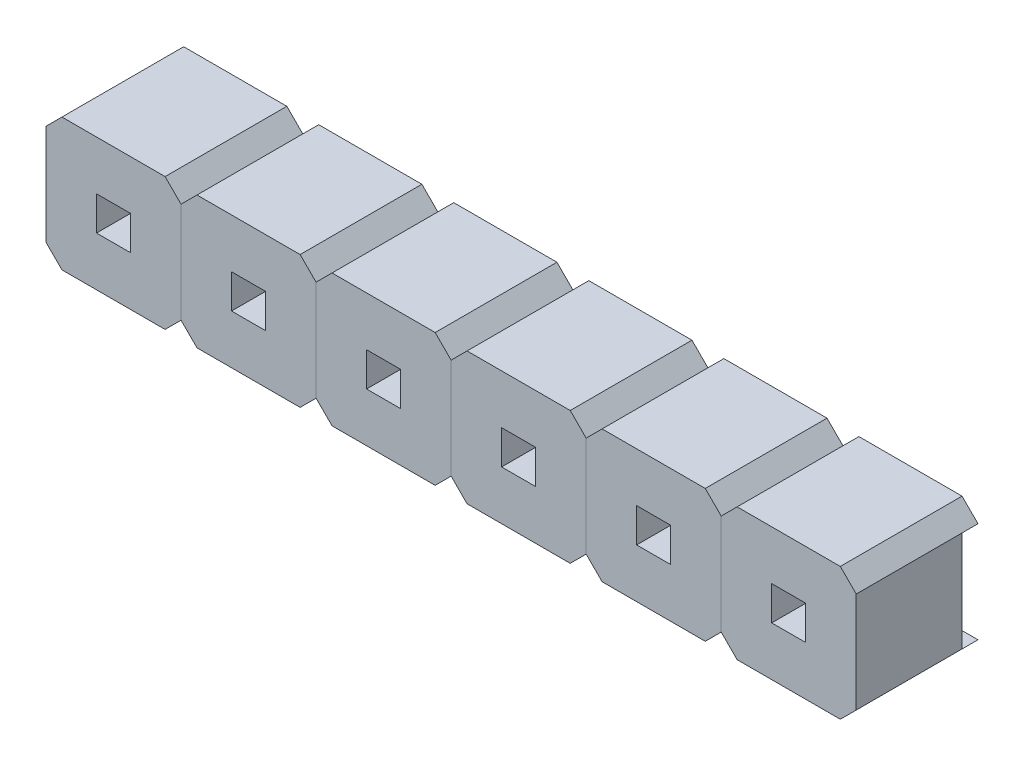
ISO-10303-21;
HEADER;
FILE_DESCRIPTION(('STEP AP214'),'2;1');
FILE_NAME('part.step','',(''),(''),'','','');
FILE_SCHEMA(('AUTOMOTIVE_DESIGN { 1 0 10303 214 1 1 1 1 }'));
ENDSEC;
DATA;
#1=APPLICATION_CONTEXT('core data for automotive mechanical design processes');
#2=APPLICATION_PROTOCOL_DEFINITION('international standard','automotive_design',2000,#1);
#3=PRODUCT_CONTEXT('',#1,'mechanical');
#4=PRODUCT('Part','Part','',(#3));
#5=PRODUCT_RELATED_PRODUCT_CATEGORY('part','',(#4));
#6=PRODUCT_DEFINITION_FORMATION('','',#4);
#7=PRODUCT_DEFINITION_CONTEXT('part definition',#1,'design');
#8=PRODUCT_DEFINITION('design','',#6,#7);
#9=PRODUCT_DEFINITION_SHAPE('','',#8);
#10=(LENGTH_UNIT() NAMED_UNIT(*) SI_UNIT(.MILLI.,.METRE.));
#11=(NAMED_UNIT(*) PLANE_ANGLE_UNIT() SI_UNIT($,.RADIAN.));
#12=(NAMED_UNIT(*) SI_UNIT($,.STERADIAN.) SOLID_ANGLE_UNIT());
#13=UNCERTAINTY_MEASURE_WITH_UNIT(LENGTH_MEASURE(1.E-05),#10,'distance_accuracy_value','');
#14=(GEOMETRIC_REPRESENTATION_CONTEXT(3) GLOBAL_UNCERTAINTY_ASSIGNED_CONTEXT((#13)) GLOBAL_UNIT_ASSIGNED_CONTEXT((#10,
#11,#12)) REPRESENTATION_CONTEXT('',''));
#15=CARTESIAN_POINT('',(0.,0.,0.));
#16=DIRECTION('',(0.,0.,1.));
#17=DIRECTION('',(1.,0.,0.));
#18=AXIS2_PLACEMENT_3D('',#15,#16,#17);
#19=CARTESIAN_POINT('',(1.269999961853,-0.944999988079,0.));
#20=DIRECTION('',(0.,1.,0.));
#21=DIRECTION('',(0.,0.,1.));
#22=AXIS2_PLACEMENT_3D('',#19,#20,#21);
#23=PLANE('',#22);
#24=DIRECTION('',(0.,0.,1.));
#25=VECTOR('',#24,1.);
#26=CARTESIAN_POINT('',(3.8099999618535,-0.9449999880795,0.));
#27=LINE('',#26,#25);
#28=CARTESIAN_POINT('',(3.80999996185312,-0.944999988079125,0.));
#29=VERTEX_POINT('',#28);
#30=CARTESIAN_POINT('',(3.80999996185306,-0.944999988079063,0.300000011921));
#31=VERTEX_POINT('',#30);
#32=EDGE_CURVE('P0_E163',#29,#31,#27,.T.);
#33=ORIENTED_EDGE('',*,*,#32,.F.);
#34=DIRECTION('',(1.,0.,0.));
#35=VECTOR('',#34,1.);
#36=CARTESIAN_POINT('',(1.269999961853,-0.944999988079,0.));
#37=LINE('',#36,#35);
#38=CARTESIAN_POINT('',(1.26999996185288,-0.944999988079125,0.));
#39=VERTEX_POINT('',#38);
#40=EDGE_CURVE('P0_E113',#29,#39,#37,.F.);
#41=ORIENTED_EDGE('',*,*,#40,.T.);
#42=DIRECTION('',(0.,0.,1.));
#43=VECTOR('',#42,1.);
#44=CARTESIAN_POINT('',(1.2699999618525,-0.9449999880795,0.));
#45=LINE('',#44,#43);
#46=CARTESIAN_POINT('',(1.26999996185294,-0.944999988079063,0.300000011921));
#47=VERTEX_POINT('',#46);
#48=EDGE_CURVE('P0_E149',#47,#39,#45,.F.);
#49=ORIENTED_EDGE('',*,*,#48,.F.);
#50=DIRECTION('',(-1.,0.,0.));
#51=VECTOR('',#50,1.);
#52=CARTESIAN_POINT('',(1.269999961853,-0.944999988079,0.300000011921));
#53=LINE('',#52,#51);
#54=EDGE_CURVE('P0_E176',#31,#47,#53,.T.);
#55=ORIENTED_EDGE('',*,*,#54,.F.);
#56=EDGE_LOOP('',(#33,#41,#49,#55));
#57=FACE_BOUND('',#56,.T.);
#58=ADVANCED_FACE('P0_F17',(#57),#23,.T.);
#59=CARTESIAN_POINT('',(3.809999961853,0.944999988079,0.));
#60=DIRECTION('',(0.,-1.,0.));
#61=DIRECTION('',(0.,0.,-1.));
#62=AXIS2_PLACEMENT_3D('',#59,#60,#61);
#63=PLANE('',#62);
#64=DIRECTION('',(0.,0.,1.));
#65=VECTOR('',#64,1.);
#66=CARTESIAN_POINT('',(1.2699999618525,0.9449999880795,0.));
#67=LINE('',#66,#65);
#68=CARTESIAN_POINT('',(1.26999996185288,0.944999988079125,0.));
#69=VERTEX_POINT('',#68);
#70=CARTESIAN_POINT('',(1.26999996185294,0.944999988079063,0.300000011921));
#71=VERTEX_POINT('',#70);
#72=EDGE_CURVE('P0_E118',#69,#71,#67,.T.);
#73=ORIENTED_EDGE('',*,*,#72,.F.);
#74=DIRECTION('',(1.,0.,0.));
#75=VECTOR('',#74,1.);
#76=CARTESIAN_POINT('',(1.269999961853,0.944999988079,0.));
#77=LINE('',#76,#75);
#78=CARTESIAN_POINT('',(3.80999996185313,0.944999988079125,0.));
#79=VERTEX_POINT('',#78);
#80=EDGE_CURVE('P0_E121',#69,#79,#77,.T.);
#81=ORIENTED_EDGE('',*,*,#80,.T.);
#82=DIRECTION('',(0.,0.,1.));
#83=VECTOR('',#82,1.);
#84=CARTESIAN_POINT('',(3.8099999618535,0.9449999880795,0.));
#85=LINE('',#84,#83);
#86=CARTESIAN_POINT('',(3.80999996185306,0.944999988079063,0.300000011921));
#87=VERTEX_POINT('',#86);
#88=EDGE_CURVE('P0_E158',#87,#79,#85,.F.);
#89=ORIENTED_EDGE('',*,*,#88,.F.);
#90=DIRECTION('',(-1.,0.,0.));
#91=VECTOR('',#90,1.);
#92=CARTESIAN_POINT('',(1.269999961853,0.944999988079,0.300000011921));
#93=LINE('',#92,#91);
#94=EDGE_CURVE('P0_E124',#71,#87,#93,.F.);
#95=ORIENTED_EDGE('',*,*,#94,.F.);
#96=EDGE_LOOP('',(#73,#81,#89,#95));
#97=FACE_BOUND('',#96,.T.);
#98=ADVANCED_FACE('P0_F120',(#97),#63,.T.);
#99=CARTESIAN_POINT('',(2.219999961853,0.32,2.289999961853));
#100=DIRECTION('',(0.,-1.,0.));
#101=DIRECTION('',(0.,0.,-1.));
#102=AXIS2_PLACEMENT_3D('',#99,#100,#101);
#103=PLANE('',#102);
#104=DIRECTION('',(0.,0.,1.));
#105=VECTOR('',#104,1.);
#106=CARTESIAN_POINT('',(2.859999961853,0.32,2.289999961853));
#107=LINE('',#106,#105);
#108=CARTESIAN_POINT('',(2.859999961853,0.32,2.289999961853));
#109=VERTEX_POINT('',#108);
#110=CARTESIAN_POINT('',(2.859999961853,0.32,0.300000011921));
#111=VERTEX_POINT('',#110);
#112=EDGE_CURVE('P0_E168',#109,#111,#107,.F.);
#113=ORIENTED_EDGE('',*,*,#112,.F.);
#114=DIRECTION('',(1.,0.,0.));
#115=VECTOR('',#114,1.);
#116=CARTESIAN_POINT('',(2.219999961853,0.32,2.289999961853));
#117=LINE('',#116,#115);
#118=CARTESIAN_POINT('',(2.219999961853,0.32,2.289999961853));
#119=VERTEX_POINT('',#118);
#120=EDGE_CURVE('P0_E20',#109,#119,#117,.F.);
#121=ORIENTED_EDGE('',*,*,#120,.T.);
#122=DIRECTION('',(0.,0.,-1.));
#123=VECTOR('',#122,1.);
#124=CARTESIAN_POINT('',(2.219999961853,0.32,2.289999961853));
#125=LINE('',#124,#123);
#126=CARTESIAN_POINT('',(2.219999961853,0.32,0.300000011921));
#127=VERTEX_POINT('',#126);
#128=EDGE_CURVE('P0_E183',#127,#119,#125,.F.);
#129=ORIENTED_EDGE('',*,*,#128,.F.);
#130=DIRECTION('',(-1.,0.,0.));
#131=VECTOR('',#130,1.);
#132=CARTESIAN_POINT('',(1.269999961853,0.32,0.300000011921));
#133=LINE('',#132,#131);
#134=EDGE_CURVE('P0_E174',#111,#127,#133,.T.);
#135=ORIENTED_EDGE('',*,*,#134,.F.);
#136=EDGE_LOOP('',(#113,#121,#129,#135));
#137=FACE_BOUND('',#136,.T.);
#138=ADVANCED_FACE('P0_F280',(#137),#103,.T.);
#139=CARTESIAN_POINT('',(1.269999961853,1.245,0.));
#140=DIRECTION('',(0.,0.,1.));
#141=DIRECTION('',(1.,0.,0.));
#142=AXIS2_PLACEMENT_3D('',#139,#140,#141);
#143=PLANE('',#142);
#144=ORIENTED_EDGE('',*,*,#80,.F.);
#145=DIRECTION('',(-0.707106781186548,-0.707106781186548,0.));
#146=VECTOR('',#145,1.);
#147=CARTESIAN_POINT('',(1.419999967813,1.09499999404,0.));
#148=LINE('',#147,#146);
#149=CARTESIAN_POINT('',(1.56999997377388,1.24500000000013,0.));
#150=VERTEX_POINT('',#149);
#151=EDGE_CURVE('P0_E134',#150,#69,#148,.T.);
#152=ORIENTED_EDGE('',*,*,#151,.F.);
#153=DIRECTION('',(1.,0.,0.));
#154=VECTOR('',#153,1.);
#155=CARTESIAN_POINT('',(1.269999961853,1.245,0.));
#156=LINE('',#155,#154);
#157=CARTESIAN_POINT('',(3.50999994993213,1.24500000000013,0.));
#158=VERTEX_POINT('',#157);
#159=EDGE_CURVE('P0_E188',#158,#150,#156,.F.);
#160=ORIENTED_EDGE('',*,*,#159,.F.);
#161=DIRECTION('',(-0.707106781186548,0.707106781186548,0.));
#162=VECTOR('',#161,1.);
#163=CARTESIAN_POINT('',(3.659999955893,1.09499999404,0.));
#164=LINE('',#163,#162);
#165=EDGE_CURVE('P0_E137',#79,#158,#164,.T.);
#166=ORIENTED_EDGE('',*,*,#165,.F.);
#167=EDGE_LOOP('',(#144,#152,#160,#166));
#168=FACE_BOUND('',#167,.T.);
#169=ADVANCED_FACE('P0_F133',(#168),#143,.F.);
#170=CARTESIAN_POINT('',(1.419999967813,1.09499999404,0.));
#171=DIRECTION('',(-0.707106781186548,0.707106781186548,0.));
#172=DIRECTION('',(-0.707106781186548,-0.707106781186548,0.));
#173=AXIS2_PLACEMENT_3D('',#170,#171,#172);
#174=PLANE('',#173);
#175=DIRECTION('',(0.,0.,1.));
#176=VECTOR('',#175,1.);
#177=CARTESIAN_POINT('',(1.569999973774,1.245,0.));
#178=LINE('',#177,#176);
#179=CARTESIAN_POINT('',(1.56999997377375,1.24500000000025,2.289999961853));
#180=VERTEX_POINT('',#179);
#181=EDGE_CURVE('P0_E141',#150,#180,#178,.T.);
#182=ORIENTED_EDGE('',*,*,#181,.F.);
#183=ORIENTED_EDGE('',*,*,#151,.T.);
#184=ORIENTED_EDGE('',*,*,#72,.T.);
#185=DIRECTION('',(0.,0.,1.));
#186=VECTOR('',#185,1.);
#187=CARTESIAN_POINT('',(1.269999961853,0.944999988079,0.));
#188=LINE('',#187,#186);
#189=CARTESIAN_POINT('',(1.26999996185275,0.94499998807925,2.289999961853));
#190=VERTEX_POINT('',#189);
#191=EDGE_CURVE('P0_E200',#190,#71,#188,.F.);
#192=ORIENTED_EDGE('',*,*,#191,.F.);
#193=DIRECTION('',(-0.707106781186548,-0.707106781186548,0.));
#194=VECTOR('',#193,1.);
#195=CARTESIAN_POINT('',(1.419999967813,1.09499999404,2.289999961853));
#196=LINE('',#195,#194);
#197=EDGE_CURVE('P0_E130',#190,#180,#196,.F.);
#198=ORIENTED_EDGE('',*,*,#197,.T.);
#199=EDGE_LOOP('',(#182,#183,#184,#192,#198));
#200=FACE_BOUND('',#199,.T.);
#201=ADVANCED_FACE('P0_F139',(#200),#174,.T.);
#202=CARTESIAN_POINT('',(1.269999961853,1.245,0.));
#203=DIRECTION('',(0.,0.,1.));
#204=DIRECTION('',(1.,0.,0.));
#205=AXIS2_PLACEMENT_3D('',#202,#203,#204);
#206=PLANE('',#205);
#207=DIRECTION('',(1.,0.,0.));
#208=VECTOR('',#207,1.);
#209=CARTESIAN_POINT('',(3.809999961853,-1.245,0.));
#210=LINE('',#209,#208);
#211=CARTESIAN_POINT('',(1.56999997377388,-1.24500000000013,0.));
#212=VERTEX_POINT('',#211);
#213=CARTESIAN_POINT('',(3.50999994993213,-1.24500000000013,0.));
#214=VERTEX_POINT('',#213);
#215=EDGE_CURVE('P0_E202',#212,#214,#210,.T.);
#216=ORIENTED_EDGE('',*,*,#215,.F.);
#217=DIRECTION('',(0.707106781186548,-0.707106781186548,0.));
#218=VECTOR('',#217,1.);
#219=CARTESIAN_POINT('',(1.419999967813,-1.09499999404,0.));
#220=LINE('',#219,#218);
#221=EDGE_CURVE('P0_E152',#39,#212,#220,.T.);
#222=ORIENTED_EDGE('',*,*,#221,.F.);
#223=ORIENTED_EDGE('',*,*,#40,.F.);
#224=DIRECTION('',(0.707106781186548,0.707106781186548,0.));
#225=VECTOR('',#224,1.);
#226=CARTESIAN_POINT('',(3.659999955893,-1.09499999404,0.));
#227=LINE('',#226,#225);
#228=EDGE_CURVE('P0_E160',#214,#29,#227,.T.);
#229=ORIENTED_EDGE('',*,*,#228,.F.);
#230=EDGE_LOOP('',(#216,#222,#223,#229));
#231=FACE_BOUND('',#230,.T.);
#232=ADVANCED_FACE('P0_F312',(#231),#206,.F.);
#233=CARTESIAN_POINT('',(1.419999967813,-1.09499999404,0.));
#234=DIRECTION('',(-0.707106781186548,-0.707106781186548,0.));
#235=DIRECTION('',(0.707106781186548,-0.707106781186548,0.));
#236=AXIS2_PLACEMENT_3D('',#233,#234,#235);
#237=PLANE('',#236);
#238=ORIENTED_EDGE('',*,*,#48,.T.);
#239=ORIENTED_EDGE('',*,*,#221,.T.);
#240=DIRECTION('',(0.,0.,-1.));
#241=VECTOR('',#240,1.);
#242=CARTESIAN_POINT('',(1.569999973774,-1.245,0.));
#243=LINE('',#242,#241);
#244=CARTESIAN_POINT('',(1.56999997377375,-1.24500000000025,2.289999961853));
#245=VERTEX_POINT('',#244);
#246=EDGE_CURVE('P0_E208',#245,#212,#243,.T.);
#247=ORIENTED_EDGE('',*,*,#246,.F.);
#248=DIRECTION('',(0.707106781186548,-0.707106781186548,0.));
#249=VECTOR('',#248,1.);
#250=CARTESIAN_POINT('',(1.419999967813,-1.09499999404,2.289999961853));
#251=LINE('',#250,#249);
#252=CARTESIAN_POINT('',(1.26999996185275,-0.94499998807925,2.289999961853));
#253=VERTEX_POINT('',#252);
#254=EDGE_CURVE('P0_E144',#245,#253,#251,.F.);
#255=ORIENTED_EDGE('',*,*,#254,.T.);
#256=DIRECTION('',(0.,0.,1.));
#257=VECTOR('',#256,1.);
#258=CARTESIAN_POINT('',(1.269999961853,-0.944999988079,0.));
#259=LINE('',#258,#257);
#260=EDGE_CURVE('P0_E197',#47,#253,#259,.T.);
#261=ORIENTED_EDGE('',*,*,#260,.F.);
#262=EDGE_LOOP('',(#238,#239,#247,#255,#261));
#263=FACE_BOUND('',#262,.T.);
#264=ADVANCED_FACE('P0_F258',(#263),#237,.T.);
#265=CARTESIAN_POINT('',(3.659999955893,1.09499999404,0.));
#266=DIRECTION('',(0.707106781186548,0.707106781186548,0.));
#267=DIRECTION('',(-0.707106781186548,0.707106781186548,0.));
#268=AXIS2_PLACEMENT_3D('',#265,#266,#267);
#269=PLANE('',#268);
#270=DIRECTION('',(0.,0.,-1.));
#271=VECTOR('',#270,1.);
#272=CARTESIAN_POINT('',(3.809999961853,0.944999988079,0.));
#273=LINE('',#272,#271);
#274=CARTESIAN_POINT('',(3.80999996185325,0.94499998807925,2.289999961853));
#275=VERTEX_POINT('',#274);
#276=EDGE_CURVE('P0_E214',#87,#275,#273,.F.);
#277=ORIENTED_EDGE('',*,*,#276,.F.);
#278=ORIENTED_EDGE('',*,*,#88,.T.);
#279=ORIENTED_EDGE('',*,*,#165,.T.);
#280=DIRECTION('',(0.,0.,1.));
#281=VECTOR('',#280,1.);
#282=CARTESIAN_POINT('',(3.509999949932,1.245,0.));
#283=LINE('',#282,#281);
#284=CARTESIAN_POINT('',(3.50999994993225,1.24500000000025,2.289999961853));
#285=VERTEX_POINT('',#284);
#286=EDGE_CURVE('P0_E191',#285,#158,#283,.F.);
#287=ORIENTED_EDGE('',*,*,#286,.F.);
#288=DIRECTION('',(-0.707106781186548,0.707106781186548,0.));
#289=VECTOR('',#288,1.);
#290=CARTESIAN_POINT('',(3.659999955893,1.09499999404,2.289999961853));
#291=LINE('',#290,#289);
#292=EDGE_CURVE('P0_E156',#285,#275,#291,.F.);
#293=ORIENTED_EDGE('',*,*,#292,.T.);
#294=EDGE_LOOP('',(#277,#278,#279,#287,#293));
#295=FACE_BOUND('',#294,.T.);
#296=ADVANCED_FACE('P0_F249',(#295),#269,.T.);
#297=CARTESIAN_POINT('',(3.659999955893,-1.09499999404,0.));
#298=DIRECTION('',(0.707106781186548,-0.707106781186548,0.));
#299=DIRECTION('',(0.707106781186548,0.707106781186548,0.));
#300=AXIS2_PLACEMENT_3D('',#297,#298,#299);
#301=PLANE('',#300);
#302=DIRECTION('',(0.707106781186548,0.707106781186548,0.));
#303=VECTOR('',#302,1.);
#304=CARTESIAN_POINT('',(3.659999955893,-1.09499999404,2.289999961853));
#305=LINE('',#304,#303);
#306=CARTESIAN_POINT('',(3.80999996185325,-0.94499998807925,2.289999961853));
#307=VERTEX_POINT('',#306);
#308=CARTESIAN_POINT('',(3.50999994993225,-1.24500000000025,2.289999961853));
#309=VERTEX_POINT('',#308);
#310=EDGE_CURVE('P0_E166',#307,#309,#305,.F.);
#311=ORIENTED_EDGE('',*,*,#310,.T.);
#312=DIRECTION('',(0.,0.,-1.));
#313=VECTOR('',#312,1.);
#314=CARTESIAN_POINT('',(3.509999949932,-1.245,0.));
#315=LINE('',#314,#313);
#316=EDGE_CURVE('P0_E205',#214,#309,#315,.F.);
#317=ORIENTED_EDGE('',*,*,#316,.F.);
#318=ORIENTED_EDGE('',*,*,#228,.T.);
#319=ORIENTED_EDGE('',*,*,#32,.T.);
#320=DIRECTION('',(0.,0.,-1.));
#321=VECTOR('',#320,1.);
#322=CARTESIAN_POINT('',(3.809999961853,-0.944999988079,0.));
#323=LINE('',#322,#321);
#324=EDGE_CURVE('P0_E217',#307,#31,#323,.T.);
#325=ORIENTED_EDGE('',*,*,#324,.F.);
#326=EDGE_LOOP('',(#311,#317,#318,#319,#325));
#327=FACE_BOUND('',#326,.T.);
#328=ADVANCED_FACE('P0_F265',(#327),#301,.T.);
#329=CARTESIAN_POINT('',(2.859999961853,0.32,2.289999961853));
#330=DIRECTION('',(-1.,0.,0.));
#331=DIRECTION('',(0.,0.,1.));
#332=AXIS2_PLACEMENT_3D('',#329,#330,#331);
#333=PLANE('',#332);
#334=DIRECTION('',(0.,0.,1.));
#335=VECTOR('',#334,1.);
#336=CARTESIAN_POINT('',(2.859999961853,-0.32,2.289999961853));
#337=LINE('',#336,#335);
#338=CARTESIAN_POINT('',(2.859999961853,-0.32,2.289999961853));
#339=VERTEX_POINT('',#338);
#340=CARTESIAN_POINT('',(2.859999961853,-0.32,0.300000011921));
#341=VERTEX_POINT('',#340);
#342=EDGE_CURVE('P0_E220',#339,#341,#337,.F.);
#343=ORIENTED_EDGE('',*,*,#342,.F.);
#344=DIRECTION('',(0.,1.,0.));
#345=VECTOR('',#344,1.);
#346=CARTESIAN_POINT('',(2.859999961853,0.32,2.289999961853));
#347=LINE('',#346,#345);
#348=EDGE_CURVE('P0_E34',#339,#109,#347,.T.);
#349=ORIENTED_EDGE('',*,*,#348,.T.);
#350=ORIENTED_EDGE('',*,*,#112,.T.);
#351=DIRECTION('',(0.,1.,0.));
#352=VECTOR('',#351,1.);
#353=CARTESIAN_POINT('',(2.859999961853,-0.944999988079,0.300000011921));
#354=LINE('',#353,#352);
#355=EDGE_CURVE('P0_E171',#341,#111,#354,.T.);
#356=ORIENTED_EDGE('',*,*,#355,.F.);
#357=EDGE_LOOP('',(#343,#349,#350,#356));
#358=FACE_BOUND('',#357,.T.);
#359=ADVANCED_FACE('P0_F271',(#358),#333,.T.);
#360=CARTESIAN_POINT('',(1.269999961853,-0.944999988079,0.300000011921));
#361=DIRECTION('',(0.,0.,-1.));
#362=DIRECTION('',(-1.,0.,0.));
#363=AXIS2_PLACEMENT_3D('',#360,#361,#362);
#364=PLANE('',#363);
#365=ORIENTED_EDGE('',*,*,#94,.T.);
#366=DIRECTION('',(0.,1.,0.));
#367=VECTOR('',#366,1.);
#368=CARTESIAN_POINT('',(3.809999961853,1.245,0.300000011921));
#369=LINE('',#368,#367);
#370=EDGE_CURVE('P0_E211',#31,#87,#369,.T.);
#371=ORIENTED_EDGE('',*,*,#370,.F.);
#372=ORIENTED_EDGE('',*,*,#54,.T.);
#373=DIRECTION('',(0.,1.,0.));
#374=VECTOR('',#373,1.);
#375=CARTESIAN_POINT('',(1.269999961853,-1.245,0.300000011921));
#376=LINE('',#375,#374);
#377=EDGE_CURVE('P0_E194',#71,#47,#376,.F.);
#378=ORIENTED_EDGE('',*,*,#377,.F.);
#379=EDGE_LOOP('',(#365,#371,#372,#378));
#380=FACE_BOUND('',#379,.T.);
#381=ORIENTED_EDGE('',*,*,#355,.T.);
#382=ORIENTED_EDGE('',*,*,#134,.T.);
#383=DIRECTION('',(0.,1.,0.));
#384=VECTOR('',#383,1.);
#385=CARTESIAN_POINT('',(2.219999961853,-0.32,0.300000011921));
#386=LINE('',#385,#384);
#387=CARTESIAN_POINT('',(2.219999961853,-0.32,0.300000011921));
#388=VERTEX_POINT('',#387);
#389=EDGE_CURVE('P0_E180',#388,#127,#386,.T.);
#390=ORIENTED_EDGE('',*,*,#389,.F.);
#391=DIRECTION('',(1.,0.,0.));
#392=VECTOR('',#391,1.);
#393=CARTESIAN_POINT('',(2.859999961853,-0.32,0.300000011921));
#394=LINE('',#393,#392);
#395=EDGE_CURVE('P0_E223',#341,#388,#394,.F.);
#396=ORIENTED_EDGE('',*,*,#395,.F.);
#397=EDGE_LOOP('',(#381,#382,#390,#396));
#398=FACE_BOUND('',#397,.T.);
#399=ADVANCED_FACE('P0_F267',(#380,#398),#364,.T.);
#400=CARTESIAN_POINT('',(2.219999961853,-0.32,2.289999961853));
#401=DIRECTION('',(1.,0.,0.));
#402=DIRECTION('',(0.,0.,-1.));
#403=AXIS2_PLACEMENT_3D('',#400,#401,#402);
#404=PLANE('',#403);
#405=ORIENTED_EDGE('',*,*,#128,.T.);
#406=DIRECTION('',(0.,1.,0.));
#407=VECTOR('',#406,1.);
#408=CARTESIAN_POINT('',(2.219999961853,-0.32,2.289999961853));
#409=LINE('',#408,#407);
#410=CARTESIAN_POINT('',(2.219999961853,-0.32,2.289999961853));
#411=VERTEX_POINT('',#410);
#412=EDGE_CURVE('P0_E186',#119,#411,#409,.F.);
#413=ORIENTED_EDGE('',*,*,#412,.T.);
#414=DIRECTION('',(0.,0.,1.));
#415=VECTOR('',#414,1.);
#416=CARTESIAN_POINT('',(2.219999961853,-0.32,2.289999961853));
#417=LINE('',#416,#415);
#418=EDGE_CURVE('P0_E226',#388,#411,#417,.T.);
#419=ORIENTED_EDGE('',*,*,#418,.F.);
#420=ORIENTED_EDGE('',*,*,#389,.T.);
#421=EDGE_LOOP('',(#405,#413,#419,#420));
#422=FACE_BOUND('',#421,.T.);
#423=ADVANCED_FACE('P0_F270',(#422),#404,.T.);
#424=CARTESIAN_POINT('',(1.269999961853,1.245,0.));
#425=DIRECTION('',(0.,1.,0.));
#426=DIRECTION('',(0.,0.,1.));
#427=AXIS2_PLACEMENT_3D('',#424,#425,#426);
#428=PLANE('',#427);
#429=DIRECTION('',(1.,0.,0.));
#430=VECTOR('',#429,1.);
#431=CARTESIAN_POINT('',(1.269999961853,1.245,2.289999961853));
#432=LINE('',#431,#430);
#433=EDGE_CURVE('P0_E229',#285,#180,#432,.F.);
#434=ORIENTED_EDGE('',*,*,#433,.F.);
#435=ORIENTED_EDGE('',*,*,#286,.T.);
#436=ORIENTED_EDGE('',*,*,#159,.T.);
#437=ORIENTED_EDGE('',*,*,#181,.T.);
#438=EDGE_LOOP('',(#434,#435,#436,#437));
#439=FACE_BOUND('',#438,.T.);
#440=ADVANCED_FACE('P0_F252',(#439),#428,.T.);
#441=CARTESIAN_POINT('',(1.269999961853,-1.245,0.));
#442=DIRECTION('',(-1.,0.,0.));
#443=DIRECTION('',(0.,0.,1.));
#444=AXIS2_PLACEMENT_3D('',#441,#442,#443);
#445=PLANE('',#444);
#446=DIRECTION('',(0.,1.,0.));
#447=VECTOR('',#446,1.);
#448=CARTESIAN_POINT('',(1.269999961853,1.245,2.289999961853));
#449=LINE('',#448,#447);
#450=EDGE_CURVE('P0_E232',#190,#253,#449,.F.);
#451=ORIENTED_EDGE('',*,*,#450,.F.);
#452=ORIENTED_EDGE('',*,*,#191,.T.);
#453=ORIENTED_EDGE('',*,*,#377,.T.);
#454=ORIENTED_EDGE('',*,*,#260,.T.);
#455=EDGE_LOOP('',(#451,#452,#453,#454));
#456=FACE_BOUND('',#455,.T.);
#457=ADVANCED_FACE('P0_F255',(#456),#445,.T.);
#458=CARTESIAN_POINT('',(3.809999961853,-1.245,0.));
#459=DIRECTION('',(0.,-1.,0.));
#460=DIRECTION('',(0.,0.,-1.));
#461=AXIS2_PLACEMENT_3D('',#458,#459,#460);
#462=PLANE('',#461);
#463=DIRECTION('',(1.,0.,0.));
#464=VECTOR('',#463,1.);
#465=CARTESIAN_POINT('',(1.269999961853,-1.245,2.289999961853));
#466=LINE('',#465,#464);
#467=EDGE_CURVE('P0_E235',#245,#309,#466,.T.);
#468=ORIENTED_EDGE('',*,*,#467,.F.);
#469=ORIENTED_EDGE('',*,*,#246,.T.);
#470=ORIENTED_EDGE('',*,*,#215,.T.);
#471=ORIENTED_EDGE('',*,*,#316,.T.);
#472=EDGE_LOOP('',(#468,#469,#470,#471));
#473=FACE_BOUND('',#472,.T.);
#474=ADVANCED_FACE('P0_F262',(#473),#462,.T.);
#475=CARTESIAN_POINT('',(3.809999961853,1.245,0.));
#476=DIRECTION('',(1.,0.,0.));
#477=DIRECTION('',(0.,0.,-1.));
#478=AXIS2_PLACEMENT_3D('',#475,#476,#477);
#479=PLANE('',#478);
#480=DIRECTION('',(0.,1.,0.));
#481=VECTOR('',#480,1.);
#482=CARTESIAN_POINT('',(3.809999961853,1.245,2.289999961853));
#483=LINE('',#482,#481);
#484=EDGE_CURVE('P0_E26',#307,#275,#483,.T.);
#485=ORIENTED_EDGE('',*,*,#484,.F.);
#486=ORIENTED_EDGE('',*,*,#324,.T.);
#487=ORIENTED_EDGE('',*,*,#370,.T.);
#488=ORIENTED_EDGE('',*,*,#276,.T.);
#489=EDGE_LOOP('',(#485,#486,#487,#488));
#490=FACE_BOUND('',#489,.T.);
#491=ADVANCED_FACE('P0_F245',(#490),#479,.T.);
#492=CARTESIAN_POINT('',(2.859999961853,-0.32,2.289999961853));
#493=DIRECTION('',(0.,1.,0.));
#494=DIRECTION('',(0.,0.,1.));
#495=AXIS2_PLACEMENT_3D('',#492,#493,#494);
#496=PLANE('',#495);
#497=ORIENTED_EDGE('',*,*,#418,.T.);
#498=DIRECTION('',(1.,0.,0.));
#499=VECTOR('',#498,1.);
#500=CARTESIAN_POINT('',(1.269999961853,-0.32,2.289999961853));
#501=LINE('',#500,#499);
#502=EDGE_CURVE('P0_E11',#339,#411,#501,.F.);
#503=ORIENTED_EDGE('',*,*,#502,.F.);
#504=ORIENTED_EDGE('',*,*,#342,.T.);
#505=ORIENTED_EDGE('',*,*,#395,.T.);
#506=EDGE_LOOP('',(#497,#503,#504,#505));
#507=FACE_BOUND('',#506,.T.);
#508=ADVANCED_FACE('P0_F285',(#507),#496,.T.);
#509=CARTESIAN_POINT('',(1.269999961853,1.245,2.289999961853));
#510=DIRECTION('',(0.,0.,1.));
#511=DIRECTION('',(1.,0.,0.));
#512=AXIS2_PLACEMENT_3D('',#509,#510,#511);
#513=PLANE('',#512);
#514=ORIENTED_EDGE('',*,*,#348,.F.);
#515=ORIENTED_EDGE('',*,*,#502,.T.);
#516=ORIENTED_EDGE('',*,*,#412,.F.);
#517=ORIENTED_EDGE('',*,*,#120,.F.);
#518=EDGE_LOOP('',(#514,#515,#516,#517));
#519=FACE_BOUND('',#518,.T.);
#520=ORIENTED_EDGE('',*,*,#484,.T.);
#521=ORIENTED_EDGE('',*,*,#292,.F.);
#522=ORIENTED_EDGE('',*,*,#433,.T.);
#523=ORIENTED_EDGE('',*,*,#197,.F.);
#524=ORIENTED_EDGE('',*,*,#450,.T.);
#525=ORIENTED_EDGE('',*,*,#254,.F.);
#526=ORIENTED_EDGE('',*,*,#467,.T.);
#527=ORIENTED_EDGE('',*,*,#310,.F.);
#528=EDGE_LOOP('',(#520,#521,#522,#523,#524,#525,#526,#527));
#529=FACE_BOUND('',#528,.T.);
#530=ADVANCED_FACE('P0_F241',(#519,#529),#513,.T.);
#531=CLOSED_SHELL('',(#58,#98,#138,#169,#201,#232,#264,#296,#328,#359,#399,#423,#440,#457,#474,
#491,#508,#530));
#532=MANIFOLD_SOLID_BREP('P0_B1',#531);
#533=CARTESIAN_POINT('',(3.809999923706,-0.944999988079,0.));
#534=DIRECTION('',(0.,1.,0.));
#535=DIRECTION('',(0.,0.,1.));
#536=AXIS2_PLACEMENT_3D('',#533,#534,#535);
#537=PLANE('',#536);
#538=DIRECTION('',(0.,0.,1.));
#539=VECTOR('',#538,1.);
#540=CARTESIAN_POINT('',(6.3499999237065,-0.9449999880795,0.));
#541=LINE('',#540,#539);
#542=CARTESIAN_POINT('',(6.34999992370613,-0.944999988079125,0.));
#543=VERTEX_POINT('',#542);
#544=CARTESIAN_POINT('',(6.34999992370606,-0.944999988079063,0.300000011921));
#545=VERTEX_POINT('',#544);
#546=EDGE_CURVE('P1_E163',#543,#545,#541,.T.);
#547=ORIENTED_EDGE('',*,*,#546,.F.);
#548=DIRECTION('',(1.,0.,0.));
#549=VECTOR('',#548,1.);
#550=CARTESIAN_POINT('',(3.809999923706,-0.944999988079,0.));
#551=LINE('',#550,#549);
#552=CARTESIAN_POINT('',(3.809999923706,-0.944999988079,0.));
#553=VERTEX_POINT('',#552);
#554=EDGE_CURVE('P1_E113',#543,#553,#551,.F.);
#555=ORIENTED_EDGE('',*,*,#554,.T.);
#556=DIRECTION('',(0.,0.,1.));
#557=VECTOR('',#556,1.);
#558=CARTESIAN_POINT('',(3.809999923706,-0.944999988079,0.));
#559=LINE('',#558,#557);
#560=CARTESIAN_POINT('',(3.809999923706,-0.944999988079,0.300000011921));
#561=VERTEX_POINT('',#560);
#562=EDGE_CURVE('P1_E149',#561,#553,#559,.F.);
#563=ORIENTED_EDGE('',*,*,#562,.F.);
#564=DIRECTION('',(-1.,0.,0.));
#565=VECTOR('',#564,1.);
#566=CARTESIAN_POINT('',(3.809999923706,-0.944999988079,0.300000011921));
#567=LINE('',#566,#565);
#568=EDGE_CURVE('P1_E176',#545,#561,#567,.T.);
#569=ORIENTED_EDGE('',*,*,#568,.F.);
#570=EDGE_LOOP('',(#547,#555,#563,#569));
#571=FACE_BOUND('',#570,.T.);
#572=ADVANCED_FACE('P1_F17',(#571),#537,.T.);
#573=CARTESIAN_POINT('',(6.349999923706,0.944999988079,0.));
#574=DIRECTION('',(0.,-1.,0.));
#575=DIRECTION('',(0.,0.,-1.));
#576=AXIS2_PLACEMENT_3D('',#573,#574,#575);
#577=PLANE('',#576);
#578=DIRECTION('',(0.,0.,1.));
#579=VECTOR('',#578,1.);
#580=CARTESIAN_POINT('',(3.809999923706,0.944999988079,0.));
#581=LINE('',#580,#579);
#582=CARTESIAN_POINT('',(3.809999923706,0.944999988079,0.));
#583=VERTEX_POINT('',#582);
#584=CARTESIAN_POINT('',(3.809999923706,0.944999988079,0.300000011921));
#585=VERTEX_POINT('',#584);
#586=EDGE_CURVE('P1_E118',#583,#585,#581,.T.);
#587=ORIENTED_EDGE('',*,*,#586,.F.);
#588=DIRECTION('',(1.,0.,0.));
#589=VECTOR('',#588,1.);
#590=CARTESIAN_POINT('',(3.809999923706,0.944999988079,0.));
#591=LINE('',#590,#589);
#592=CARTESIAN_POINT('',(6.34999992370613,0.944999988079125,0.));
#593=VERTEX_POINT('',#592);
#594=EDGE_CURVE('P1_E121',#583,#593,#591,.T.);
#595=ORIENTED_EDGE('',*,*,#594,.T.);
#596=DIRECTION('',(0.,0.,1.));
#597=VECTOR('',#596,1.);
#598=CARTESIAN_POINT('',(6.3499999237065,0.9449999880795,0.));
#599=LINE('',#598,#597);
#600=CARTESIAN_POINT('',(6.34999992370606,0.944999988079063,0.300000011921));
#601=VERTEX_POINT('',#600);
#602=EDGE_CURVE('P1_E158',#601,#593,#599,.F.);
#603=ORIENTED_EDGE('',*,*,#602,.F.);
#604=DIRECTION('',(-1.,0.,0.));
#605=VECTOR('',#604,1.);
#606=CARTESIAN_POINT('',(3.809999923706,0.944999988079,0.300000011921));
#607=LINE('',#606,#605);
#608=EDGE_CURVE('P1_E124',#585,#601,#607,.F.);
#609=ORIENTED_EDGE('',*,*,#608,.F.);
#610=EDGE_LOOP('',(#587,#595,#603,#609));
#611=FACE_BOUND('',#610,.T.);
#612=ADVANCED_FACE('P1_F120',(#611),#577,.T.);
#613=CARTESIAN_POINT('',(4.759999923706,0.32,2.289999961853));
#614=DIRECTION('',(0.,-1.,0.));
#615=DIRECTION('',(0.,0.,-1.));
#616=AXIS2_PLACEMENT_3D('',#613,#614,#615);
#617=PLANE('',#616);
#618=DIRECTION('',(0.,0.,1.));
#619=VECTOR('',#618,1.);
#620=CARTESIAN_POINT('',(5.399999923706,0.32,2.289999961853));
#621=LINE('',#620,#619);
#622=CARTESIAN_POINT('',(5.399999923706,0.32,2.289999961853));
#623=VERTEX_POINT('',#622);
#624=CARTESIAN_POINT('',(5.399999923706,0.32,0.300000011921));
#625=VERTEX_POINT('',#624);
#626=EDGE_CURVE('P1_E168',#623,#625,#621,.F.);
#627=ORIENTED_EDGE('',*,*,#626,.F.);
#628=DIRECTION('',(1.,0.,0.));
#629=VECTOR('',#628,1.);
#630=CARTESIAN_POINT('',(4.759999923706,0.32,2.289999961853));
#631=LINE('',#630,#629);
#632=CARTESIAN_POINT('',(4.759999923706,0.32,2.289999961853));
#633=VERTEX_POINT('',#632);
#634=EDGE_CURVE('P1_E20',#623,#633,#631,.F.);
#635=ORIENTED_EDGE('',*,*,#634,.T.);
#636=DIRECTION('',(0.,0.,-1.));
#637=VECTOR('',#636,1.);
#638=CARTESIAN_POINT('',(4.759999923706,0.32,2.289999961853));
#639=LINE('',#638,#637);
#640=CARTESIAN_POINT('',(4.759999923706,0.32,0.300000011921));
#641=VERTEX_POINT('',#640);
#642=EDGE_CURVE('P1_E183',#641,#633,#639,.F.);
#643=ORIENTED_EDGE('',*,*,#642,.F.);
#644=DIRECTION('',(-1.,0.,0.));
#645=VECTOR('',#644,1.);
#646=CARTESIAN_POINT('',(3.809999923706,0.32,0.300000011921));
#647=LINE('',#646,#645);
#648=EDGE_CURVE('P1_E174',#625,#641,#647,.T.);
#649=ORIENTED_EDGE('',*,*,#648,.F.);
#650=EDGE_LOOP('',(#627,#635,#643,#649));
#651=FACE_BOUND('',#650,.T.);
#652=ADVANCED_FACE('P1_F280',(#651),#617,.T.);
#653=CARTESIAN_POINT('',(3.809999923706,1.245,0.));
#654=DIRECTION('',(0.,0.,1.));
#655=DIRECTION('',(1.,0.,0.));
#656=AXIS2_PLACEMENT_3D('',#653,#654,#655);
#657=PLANE('',#656);
#658=ORIENTED_EDGE('',*,*,#594,.F.);
#659=DIRECTION('',(-0.707106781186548,-0.707106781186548,0.));
#660=VECTOR('',#659,1.);
#661=CARTESIAN_POINT('',(3.959999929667,1.09499999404,0.));
#662=LINE('',#661,#660);
#663=CARTESIAN_POINT('',(4.109999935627,1.245,0.));
#664=VERTEX_POINT('',#663);
#665=EDGE_CURVE('P1_E134',#664,#583,#662,.T.);
#666=ORIENTED_EDGE('',*,*,#665,.F.);
#667=DIRECTION('',(1.,0.,0.));
#668=VECTOR('',#667,1.);
#669=CARTESIAN_POINT('',(3.809999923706,1.245,0.));
#670=LINE('',#669,#668);
#671=CARTESIAN_POINT('',(6.04999991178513,1.24500000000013,0.));
#672=VERTEX_POINT('',#671);
#673=EDGE_CURVE('P1_E188',#672,#664,#670,.F.);
#674=ORIENTED_EDGE('',*,*,#673,.F.);
#675=DIRECTION('',(-0.707106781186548,0.707106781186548,0.));
#676=VECTOR('',#675,1.);
#677=CARTESIAN_POINT('',(6.199999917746,1.09499999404,0.));
#678=LINE('',#677,#676);
#679=EDGE_CURVE('P1_E137',#593,#672,#678,.T.);
#680=ORIENTED_EDGE('',*,*,#679,.F.);
#681=EDGE_LOOP('',(#658,#666,#674,#680));
#682=FACE_BOUND('',#681,.T.);
#683=ADVANCED_FACE('P1_F133',(#682),#657,.F.);
#684=CARTESIAN_POINT('',(3.959999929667,1.09499999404,0.));
#685=DIRECTION('',(-0.707106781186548,0.707106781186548,0.));
#686=DIRECTION('',(-0.707106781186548,-0.707106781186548,0.));
#687=AXIS2_PLACEMENT_3D('',#684,#685,#686);
#688=PLANE('',#687);
#689=DIRECTION('',(0.,0.,1.));
#690=VECTOR('',#689,1.);
#691=CARTESIAN_POINT('',(4.109999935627,1.245,0.));
#692=LINE('',#691,#690);
#693=CARTESIAN_POINT('',(4.109999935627,1.245,2.289999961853));
#694=VERTEX_POINT('',#693);
#695=EDGE_CURVE('P1_E141',#664,#694,#692,.T.);
#696=ORIENTED_EDGE('',*,*,#695,.F.);
#697=ORIENTED_EDGE('',*,*,#665,.T.);
#698=ORIENTED_EDGE('',*,*,#586,.T.);
#699=DIRECTION('',(0.,0.,1.));
#700=VECTOR('',#699,1.);
#701=CARTESIAN_POINT('',(3.809999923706,0.944999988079,0.));
#702=LINE('',#701,#700);
#703=CARTESIAN_POINT('',(3.809999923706,0.944999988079,2.289999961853));
#704=VERTEX_POINT('',#703);
#705=EDGE_CURVE('P1_E200',#704,#585,#702,.F.);
#706=ORIENTED_EDGE('',*,*,#705,.F.);
#707=DIRECTION('',(-0.707106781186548,-0.707106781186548,0.));
#708=VECTOR('',#707,1.);
#709=CARTESIAN_POINT('',(3.959999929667,1.09499999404,2.289999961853));
#710=LINE('',#709,#708);
#711=EDGE_CURVE('P1_E130',#704,#694,#710,.F.);
#712=ORIENTED_EDGE('',*,*,#711,.T.);
#713=EDGE_LOOP('',(#696,#697,#698,#706,#712));
#714=FACE_BOUND('',#713,.T.);
#715=ADVANCED_FACE('P1_F139',(#714),#688,.T.);
#716=CARTESIAN_POINT('',(3.809999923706,1.245,0.));
#717=DIRECTION('',(0.,0.,1.));
#718=DIRECTION('',(1.,0.,0.));
#719=AXIS2_PLACEMENT_3D('',#716,#717,#718);
#720=PLANE('',#719);
#721=DIRECTION('',(1.,0.,0.));
#722=VECTOR('',#721,1.);
#723=CARTESIAN_POINT('',(6.349999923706,-1.245,0.));
#724=LINE('',#723,#722);
#725=CARTESIAN_POINT('',(4.109999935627,-1.245,0.));
#726=VERTEX_POINT('',#725);
#727=CARTESIAN_POINT('',(6.04999991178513,-1.24500000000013,0.));
#728=VERTEX_POINT('',#727);
#729=EDGE_CURVE('P1_E202',#726,#728,#724,.T.);
#730=ORIENTED_EDGE('',*,*,#729,.F.);
#731=DIRECTION('',(0.707106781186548,-0.707106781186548,0.));
#732=VECTOR('',#731,1.);
#733=CARTESIAN_POINT('',(3.959999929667,-1.09499999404,0.));
#734=LINE('',#733,#732);
#735=EDGE_CURVE('P1_E152',#553,#726,#734,.T.);
#736=ORIENTED_EDGE('',*,*,#735,.F.);
#737=ORIENTED_EDGE('',*,*,#554,.F.);
#738=DIRECTION('',(0.707106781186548,0.707106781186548,0.));
#739=VECTOR('',#738,1.);
#740=CARTESIAN_POINT('',(6.199999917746,-1.09499999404,0.));
#741=LINE('',#740,#739);
#742=EDGE_CURVE('P1_E160',#728,#543,#741,.T.);
#743=ORIENTED_EDGE('',*,*,#742,.F.);
#744=EDGE_LOOP('',(#730,#736,#737,#743));
#745=FACE_BOUND('',#744,.T.);
#746=ADVANCED_FACE('P1_F312',(#745),#720,.F.);
#747=CARTESIAN_POINT('',(3.959999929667,-1.09499999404,0.));
#748=DIRECTION('',(-0.707106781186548,-0.707106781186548,0.));
#749=DIRECTION('',(0.707106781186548,-0.707106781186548,0.));
#750=AXIS2_PLACEMENT_3D('',#747,#748,#749);
#751=PLANE('',#750);
#752=ORIENTED_EDGE('',*,*,#562,.T.);
#753=ORIENTED_EDGE('',*,*,#735,.T.);
#754=DIRECTION('',(0.,0.,-1.));
#755=VECTOR('',#754,1.);
#756=CARTESIAN_POINT('',(4.109999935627,-1.245,0.));
#757=LINE('',#756,#755);
#758=CARTESIAN_POINT('',(4.109999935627,-1.245,2.289999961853));
#759=VERTEX_POINT('',#758);
#760=EDGE_CURVE('P1_E208',#759,#726,#757,.T.);
#761=ORIENTED_EDGE('',*,*,#760,.F.);
#762=DIRECTION('',(0.707106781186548,-0.707106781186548,0.));
#763=VECTOR('',#762,1.);
#764=CARTESIAN_POINT('',(3.959999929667,-1.09499999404,2.289999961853));
#765=LINE('',#764,#763);
#766=CARTESIAN_POINT('',(3.809999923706,-0.944999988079,2.289999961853));
#767=VERTEX_POINT('',#766);
#768=EDGE_CURVE('P1_E144',#759,#767,#765,.F.);
#769=ORIENTED_EDGE('',*,*,#768,.T.);
#770=DIRECTION('',(0.,0.,1.));
#771=VECTOR('',#770,1.);
#772=CARTESIAN_POINT('',(3.809999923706,-0.944999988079,0.));
#773=LINE('',#772,#771);
#774=EDGE_CURVE('P1_E197',#561,#767,#773,.T.);
#775=ORIENTED_EDGE('',*,*,#774,.F.);
#776=EDGE_LOOP('',(#752,#753,#761,#769,#775));
#777=FACE_BOUND('',#776,.T.);
#778=ADVANCED_FACE('P1_F258',(#777),#751,.T.);
#779=CARTESIAN_POINT('',(6.199999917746,1.09499999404,0.));
#780=DIRECTION('',(0.707106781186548,0.707106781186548,0.));
#781=DIRECTION('',(-0.707106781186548,0.707106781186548,0.));
#782=AXIS2_PLACEMENT_3D('',#779,#780,#781);
#783=PLANE('',#782);
#784=DIRECTION('',(0.,0.,-1.));
#785=VECTOR('',#784,1.);
#786=CARTESIAN_POINT('',(6.349999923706,0.944999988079,0.));
#787=LINE('',#786,#785);
#788=CARTESIAN_POINT('',(6.34999992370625,0.94499998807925,2.289999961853));
#789=VERTEX_POINT('',#788);
#790=EDGE_CURVE('P1_E214',#601,#789,#787,.F.);
#791=ORIENTED_EDGE('',*,*,#790,.F.);
#792=ORIENTED_EDGE('',*,*,#602,.T.);
#793=ORIENTED_EDGE('',*,*,#679,.T.);
#794=DIRECTION('',(0.,0.,1.));
#795=VECTOR('',#794,1.);
#796=CARTESIAN_POINT('',(6.049999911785,1.245,0.));
#797=LINE('',#796,#795);
#798=CARTESIAN_POINT('',(6.04999991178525,1.24500000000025,2.289999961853));
#799=VERTEX_POINT('',#798);
#800=EDGE_CURVE('P1_E191',#799,#672,#797,.F.);
#801=ORIENTED_EDGE('',*,*,#800,.F.);
#802=DIRECTION('',(-0.707106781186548,0.707106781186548,0.));
#803=VECTOR('',#802,1.);
#804=CARTESIAN_POINT('',(6.199999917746,1.09499999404,2.289999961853));
#805=LINE('',#804,#803);
#806=EDGE_CURVE('P1_E156',#799,#789,#805,.F.);
#807=ORIENTED_EDGE('',*,*,#806,.T.);
#808=EDGE_LOOP('',(#791,#792,#793,#801,#807));
#809=FACE_BOUND('',#808,.T.);
#810=ADVANCED_FACE('P1_F249',(#809),#783,.T.);
#811=CARTESIAN_POINT('',(6.199999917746,-1.09499999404,0.));
#812=DIRECTION('',(0.707106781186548,-0.707106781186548,0.));
#813=DIRECTION('',(0.707106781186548,0.707106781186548,0.));
#814=AXIS2_PLACEMENT_3D('',#811,#812,#813);
#815=PLANE('',#814);
#816=DIRECTION('',(0.707106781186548,0.707106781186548,0.));
#817=VECTOR('',#816,1.);
#818=CARTESIAN_POINT('',(6.199999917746,-1.09499999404,2.289999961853));
#819=LINE('',#818,#817);
#820=CARTESIAN_POINT('',(6.34999992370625,-0.94499998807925,2.289999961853));
#821=VERTEX_POINT('',#820);
#822=CARTESIAN_POINT('',(6.04999991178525,-1.24500000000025,2.289999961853));
#823=VERTEX_POINT('',#822);
#824=EDGE_CURVE('P1_E166',#821,#823,#819,.F.);
#825=ORIENTED_EDGE('',*,*,#824,.T.);
#826=DIRECTION('',(0.,0.,-1.));
#827=VECTOR('',#826,1.);
#828=CARTESIAN_POINT('',(6.049999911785,-1.245,0.));
#829=LINE('',#828,#827);
#830=EDGE_CURVE('P1_E205',#728,#823,#829,.F.);
#831=ORIENTED_EDGE('',*,*,#830,.F.);
#832=ORIENTED_EDGE('',*,*,#742,.T.);
#833=ORIENTED_EDGE('',*,*,#546,.T.);
#834=DIRECTION('',(0.,0.,-1.));
#835=VECTOR('',#834,1.);
#836=CARTESIAN_POINT('',(6.349999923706,-0.944999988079,0.));
#837=LINE('',#836,#835);
#838=EDGE_CURVE('P1_E217',#821,#545,#837,.T.);
#839=ORIENTED_EDGE('',*,*,#838,.F.);
#840=EDGE_LOOP('',(#825,#831,#832,#833,#839));
#841=FACE_BOUND('',#840,.T.);
#842=ADVANCED_FACE('P1_F265',(#841),#815,.T.);
#843=CARTESIAN_POINT('',(5.399999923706,0.32,2.289999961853));
#844=DIRECTION('',(-1.,0.,0.));
#845=DIRECTION('',(0.,0.,1.));
#846=AXIS2_PLACEMENT_3D('',#843,#844,#845);
#847=PLANE('',#846);
#848=DIRECTION('',(0.,0.,1.));
#849=VECTOR('',#848,1.);
#850=CARTESIAN_POINT('',(5.399999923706,-0.32,2.289999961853));
#851=LINE('',#850,#849);
#852=CARTESIAN_POINT('',(5.399999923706,-0.32,2.289999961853));
#853=VERTEX_POINT('',#852);
#854=CARTESIAN_POINT('',(5.399999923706,-0.32,0.300000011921));
#855=VERTEX_POINT('',#854);
#856=EDGE_CURVE('P1_E220',#853,#855,#851,.F.);
#857=ORIENTED_EDGE('',*,*,#856,.F.);
#858=DIRECTION('',(0.,1.,0.));
#859=VECTOR('',#858,1.);
#860=CARTESIAN_POINT('',(5.399999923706,0.32,2.289999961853));
#861=LINE('',#860,#859);
#862=EDGE_CURVE('P1_E34',#853,#623,#861,.T.);
#863=ORIENTED_EDGE('',*,*,#862,.T.);
#864=ORIENTED_EDGE('',*,*,#626,.T.);
#865=DIRECTION('',(0.,1.,0.));
#866=VECTOR('',#865,1.);
#867=CARTESIAN_POINT('',(5.399999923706,-0.944999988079,0.300000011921));
#868=LINE('',#867,#866);
#869=EDGE_CURVE('P1_E171',#855,#625,#868,.T.);
#870=ORIENTED_EDGE('',*,*,#869,.F.);
#871=EDGE_LOOP('',(#857,#863,#864,#870));
#872=FACE_BOUND('',#871,.T.);
#873=ADVANCED_FACE('P1_F271',(#872),#847,.T.);
#874=CARTESIAN_POINT('',(3.809999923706,-0.944999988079,0.300000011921));
#875=DIRECTION('',(0.,0.,-1.));
#876=DIRECTION('',(-1.,0.,0.));
#877=AXIS2_PLACEMENT_3D('',#874,#875,#876);
#878=PLANE('',#877);
#879=ORIENTED_EDGE('',*,*,#608,.T.);
#880=DIRECTION('',(0.,1.,0.));
#881=VECTOR('',#880,1.);
#882=CARTESIAN_POINT('',(6.349999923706,1.245,0.300000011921));
#883=LINE('',#882,#881);
#884=EDGE_CURVE('P1_E211',#545,#601,#883,.T.);
#885=ORIENTED_EDGE('',*,*,#884,.F.);
#886=ORIENTED_EDGE('',*,*,#568,.T.);
#887=DIRECTION('',(0.,1.,0.));
#888=VECTOR('',#887,1.);
#889=CARTESIAN_POINT('',(3.809999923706,-1.245,0.300000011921));
#890=LINE('',#889,#888);
#891=EDGE_CURVE('P1_E194',#585,#561,#890,.F.);
#892=ORIENTED_EDGE('',*,*,#891,.F.);
#893=EDGE_LOOP('',(#879,#885,#886,#892));
#894=FACE_BOUND('',#893,.T.);
#895=ORIENTED_EDGE('',*,*,#869,.T.);
#896=ORIENTED_EDGE('',*,*,#648,.T.);
#897=DIRECTION('',(0.,1.,0.));
#898=VECTOR('',#897,1.);
#899=CARTESIAN_POINT('',(4.759999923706,-0.32,0.300000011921));
#900=LINE('',#899,#898);
#901=CARTESIAN_POINT('',(4.759999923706,-0.32,0.300000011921));
#902=VERTEX_POINT('',#901);
#903=EDGE_CURVE('P1_E180',#902,#641,#900,.T.);
#904=ORIENTED_EDGE('',*,*,#903,.F.);
#905=DIRECTION('',(1.,0.,0.));
#906=VECTOR('',#905,1.);
#907=CARTESIAN_POINT('',(5.399999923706,-0.32,0.300000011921));
#908=LINE('',#907,#906);
#909=EDGE_CURVE('P1_E223',#855,#902,#908,.F.);
#910=ORIENTED_EDGE('',*,*,#909,.F.);
#911=EDGE_LOOP('',(#895,#896,#904,#910));
#912=FACE_BOUND('',#911,.T.);
#913=ADVANCED_FACE('P1_F267',(#894,#912),#878,.T.);
#914=CARTESIAN_POINT('',(4.759999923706,-0.32,2.289999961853));
#915=DIRECTION('',(1.,0.,0.));
#916=DIRECTION('',(0.,0.,-1.));
#917=AXIS2_PLACEMENT_3D('',#914,#915,#916);
#918=PLANE('',#917);
#919=ORIENTED_EDGE('',*,*,#642,.T.);
#920=DIRECTION('',(0.,1.,0.));
#921=VECTOR('',#920,1.);
#922=CARTESIAN_POINT('',(4.759999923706,-0.32,2.289999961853));
#923=LINE('',#922,#921);
#924=CARTESIAN_POINT('',(4.759999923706,-0.32,2.289999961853));
#925=VERTEX_POINT('',#924);
#926=EDGE_CURVE('P1_E186',#633,#925,#923,.F.);
#927=ORIENTED_EDGE('',*,*,#926,.T.);
#928=DIRECTION('',(0.,0.,1.));
#929=VECTOR('',#928,1.);
#930=CARTESIAN_POINT('',(4.759999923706,-0.32,2.289999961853));
#931=LINE('',#930,#929);
#932=EDGE_CURVE('P1_E226',#902,#925,#931,.T.);
#933=ORIENTED_EDGE('',*,*,#932,.F.);
#934=ORIENTED_EDGE('',*,*,#903,.T.);
#935=EDGE_LOOP('',(#919,#927,#933,#934));
#936=FACE_BOUND('',#935,.T.);
#937=ADVANCED_FACE('P1_F270',(#936),#918,.T.);
#938=CARTESIAN_POINT('',(3.809999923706,1.245,0.));
#939=DIRECTION('',(0.,1.,0.));
#940=DIRECTION('',(0.,0.,1.));
#941=AXIS2_PLACEMENT_3D('',#938,#939,#940);
#942=PLANE('',#941);
#943=DIRECTION('',(1.,0.,0.));
#944=VECTOR('',#943,1.);
#945=CARTESIAN_POINT('',(3.809999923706,1.245,2.289999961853));
#946=LINE('',#945,#944);
#947=EDGE_CURVE('P1_E229',#799,#694,#946,.F.);
#948=ORIENTED_EDGE('',*,*,#947,.F.);
#949=ORIENTED_EDGE('',*,*,#800,.T.);
#950=ORIENTED_EDGE('',*,*,#673,.T.);
#951=ORIENTED_EDGE('',*,*,#695,.T.);
#952=EDGE_LOOP('',(#948,#949,#950,#951));
#953=FACE_BOUND('',#952,.T.);
#954=ADVANCED_FACE('P1_F252',(#953),#942,.T.);
#955=CARTESIAN_POINT('',(3.809999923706,-1.245,0.));
#956=DIRECTION('',(-1.,0.,0.));
#957=DIRECTION('',(0.,0.,1.));
#958=AXIS2_PLACEMENT_3D('',#955,#956,#957);
#959=PLANE('',#958);
#960=DIRECTION('',(0.,1.,0.));
#961=VECTOR('',#960,1.);
#962=CARTESIAN_POINT('',(3.809999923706,1.245,2.289999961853));
#963=LINE('',#962,#961);
#964=EDGE_CURVE('P1_E232',#704,#767,#963,.F.);
#965=ORIENTED_EDGE('',*,*,#964,.F.);
#966=ORIENTED_EDGE('',*,*,#705,.T.);
#967=ORIENTED_EDGE('',*,*,#891,.T.);
#968=ORIENTED_EDGE('',*,*,#774,.T.);
#969=EDGE_LOOP('',(#965,#966,#967,#968));
#970=FACE_BOUND('',#969,.T.);
#971=ADVANCED_FACE('P1_F255',(#970),#959,.T.);
#972=CARTESIAN_POINT('',(6.349999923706,-1.245,0.));
#973=DIRECTION('',(0.,-1.,0.));
#974=DIRECTION('',(0.,0.,-1.));
#975=AXIS2_PLACEMENT_3D('',#972,#973,#974);
#976=PLANE('',#975);
#977=DIRECTION('',(1.,0.,0.));
#978=VECTOR('',#977,1.);
#979=CARTESIAN_POINT('',(3.809999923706,-1.245,2.289999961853));
#980=LINE('',#979,#978);
#981=EDGE_CURVE('P1_E235',#759,#823,#980,.T.);
#982=ORIENTED_EDGE('',*,*,#981,.F.);
#983=ORIENTED_EDGE('',*,*,#760,.T.);
#984=ORIENTED_EDGE('',*,*,#729,.T.);
#985=ORIENTED_EDGE('',*,*,#830,.T.);
#986=EDGE_LOOP('',(#982,#983,#984,#985));
#987=FACE_BOUND('',#986,.T.);
#988=ADVANCED_FACE('P1_F262',(#987),#976,.T.);
#989=CARTESIAN_POINT('',(6.349999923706,1.245,0.));
#990=DIRECTION('',(1.,0.,0.));
#991=DIRECTION('',(0.,0.,-1.));
#992=AXIS2_PLACEMENT_3D('',#989,#990,#991);
#993=PLANE('',#992);
#994=DIRECTION('',(0.,1.,0.));
#995=VECTOR('',#994,1.);
#996=CARTESIAN_POINT('',(6.349999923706,1.245,2.289999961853));
#997=LINE('',#996,#995);
#998=EDGE_CURVE('P1_E26',#821,#789,#997,.T.);
#999=ORIENTED_EDGE('',*,*,#998,.F.);
#1000=ORIENTED_EDGE('',*,*,#838,.T.);
#1001=ORIENTED_EDGE('',*,*,#884,.T.);
#1002=ORIENTED_EDGE('',*,*,#790,.T.);
#1003=EDGE_LOOP('',(#999,#1000,#1001,#1002));
#1004=FACE_BOUND('',#1003,.T.);
#1005=ADVANCED_FACE('P1_F245',(#1004),#993,.T.);
#1006=CARTESIAN_POINT('',(5.399999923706,-0.32,2.289999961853));
#1007=DIRECTION('',(0.,1.,0.));
#1008=DIRECTION('',(0.,0.,1.));
#1009=AXIS2_PLACEMENT_3D('',#1006,#1007,#1008);
#1010=PLANE('',#1009);
#1011=ORIENTED_EDGE('',*,*,#932,.T.);
#1012=DIRECTION('',(1.,0.,0.));
#1013=VECTOR('',#1012,1.);
#1014=CARTESIAN_POINT('',(3.809999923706,-0.32,2.289999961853));
#1015=LINE('',#1014,#1013);
#1016=EDGE_CURVE('P1_E11',#853,#925,#1015,.F.);
#1017=ORIENTED_EDGE('',*,*,#1016,.F.);
#1018=ORIENTED_EDGE('',*,*,#856,.T.);
#1019=ORIENTED_EDGE('',*,*,#909,.T.);
#1020=EDGE_LOOP('',(#1011,#1017,#1018,#1019));
#1021=FACE_BOUND('',#1020,.T.);
#1022=ADVANCED_FACE('P1_F285',(#1021),#1010,.T.);
#1023=CARTESIAN_POINT('',(3.809999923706,1.245,2.289999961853));
#1024=DIRECTION('',(0.,0.,1.));
#1025=DIRECTION('',(1.,0.,0.));
#1026=AXIS2_PLACEMENT_3D('',#1023,#1024,#1025);
#1027=PLANE('',#1026);
#1028=ORIENTED_EDGE('',*,*,#862,.F.);
#1029=ORIENTED_EDGE('',*,*,#1016,.T.);
#1030=ORIENTED_EDGE('',*,*,#926,.F.);
#1031=ORIENTED_EDGE('',*,*,#634,.F.);
#1032=EDGE_LOOP('',(#1028,#1029,#1030,#1031));
#1033=FACE_BOUND('',#1032,.T.);
#1034=ORIENTED_EDGE('',*,*,#998,.T.);
#1035=ORIENTED_EDGE('',*,*,#806,.F.);
#1036=ORIENTED_EDGE('',*,*,#947,.T.);
#1037=ORIENTED_EDGE('',*,*,#711,.F.);
#1038=ORIENTED_EDGE('',*,*,#964,.T.);
#1039=ORIENTED_EDGE('',*,*,#768,.F.);
#1040=ORIENTED_EDGE('',*,*,#981,.T.);
#1041=ORIENTED_EDGE('',*,*,#824,.F.);
#1042=EDGE_LOOP('',(#1034,#1035,#1036,#1037,#1038,#1039,#1040,#1041));
#1043=FACE_BOUND('',#1042,.T.);
#1044=ADVANCED_FACE('P1_F241',(#1033,#1043),#1027,.T.);
#1045=CLOSED_SHELL('',(#572,#612,#652,#683,#715,#746,#778,#810,#842,#873,#913,#937,#954,#971,
#988,#1005,#1022,#1044));
#1046=MANIFOLD_SOLID_BREP('P1_B1',#1045);
#1047=CARTESIAN_POINT('',(8.889999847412,-0.944999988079,0.));
#1048=DIRECTION('',(0.,1.,0.));
#1049=DIRECTION('',(0.,0.,1.));
#1050=AXIS2_PLACEMENT_3D('',#1047,#1048,#1049);
#1051=PLANE('',#1050);
#1052=DIRECTION('',(0.,0.,1.));
#1053=VECTOR('',#1052,1.);
#1054=CARTESIAN_POINT('',(11.4299998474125,-0.9449999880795,0.));
#1055=LINE('',#1054,#1053);
#1056=CARTESIAN_POINT('',(11.4299998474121,-0.944999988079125,0.));
#1057=VERTEX_POINT('',#1056);
#1058=CARTESIAN_POINT('',(11.4299998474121,-0.944999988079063,0.300000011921));
#1059=VERTEX_POINT('',#1058);
#1060=EDGE_CURVE('P2_E163',#1057,#1059,#1055,.T.);
#1061=ORIENTED_EDGE('',*,*,#1060,.F.);
#1062=DIRECTION('',(1.,0.,0.));
#1063=VECTOR('',#1062,1.);
#1064=CARTESIAN_POINT('',(8.889999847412,-0.944999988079,0.));
#1065=LINE('',#1064,#1063);
#1066=CARTESIAN_POINT('',(8.889999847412,-0.944999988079,0.));
#1067=VERTEX_POINT('',#1066);
#1068=EDGE_CURVE('P2_E113',#1057,#1067,#1065,.F.);
#1069=ORIENTED_EDGE('',*,*,#1068,.T.);
#1070=DIRECTION('',(0.,0.,1.));
#1071=VECTOR('',#1070,1.);
#1072=CARTESIAN_POINT('',(8.889999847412,-0.944999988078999,0.));
#1073=LINE('',#1072,#1071);
#1074=CARTESIAN_POINT('',(8.889999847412,-0.944999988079,0.300000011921));
#1075=VERTEX_POINT('',#1074);
#1076=EDGE_CURVE('P2_E149',#1075,#1067,#1073,.F.);
#1077=ORIENTED_EDGE('',*,*,#1076,.F.);
#1078=DIRECTION('',(-1.,0.,0.));
#1079=VECTOR('',#1078,1.);
#1080=CARTESIAN_POINT('',(8.889999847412,-0.944999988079,0.300000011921));
#1081=LINE('',#1080,#1079);
#1082=EDGE_CURVE('P2_E176',#1059,#1075,#1081,.T.);
#1083=ORIENTED_EDGE('',*,*,#1082,.F.);
#1084=EDGE_LOOP('',(#1061,#1069,#1077,#1083));
#1085=FACE_BOUND('',#1084,.T.);
#1086=ADVANCED_FACE('P2_F17',(#1085),#1051,.T.);
#1087=CARTESIAN_POINT('',(11.429999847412,0.944999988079,0.));
#1088=DIRECTION('',(0.,-1.,0.));
#1089=DIRECTION('',(0.,0.,-1.));
#1090=AXIS2_PLACEMENT_3D('',#1087,#1088,#1089);
#1091=PLANE('',#1090);
#1092=DIRECTION('',(0.,0.,1.));
#1093=VECTOR('',#1092,1.);
#1094=CARTESIAN_POINT('',(8.889999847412,0.944999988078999,0.));
#1095=LINE('',#1094,#1093);
#1096=CARTESIAN_POINT('',(8.889999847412,0.944999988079,0.));
#1097=VERTEX_POINT('',#1096);
#1098=CARTESIAN_POINT('',(8.889999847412,0.944999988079,0.300000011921));
#1099=VERTEX_POINT('',#1098);
#1100=EDGE_CURVE('P2_E118',#1097,#1099,#1095,.T.);
#1101=ORIENTED_EDGE('',*,*,#1100,.F.);
#1102=DIRECTION('',(1.,0.,0.));
#1103=VECTOR('',#1102,1.);
#1104=CARTESIAN_POINT('',(8.889999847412,0.944999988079,0.));
#1105=LINE('',#1104,#1103);
#1106=CARTESIAN_POINT('',(11.4299998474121,0.944999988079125,0.));
#1107=VERTEX_POINT('',#1106);
#1108=EDGE_CURVE('P2_E121',#1097,#1107,#1105,.T.);
#1109=ORIENTED_EDGE('',*,*,#1108,.T.);
#1110=DIRECTION('',(0.,0.,1.));
#1111=VECTOR('',#1110,1.);
#1112=CARTESIAN_POINT('',(11.4299998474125,0.9449999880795,0.));
#1113=LINE('',#1112,#1111);
#1114=CARTESIAN_POINT('',(11.4299998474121,0.944999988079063,0.300000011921));
#1115=VERTEX_POINT('',#1114);
#1116=EDGE_CURVE('P2_E158',#1115,#1107,#1113,.F.);
#1117=ORIENTED_EDGE('',*,*,#1116,.F.);
#1118=DIRECTION('',(-1.,0.,0.));
#1119=VECTOR('',#1118,1.);
#1120=CARTESIAN_POINT('',(8.889999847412,0.944999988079,0.300000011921));
#1121=LINE('',#1120,#1119);
#1122=EDGE_CURVE('P2_E124',#1099,#1115,#1121,.F.);
#1123=ORIENTED_EDGE('',*,*,#1122,.F.);
#1124=EDGE_LOOP('',(#1101,#1109,#1117,#1123));
#1125=FACE_BOUND('',#1124,.T.);
#1126=ADVANCED_FACE('P2_F120',(#1125),#1091,.T.);
#1127=CARTESIAN_POINT('',(9.839999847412,0.32,2.289999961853));
#1128=DIRECTION('',(0.,-1.,0.));
#1129=DIRECTION('',(0.,0.,-1.));
#1130=AXIS2_PLACEMENT_3D('',#1127,#1128,#1129);
#1131=PLANE('',#1130);
#1132=DIRECTION('',(0.,0.,1.));
#1133=VECTOR('',#1132,1.);
#1134=CARTESIAN_POINT('',(10.479999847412,0.32,2.289999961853));
#1135=LINE('',#1134,#1133);
#1136=CARTESIAN_POINT('',(10.479999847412,0.32,2.289999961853));
#1137=VERTEX_POINT('',#1136);
#1138=CARTESIAN_POINT('',(10.479999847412,0.32,0.300000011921));
#1139=VERTEX_POINT('',#1138);
#1140=EDGE_CURVE('P2_E168',#1137,#1139,#1135,.F.);
#1141=ORIENTED_EDGE('',*,*,#1140,.F.);
#1142=DIRECTION('',(1.,0.,0.));
#1143=VECTOR('',#1142,1.);
#1144=CARTESIAN_POINT('',(9.839999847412,0.32,2.289999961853));
#1145=LINE('',#1144,#1143);
#1146=CARTESIAN_POINT('',(9.839999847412,0.32,2.289999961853));
#1147=VERTEX_POINT('',#1146);
#1148=EDGE_CURVE('P2_E20',#1137,#1147,#1145,.F.);
#1149=ORIENTED_EDGE('',*,*,#1148,.T.);
#1150=DIRECTION('',(0.,0.,-1.));
#1151=VECTOR('',#1150,1.);
#1152=CARTESIAN_POINT('',(9.839999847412,0.32,2.289999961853));
#1153=LINE('',#1152,#1151);
#1154=CARTESIAN_POINT('',(9.839999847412,0.32,0.300000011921));
#1155=VERTEX_POINT('',#1154);
#1156=EDGE_CURVE('P2_E183',#1155,#1147,#1153,.F.);
#1157=ORIENTED_EDGE('',*,*,#1156,.F.);
#1158=DIRECTION('',(-1.,0.,0.));
#1159=VECTOR('',#1158,1.);
#1160=CARTESIAN_POINT('',(8.889999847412,0.32,0.300000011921));
#1161=LINE('',#1160,#1159);
#1162=EDGE_CURVE('P2_E174',#1139,#1155,#1161,.T.);
#1163=ORIENTED_EDGE('',*,*,#1162,.F.);
#1164=EDGE_LOOP('',(#1141,#1149,#1157,#1163));
#1165=FACE_BOUND('',#1164,.T.);
#1166=ADVANCED_FACE('P2_F280',(#1165),#1131,.T.);
#1167=CARTESIAN_POINT('',(8.889999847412,1.245,0.));
#1168=DIRECTION('',(0.,0.,1.));
#1169=DIRECTION('',(1.,0.,0.));
#1170=AXIS2_PLACEMENT_3D('',#1167,#1168,#1169);
#1171=PLANE('',#1170);
#1172=ORIENTED_EDGE('',*,*,#1108,.F.);
#1173=DIRECTION('',(-0.707106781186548,-0.707106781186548,0.));
#1174=VECTOR('',#1173,1.);
#1175=CARTESIAN_POINT('',(9.039999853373,1.09499999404,0.));
#1176=LINE('',#1175,#1174);
#1177=CARTESIAN_POINT('',(9.189999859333,1.245,0.));
#1178=VERTEX_POINT('',#1177);
#1179=EDGE_CURVE('P2_E134',#1178,#1097,#1176,.T.);
#1180=ORIENTED_EDGE('',*,*,#1179,.F.);
#1181=DIRECTION('',(1.,0.,0.));
#1182=VECTOR('',#1181,1.);
#1183=CARTESIAN_POINT('',(8.889999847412,1.245,0.));
#1184=LINE('',#1183,#1182);
#1185=CARTESIAN_POINT('',(11.1299998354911,1.24500000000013,0.));
#1186=VERTEX_POINT('',#1185);
#1187=EDGE_CURVE('P2_E188',#1186,#1178,#1184,.F.);
#1188=ORIENTED_EDGE('',*,*,#1187,.F.);
#1189=DIRECTION('',(-0.707106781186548,0.707106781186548,0.));
#1190=VECTOR('',#1189,1.);
#1191=CARTESIAN_POINT('',(11.279999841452,1.09499999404,0.));
#1192=LINE('',#1191,#1190);
#1193=EDGE_CURVE('P2_E137',#1107,#1186,#1192,.T.);
#1194=ORIENTED_EDGE('',*,*,#1193,.F.);
#1195=EDGE_LOOP('',(#1172,#1180,#1188,#1194));
#1196=FACE_BOUND('',#1195,.T.);
#1197=ADVANCED_FACE('P2_F133',(#1196),#1171,.F.);
#1198=CARTESIAN_POINT('',(9.039999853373,1.09499999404,0.));
#1199=DIRECTION('',(-0.707106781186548,0.707106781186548,0.));
#1200=DIRECTION('',(-0.707106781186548,-0.707106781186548,0.));
#1201=AXIS2_PLACEMENT_3D('',#1198,#1199,#1200);
#1202=PLANE('',#1201);
#1203=DIRECTION('',(0.,0.,1.));
#1204=VECTOR('',#1203,1.);
#1205=CARTESIAN_POINT('',(9.189999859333,1.245,0.));
#1206=LINE('',#1205,#1204);
#1207=CARTESIAN_POINT('',(9.189999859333,1.245,2.289999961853));
#1208=VERTEX_POINT('',#1207);
#1209=EDGE_CURVE('P2_E141',#1178,#1208,#1206,.T.);
#1210=ORIENTED_EDGE('',*,*,#1209,.F.);
#1211=ORIENTED_EDGE('',*,*,#1179,.T.);
#1212=ORIENTED_EDGE('',*,*,#1100,.T.);
#1213=DIRECTION('',(0.,0.,1.));
#1214=VECTOR('',#1213,1.);
#1215=CARTESIAN_POINT('',(8.889999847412,0.944999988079,0.));
#1216=LINE('',#1215,#1214);
#1217=CARTESIAN_POINT('',(8.889999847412,0.944999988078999,2.289999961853));
#1218=VERTEX_POINT('',#1217);
#1219=EDGE_CURVE('P2_E200',#1218,#1099,#1216,.F.);
#1220=ORIENTED_EDGE('',*,*,#1219,.F.);
#1221=DIRECTION('',(-0.707106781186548,-0.707106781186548,0.));
#1222=VECTOR('',#1221,1.);
#1223=CARTESIAN_POINT('',(9.039999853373,1.09499999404,2.289999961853));
#1224=LINE('',#1223,#1222);
#1225=EDGE_CURVE('P2_E130',#1218,#1208,#1224,.F.);
#1226=ORIENTED_EDGE('',*,*,#1225,.T.);
#1227=EDGE_LOOP('',(#1210,#1211,#1212,#1220,#1226));
#1228=FACE_BOUND('',#1227,.T.);
#1229=ADVANCED_FACE('P2_F139',(#1228),#1202,.T.);
#1230=CARTESIAN_POINT('',(8.889999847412,1.245,0.));
#1231=DIRECTION('',(0.,0.,1.));
#1232=DIRECTION('',(1.,0.,0.));
#1233=AXIS2_PLACEMENT_3D('',#1230,#1231,#1232);
#1234=PLANE('',#1233);
#1235=DIRECTION('',(1.,0.,0.));
#1236=VECTOR('',#1235,1.);
#1237=CARTESIAN_POINT('',(11.429999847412,-1.245,0.));
#1238=LINE('',#1237,#1236);
#1239=CARTESIAN_POINT('',(9.189999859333,-1.245,0.));
#1240=VERTEX_POINT('',#1239);
#1241=CARTESIAN_POINT('',(11.1299998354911,-1.24500000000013,0.));
#1242=VERTEX_POINT('',#1241);
#1243=EDGE_CURVE('P2_E202',#1240,#1242,#1238,.T.);
#1244=ORIENTED_EDGE('',*,*,#1243,.F.);
#1245=DIRECTION('',(0.707106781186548,-0.707106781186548,0.));
#1246=VECTOR('',#1245,1.);
#1247=CARTESIAN_POINT('',(9.039999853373,-1.09499999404,0.));
#1248=LINE('',#1247,#1246);
#1249=EDGE_CURVE('P2_E152',#1067,#1240,#1248,.T.);
#1250=ORIENTED_EDGE('',*,*,#1249,.F.);
#1251=ORIENTED_EDGE('',*,*,#1068,.F.);
#1252=DIRECTION('',(0.707106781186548,0.707106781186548,0.));
#1253=VECTOR('',#1252,1.);
#1254=CARTESIAN_POINT('',(11.279999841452,-1.09499999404,0.));
#1255=LINE('',#1254,#1253);
#1256=EDGE_CURVE('P2_E160',#1242,#1057,#1255,.T.);
#1257=ORIENTED_EDGE('',*,*,#1256,.F.);
#1258=EDGE_LOOP('',(#1244,#1250,#1251,#1257));
#1259=FACE_BOUND('',#1258,.T.);
#1260=ADVANCED_FACE('P2_F312',(#1259),#1234,.F.);
#1261=CARTESIAN_POINT('',(9.039999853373,-1.09499999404,0.));
#1262=DIRECTION('',(-0.707106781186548,-0.707106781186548,0.));
#1263=DIRECTION('',(0.707106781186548,-0.707106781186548,0.));
#1264=AXIS2_PLACEMENT_3D('',#1261,#1262,#1263);
#1265=PLANE('',#1264);
#1266=ORIENTED_EDGE('',*,*,#1076,.T.);
#1267=ORIENTED_EDGE('',*,*,#1249,.T.);
#1268=DIRECTION('',(0.,0.,-1.));
#1269=VECTOR('',#1268,1.);
#1270=CARTESIAN_POINT('',(9.189999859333,-1.245,0.));
#1271=LINE('',#1270,#1269);
#1272=CARTESIAN_POINT('',(9.189999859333,-1.245,2.289999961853));
#1273=VERTEX_POINT('',#1272);
#1274=EDGE_CURVE('P2_E208',#1273,#1240,#1271,.T.);
#1275=ORIENTED_EDGE('',*,*,#1274,.F.);
#1276=DIRECTION('',(0.707106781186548,-0.707106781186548,0.));
#1277=VECTOR('',#1276,1.);
#1278=CARTESIAN_POINT('',(9.039999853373,-1.09499999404,2.289999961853));
#1279=LINE('',#1278,#1277);
#1280=CARTESIAN_POINT('',(8.889999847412,-0.944999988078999,2.289999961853));
#1281=VERTEX_POINT('',#1280);
#1282=EDGE_CURVE('P2_E144',#1273,#1281,#1279,.F.);
#1283=ORIENTED_EDGE('',*,*,#1282,.T.);
#1284=DIRECTION('',(0.,0.,1.));
#1285=VECTOR('',#1284,1.);
#1286=CARTESIAN_POINT('',(8.889999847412,-0.944999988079,0.));
#1287=LINE('',#1286,#1285);
#1288=EDGE_CURVE('P2_E197',#1075,#1281,#1287,.T.);
#1289=ORIENTED_EDGE('',*,*,#1288,.F.);
#1290=EDGE_LOOP('',(#1266,#1267,#1275,#1283,#1289));
#1291=FACE_BOUND('',#1290,.T.);
#1292=ADVANCED_FACE('P2_F258',(#1291),#1265,.T.);
#1293=CARTESIAN_POINT('',(11.279999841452,1.09499999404,0.));
#1294=DIRECTION('',(0.707106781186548,0.707106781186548,0.));
#1295=DIRECTION('',(-0.707106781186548,0.707106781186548,0.));
#1296=AXIS2_PLACEMENT_3D('',#1293,#1294,#1295);
#1297=PLANE('',#1296);
#1298=DIRECTION('',(0.,0.,-1.));
#1299=VECTOR('',#1298,1.);
#1300=CARTESIAN_POINT('',(11.429999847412,0.944999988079,0.));
#1301=LINE('',#1300,#1299);
#1302=CARTESIAN_POINT('',(11.4299998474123,0.94499998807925,2.289999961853));
#1303=VERTEX_POINT('',#1302);
#1304=EDGE_CURVE('P2_E214',#1115,#1303,#1301,.F.);
#1305=ORIENTED_EDGE('',*,*,#1304,.F.);
#1306=ORIENTED_EDGE('',*,*,#1116,.T.);
#1307=ORIENTED_EDGE('',*,*,#1193,.T.);
#1308=DIRECTION('',(0.,0.,1.));
#1309=VECTOR('',#1308,1.);
#1310=CARTESIAN_POINT('',(11.129999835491,1.245,0.));
#1311=LINE('',#1310,#1309);
#1312=CARTESIAN_POINT('',(11.1299998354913,1.24500000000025,2.289999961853));
#1313=VERTEX_POINT('',#1312);
#1314=EDGE_CURVE('P2_E191',#1313,#1186,#1311,.F.);
#1315=ORIENTED_EDGE('',*,*,#1314,.F.);
#1316=DIRECTION('',(-0.707106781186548,0.707106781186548,0.));
#1317=VECTOR('',#1316,1.);
#1318=CARTESIAN_POINT('',(11.279999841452,1.09499999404,2.289999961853));
#1319=LINE('',#1318,#1317);
#1320=EDGE_CURVE('P2_E156',#1313,#1303,#1319,.F.);
#1321=ORIENTED_EDGE('',*,*,#1320,.T.);
#1322=EDGE_LOOP('',(#1305,#1306,#1307,#1315,#1321));
#1323=FACE_BOUND('',#1322,.T.);
#1324=ADVANCED_FACE('P2_F249',(#1323),#1297,.T.);
#1325=CARTESIAN_POINT('',(11.279999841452,-1.09499999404,0.));
#1326=DIRECTION('',(0.707106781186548,-0.707106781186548,0.));
#1327=DIRECTION('',(0.707106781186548,0.707106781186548,0.));
#1328=AXIS2_PLACEMENT_3D('',#1325,#1326,#1327);
#1329=PLANE('',#1328);
#1330=DIRECTION('',(0.707106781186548,0.707106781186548,0.));
#1331=VECTOR('',#1330,1.);
#1332=CARTESIAN_POINT('',(11.279999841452,-1.09499999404,2.289999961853));
#1333=LINE('',#1332,#1331);
#1334=CARTESIAN_POINT('',(11.4299998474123,-0.94499998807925,2.289999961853));
#1335=VERTEX_POINT('',#1334);
#1336=CARTESIAN_POINT('',(11.1299998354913,-1.24500000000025,2.289999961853));
#1337=VERTEX_POINT('',#1336);
#1338=EDGE_CURVE('P2_E166',#1335,#1337,#1333,.F.);
#1339=ORIENTED_EDGE('',*,*,#1338,.T.);
#1340=DIRECTION('',(0.,0.,-1.));
#1341=VECTOR('',#1340,1.);
#1342=CARTESIAN_POINT('',(11.129999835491,-1.245,0.));
#1343=LINE('',#1342,#1341);
#1344=EDGE_CURVE('P2_E205',#1242,#1337,#1343,.F.);
#1345=ORIENTED_EDGE('',*,*,#1344,.F.);
#1346=ORIENTED_EDGE('',*,*,#1256,.T.);
#1347=ORIENTED_EDGE('',*,*,#1060,.T.);
#1348=DIRECTION('',(0.,0.,-1.));
#1349=VECTOR('',#1348,1.);
#1350=CARTESIAN_POINT('',(11.429999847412,-0.944999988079,0.));
#1351=LINE('',#1350,#1349);
#1352=EDGE_CURVE('P2_E217',#1335,#1059,#1351,.T.);
#1353=ORIENTED_EDGE('',*,*,#1352,.F.);
#1354=EDGE_LOOP('',(#1339,#1345,#1346,#1347,#1353));
#1355=FACE_BOUND('',#1354,.T.);
#1356=ADVANCED_FACE('P2_F265',(#1355),#1329,.T.);
#1357=CARTESIAN_POINT('',(10.479999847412,0.32,2.289999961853));
#1358=DIRECTION('',(-1.,0.,0.));
#1359=DIRECTION('',(0.,0.,1.));
#1360=AXIS2_PLACEMENT_3D('',#1357,#1358,#1359);
#1361=PLANE('',#1360);
#1362=DIRECTION('',(0.,0.,1.));
#1363=VECTOR('',#1362,1.);
#1364=CARTESIAN_POINT('',(10.479999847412,-0.32,2.289999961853));
#1365=LINE('',#1364,#1363);
#1366=CARTESIAN_POINT('',(10.479999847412,-0.32,2.289999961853));
#1367=VERTEX_POINT('',#1366);
#1368=CARTESIAN_POINT('',(10.479999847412,-0.32,0.300000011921));
#1369=VERTEX_POINT('',#1368);
#1370=EDGE_CURVE('P2_E220',#1367,#1369,#1365,.F.);
#1371=ORIENTED_EDGE('',*,*,#1370,.F.);
#1372=DIRECTION('',(0.,1.,0.));
#1373=VECTOR('',#1372,1.);
#1374=CARTESIAN_POINT('',(10.479999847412,0.32,2.289999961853));
#1375=LINE('',#1374,#1373);
#1376=EDGE_CURVE('P2_E34',#1367,#1137,#1375,.T.);
#1377=ORIENTED_EDGE('',*,*,#1376,.T.);
#1378=ORIENTED_EDGE('',*,*,#1140,.T.);
#1379=DIRECTION('',(0.,1.,0.));
#1380=VECTOR('',#1379,1.);
#1381=CARTESIAN_POINT('',(10.479999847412,-0.944999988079,0.300000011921));
#1382=LINE('',#1381,#1380);
#1383=EDGE_CURVE('P2_E171',#1369,#1139,#1382,.T.);
#1384=ORIENTED_EDGE('',*,*,#1383,.F.);
#1385=EDGE_LOOP('',(#1371,#1377,#1378,#1384));
#1386=FACE_BOUND('',#1385,.T.);
#1387=ADVANCED_FACE('P2_F271',(#1386),#1361,.T.);
#1388=CARTESIAN_POINT('',(8.889999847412,-0.944999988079,0.300000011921));
#1389=DIRECTION('',(0.,0.,-1.));
#1390=DIRECTION('',(-1.,0.,0.));
#1391=AXIS2_PLACEMENT_3D('',#1388,#1389,#1390);
#1392=PLANE('',#1391);
#1393=ORIENTED_EDGE('',*,*,#1122,.T.);
#1394=DIRECTION('',(0.,1.,0.));
#1395=VECTOR('',#1394,1.);
#1396=CARTESIAN_POINT('',(11.429999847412,1.245,0.300000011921));
#1397=LINE('',#1396,#1395);
#1398=EDGE_CURVE('P2_E211',#1059,#1115,#1397,.T.);
#1399=ORIENTED_EDGE('',*,*,#1398,.F.);
#1400=ORIENTED_EDGE('',*,*,#1082,.T.);
#1401=DIRECTION('',(0.,1.,0.));
#1402=VECTOR('',#1401,1.);
#1403=CARTESIAN_POINT('',(8.889999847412,-1.245,0.300000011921));
#1404=LINE('',#1403,#1402);
#1405=EDGE_CURVE('P2_E194',#1099,#1075,#1404,.F.);
#1406=ORIENTED_EDGE('',*,*,#1405,.F.);
#1407=EDGE_LOOP('',(#1393,#1399,#1400,#1406));
#1408=FACE_BOUND('',#1407,.T.);
#1409=ORIENTED_EDGE('',*,*,#1383,.T.);
#1410=ORIENTED_EDGE('',*,*,#1162,.T.);
#1411=DIRECTION('',(0.,1.,0.));
#1412=VECTOR('',#1411,1.);
#1413=CARTESIAN_POINT('',(9.839999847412,-0.32,0.300000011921));
#1414=LINE('',#1413,#1412);
#1415=CARTESIAN_POINT('',(9.839999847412,-0.32,0.300000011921));
#1416=VERTEX_POINT('',#1415);
#1417=EDGE_CURVE('P2_E180',#1416,#1155,#1414,.T.);
#1418=ORIENTED_EDGE('',*,*,#1417,.F.);
#1419=DIRECTION('',(1.,0.,0.));
#1420=VECTOR('',#1419,1.);
#1421=CARTESIAN_POINT('',(10.479999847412,-0.32,0.300000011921));
#1422=LINE('',#1421,#1420);
#1423=EDGE_CURVE('P2_E223',#1369,#1416,#1422,.F.);
#1424=ORIENTED_EDGE('',*,*,#1423,.F.);
#1425=EDGE_LOOP('',(#1409,#1410,#1418,#1424));
#1426=FACE_BOUND('',#1425,.T.);
#1427=ADVANCED_FACE('P2_F267',(#1408,#1426),#1392,.T.);
#1428=CARTESIAN_POINT('',(9.839999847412,-0.32,2.289999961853));
#1429=DIRECTION('',(1.,0.,0.));
#1430=DIRECTION('',(0.,0.,-1.));
#1431=AXIS2_PLACEMENT_3D('',#1428,#1429,#1430);
#1432=PLANE('',#1431);
#1433=ORIENTED_EDGE('',*,*,#1156,.T.);
#1434=DIRECTION('',(0.,1.,0.));
#1435=VECTOR('',#1434,1.);
#1436=CARTESIAN_POINT('',(9.839999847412,-0.32,2.289999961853));
#1437=LINE('',#1436,#1435);
#1438=CARTESIAN_POINT('',(9.839999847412,-0.32,2.289999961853));
#1439=VERTEX_POINT('',#1438);
#1440=EDGE_CURVE('P2_E186',#1147,#1439,#1437,.F.);
#1441=ORIENTED_EDGE('',*,*,#1440,.T.);
#1442=DIRECTION('',(0.,0.,1.));
#1443=VECTOR('',#1442,1.);
#1444=CARTESIAN_POINT('',(9.839999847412,-0.32,2.289999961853));
#1445=LINE('',#1444,#1443);
#1446=EDGE_CURVE('P2_E226',#1416,#1439,#1445,.T.);
#1447=ORIENTED_EDGE('',*,*,#1446,.F.);
#1448=ORIENTED_EDGE('',*,*,#1417,.T.);
#1449=EDGE_LOOP('',(#1433,#1441,#1447,#1448));
#1450=FACE_BOUND('',#1449,.T.);
#1451=ADVANCED_FACE('P2_F270',(#1450),#1432,.T.);
#1452=CARTESIAN_POINT('',(8.889999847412,1.245,0.));
#1453=DIRECTION('',(0.,1.,0.));
#1454=DIRECTION('',(0.,0.,1.));
#1455=AXIS2_PLACEMENT_3D('',#1452,#1453,#1454);
#1456=PLANE('',#1455);
#1457=DIRECTION('',(1.,0.,0.));
#1458=VECTOR('',#1457,1.);
#1459=CARTESIAN_POINT('',(8.889999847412,1.245,2.289999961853));
#1460=LINE('',#1459,#1458);
#1461=EDGE_CURVE('P2_E229',#1313,#1208,#1460,.F.);
#1462=ORIENTED_EDGE('',*,*,#1461,.F.);
#1463=ORIENTED_EDGE('',*,*,#1314,.T.);
#1464=ORIENTED_EDGE('',*,*,#1187,.T.);
#1465=ORIENTED_EDGE('',*,*,#1209,.T.);
#1466=EDGE_LOOP('',(#1462,#1463,#1464,#1465));
#1467=FACE_BOUND('',#1466,.T.);
#1468=ADVANCED_FACE('P2_F252',(#1467),#1456,.T.);
#1469=CARTESIAN_POINT('',(8.889999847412,-1.245,0.));
#1470=DIRECTION('',(-1.,0.,0.));
#1471=DIRECTION('',(0.,0.,1.));
#1472=AXIS2_PLACEMENT_3D('',#1469,#1470,#1471);
#1473=PLANE('',#1472);
#1474=DIRECTION('',(0.,1.,0.));
#1475=VECTOR('',#1474,1.);
#1476=CARTESIAN_POINT('',(8.889999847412,1.245,2.289999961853));
#1477=LINE('',#1476,#1475);
#1478=EDGE_CURVE('P2_E232',#1218,#1281,#1477,.F.);
#1479=ORIENTED_EDGE('',*,*,#1478,.F.);
#1480=ORIENTED_EDGE('',*,*,#1219,.T.);
#1481=ORIENTED_EDGE('',*,*,#1405,.T.);
#1482=ORIENTED_EDGE('',*,*,#1288,.T.);
#1483=EDGE_LOOP('',(#1479,#1480,#1481,#1482));
#1484=FACE_BOUND('',#1483,.T.);
#1485=ADVANCED_FACE('P2_F255',(#1484),#1473,.T.);
#1486=CARTESIAN_POINT('',(11.429999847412,-1.245,0.));
#1487=DIRECTION('',(0.,-1.,0.));
#1488=DIRECTION('',(0.,0.,-1.));
#1489=AXIS2_PLACEMENT_3D('',#1486,#1487,#1488);
#1490=PLANE('',#1489);
#1491=DIRECTION('',(1.,0.,0.));
#1492=VECTOR('',#1491,1.);
#1493=CARTESIAN_POINT('',(8.889999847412,-1.245,2.289999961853));
#1494=LINE('',#1493,#1492);
#1495=EDGE_CURVE('P2_E235',#1273,#1337,#1494,.T.);
#1496=ORIENTED_EDGE('',*,*,#1495,.F.);
#1497=ORIENTED_EDGE('',*,*,#1274,.T.);
#1498=ORIENTED_EDGE('',*,*,#1243,.T.);
#1499=ORIENTED_EDGE('',*,*,#1344,.T.);
#1500=EDGE_LOOP('',(#1496,#1497,#1498,#1499));
#1501=FACE_BOUND('',#1500,.T.);
#1502=ADVANCED_FACE('P2_F262',(#1501),#1490,.T.);
#1503=CARTESIAN_POINT('',(11.429999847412,1.245,0.));
#1504=DIRECTION('',(1.,0.,0.));
#1505=DIRECTION('',(0.,0.,-1.));
#1506=AXIS2_PLACEMENT_3D('',#1503,#1504,#1505);
#1507=PLANE('',#1506);
#1508=DIRECTION('',(0.,1.,0.));
#1509=VECTOR('',#1508,1.);
#1510=CARTESIAN_POINT('',(11.429999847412,1.245,2.289999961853));
#1511=LINE('',#1510,#1509);
#1512=EDGE_CURVE('P2_E26',#1335,#1303,#1511,.T.);
#1513=ORIENTED_EDGE('',*,*,#1512,.F.);
#1514=ORIENTED_EDGE('',*,*,#1352,.T.);
#1515=ORIENTED_EDGE('',*,*,#1398,.T.);
#1516=ORIENTED_EDGE('',*,*,#1304,.T.);
#1517=EDGE_LOOP('',(#1513,#1514,#1515,#1516));
#1518=FACE_BOUND('',#1517,.T.);
#1519=ADVANCED_FACE('P2_F245',(#1518),#1507,.T.);
#1520=CARTESIAN_POINT('',(10.479999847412,-0.32,2.289999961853));
#1521=DIRECTION('',(0.,1.,0.));
#1522=DIRECTION('',(0.,0.,1.));
#1523=AXIS2_PLACEMENT_3D('',#1520,#1521,#1522);
#1524=PLANE('',#1523);
#1525=ORIENTED_EDGE('',*,*,#1446,.T.);
#1526=DIRECTION('',(1.,0.,0.));
#1527=VECTOR('',#1526,1.);
#1528=CARTESIAN_POINT('',(8.889999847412,-0.32,2.289999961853));
#1529=LINE('',#1528,#1527);
#1530=EDGE_CURVE('P2_E11',#1367,#1439,#1529,.F.);
#1531=ORIENTED_EDGE('',*,*,#1530,.F.);
#1532=ORIENTED_EDGE('',*,*,#1370,.T.);
#1533=ORIENTED_EDGE('',*,*,#1423,.T.);
#1534=EDGE_LOOP('',(#1525,#1531,#1532,#1533));
#1535=FACE_BOUND('',#1534,.T.);
#1536=ADVANCED_FACE('P2_F285',(#1535),#1524,.T.);
#1537=CARTESIAN_POINT('',(8.889999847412,1.245,2.289999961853));
#1538=DIRECTION('',(0.,0.,1.));
#1539=DIRECTION('',(1.,0.,0.));
#1540=AXIS2_PLACEMENT_3D('',#1537,#1538,#1539);
#1541=PLANE('',#1540);
#1542=ORIENTED_EDGE('',*,*,#1376,.F.);
#1543=ORIENTED_EDGE('',*,*,#1530,.T.);
#1544=ORIENTED_EDGE('',*,*,#1440,.F.);
#1545=ORIENTED_EDGE('',*,*,#1148,.F.);
#1546=EDGE_LOOP('',(#1542,#1543,#1544,#1545));
#1547=FACE_BOUND('',#1546,.T.);
#1548=ORIENTED_EDGE('',*,*,#1512,.T.);
#1549=ORIENTED_EDGE('',*,*,#1320,.F.);
#1550=ORIENTED_EDGE('',*,*,#1461,.T.);
#1551=ORIENTED_EDGE('',*,*,#1225,.F.);
#1552=ORIENTED_EDGE('',*,*,#1478,.T.);
#1553=ORIENTED_EDGE('',*,*,#1282,.F.);
#1554=ORIENTED_EDGE('',*,*,#1495,.T.);
#1555=ORIENTED_EDGE('',*,*,#1338,.F.);
#1556=EDGE_LOOP('',(#1548,#1549,#1550,#1551,#1552,#1553,#1554,#1555));
#1557=FACE_BOUND('',#1556,.T.);
#1558=ADVANCED_FACE('P2_F241',(#1547,#1557),#1541,.T.);
#1559=CLOSED_SHELL('',(#1086,#1126,#1166,#1197,#1229,#1260,#1292,#1324,#1356,#1387,#1427,#1451,
#1468,#1485,#1502,#1519,#1536,#1558));
#1560=MANIFOLD_SOLID_BREP('P2_B1',#1559);
#1561=CARTESIAN_POINT('',(6.349999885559,-0.944999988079,0.));
#1562=DIRECTION('',(0.,1.,0.));
#1563=DIRECTION('',(0.,0.,1.));
#1564=AXIS2_PLACEMENT_3D('',#1561,#1562,#1563);
#1565=PLANE('',#1564);
#1566=DIRECTION('',(0.,0.,1.));
#1567=VECTOR('',#1566,1.);
#1568=CARTESIAN_POINT('',(8.8899998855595,-0.9449999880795,0.));
#1569=LINE('',#1568,#1567);
#1570=CARTESIAN_POINT('',(8.88999988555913,-0.944999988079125,0.));
#1571=VERTEX_POINT('',#1570);
#1572=CARTESIAN_POINT('',(8.88999988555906,-0.944999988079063,0.300000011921));
#1573=VERTEX_POINT('',#1572);
#1574=EDGE_CURVE('P3_E162',#1571,#1573,#1569,.T.);
#1575=ORIENTED_EDGE('',*,*,#1574,.F.);
#1576=DIRECTION('',(1.,0.,0.));
#1577=VECTOR('',#1576,1.);
#1578=CARTESIAN_POINT('',(6.349999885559,-0.944999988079,0.));
#1579=LINE('',#1578,#1577);
#1580=CARTESIAN_POINT('',(6.349999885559,-0.944999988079,0.));
#1581=VERTEX_POINT('',#1580);
#1582=EDGE_CURVE('P3_E112',#1571,#1581,#1579,.F.);
#1583=ORIENTED_EDGE('',*,*,#1582,.T.);
#1584=DIRECTION('',(0.,0.,1.));
#1585=VECTOR('',#1584,1.);
#1586=CARTESIAN_POINT('',(6.349999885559,-0.944999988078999,0.));
#1587=LINE('',#1586,#1585);
#1588=CARTESIAN_POINT('',(6.349999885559,-0.944999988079,0.300000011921));
#1589=VERTEX_POINT('',#1588);
#1590=EDGE_CURVE('P3_E148',#1589,#1581,#1587,.F.);
#1591=ORIENTED_EDGE('',*,*,#1590,.F.);
#1592=DIRECTION('',(-1.,0.,0.));
#1593=VECTOR('',#1592,1.);
#1594=CARTESIAN_POINT('',(6.349999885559,-0.944999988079,0.300000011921));
#1595=LINE('',#1594,#1593);
#1596=EDGE_CURVE('P3_E175',#1573,#1589,#1595,.T.);
#1597=ORIENTED_EDGE('',*,*,#1596,.F.);
#1598=EDGE_LOOP('',(#1575,#1583,#1591,#1597));
#1599=FACE_BOUND('',#1598,.T.);
#1600=ADVANCED_FACE('P3_F16',(#1599),#1565,.T.);
#1601=CARTESIAN_POINT('',(8.889999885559,0.944999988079,0.));
#1602=DIRECTION('',(0.,-1.,0.));
#1603=DIRECTION('',(0.,0.,-1.));
#1604=AXIS2_PLACEMENT_3D('',#1601,#1602,#1603);
#1605=PLANE('',#1604);
#1606=DIRECTION('',(0.,0.,1.));
#1607=VECTOR('',#1606,1.);
#1608=CARTESIAN_POINT('',(6.349999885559,0.944999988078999,0.));
#1609=LINE('',#1608,#1607);
#1610=CARTESIAN_POINT('',(6.349999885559,0.944999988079,0.));
#1611=VERTEX_POINT('',#1610);
#1612=CARTESIAN_POINT('',(6.349999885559,0.944999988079,0.300000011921));
#1613=VERTEX_POINT('',#1612);
#1614=EDGE_CURVE('P3_E117',#1611,#1613,#1609,.T.);
#1615=ORIENTED_EDGE('',*,*,#1614,.F.);
#1616=DIRECTION('',(1.,0.,0.));
#1617=VECTOR('',#1616,1.);
#1618=CARTESIAN_POINT('',(6.349999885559,0.944999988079,0.));
#1619=LINE('',#1618,#1617);
#1620=CARTESIAN_POINT('',(8.88999988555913,0.944999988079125,0.));
#1621=VERTEX_POINT('',#1620);
#1622=EDGE_CURVE('P3_E120',#1611,#1621,#1619,.T.);
#1623=ORIENTED_EDGE('',*,*,#1622,.T.);
#1624=DIRECTION('',(0.,0.,1.));
#1625=VECTOR('',#1624,1.);
#1626=CARTESIAN_POINT('',(8.8899998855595,0.9449999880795,0.));
#1627=LINE('',#1626,#1625);
#1628=CARTESIAN_POINT('',(8.88999988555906,0.944999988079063,0.300000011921));
#1629=VERTEX_POINT('',#1628);
#1630=EDGE_CURVE('P3_E157',#1629,#1621,#1627,.F.);
#1631=ORIENTED_EDGE('',*,*,#1630,.F.);
#1632=DIRECTION('',(-1.,0.,0.));
#1633=VECTOR('',#1632,1.);
#1634=CARTESIAN_POINT('',(6.349999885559,0.944999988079,0.300000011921));
#1635=LINE('',#1634,#1633);
#1636=EDGE_CURVE('P3_E123',#1613,#1629,#1635,.F.);
#1637=ORIENTED_EDGE('',*,*,#1636,.F.);
#1638=EDGE_LOOP('',(#1615,#1623,#1631,#1637));
#1639=FACE_BOUND('',#1638,.T.);
#1640=ADVANCED_FACE('P3_F119',(#1639),#1605,.T.);
#1641=CARTESIAN_POINT('',(7.299999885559,0.32,2.289999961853));
#1642=DIRECTION('',(0.,-1.,0.));
#1643=DIRECTION('',(0.,0.,-1.));
#1644=AXIS2_PLACEMENT_3D('',#1641,#1642,#1643);
#1645=PLANE('',#1644);
#1646=DIRECTION('',(0.,0.,1.));
#1647=VECTOR('',#1646,1.);
#1648=CARTESIAN_POINT('',(7.939999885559,0.32,2.289999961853));
#1649=LINE('',#1648,#1647);
#1650=CARTESIAN_POINT('',(7.939999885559,0.32,2.289999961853));
#1651=VERTEX_POINT('',#1650);
#1652=CARTESIAN_POINT('',(7.939999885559,0.32,0.300000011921));
#1653=VERTEX_POINT('',#1652);
#1654=EDGE_CURVE('P3_E167',#1651,#1653,#1649,.F.);
#1655=ORIENTED_EDGE('',*,*,#1654,.F.);
#1656=DIRECTION('',(1.,0.,0.));
#1657=VECTOR('',#1656,1.);
#1658=CARTESIAN_POINT('',(7.299999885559,0.32,2.289999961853));
#1659=LINE('',#1658,#1657);
#1660=CARTESIAN_POINT('',(7.299999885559,0.32,2.289999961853));
#1661=VERTEX_POINT('',#1660);
#1662=EDGE_CURVE('P3_E19',#1651,#1661,#1659,.F.);
#1663=ORIENTED_EDGE('',*,*,#1662,.T.);
#1664=DIRECTION('',(0.,0.,-1.));
#1665=VECTOR('',#1664,1.);
#1666=CARTESIAN_POINT('',(7.299999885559,0.32,2.289999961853));
#1667=LINE('',#1666,#1665);
#1668=CARTESIAN_POINT('',(7.299999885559,0.32,0.300000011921));
#1669=VERTEX_POINT('',#1668);
#1670=EDGE_CURVE('P3_E182',#1669,#1661,#1667,.F.);
#1671=ORIENTED_EDGE('',*,*,#1670,.F.);
#1672=DIRECTION('',(-1.,0.,0.));
#1673=VECTOR('',#1672,1.);
#1674=CARTESIAN_POINT('',(6.349999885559,0.32,0.300000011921));
#1675=LINE('',#1674,#1673);
#1676=EDGE_CURVE('P3_E173',#1653,#1669,#1675,.T.);
#1677=ORIENTED_EDGE('',*,*,#1676,.F.);
#1678=EDGE_LOOP('',(#1655,#1663,#1671,#1677));
#1679=FACE_BOUND('',#1678,.T.);
#1680=ADVANCED_FACE('P3_F279',(#1679),#1645,.T.);
#1681=CARTESIAN_POINT('',(6.349999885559,1.245,0.));
#1682=DIRECTION('',(0.,0.,1.));
#1683=DIRECTION('',(1.,0.,0.));
#1684=AXIS2_PLACEMENT_3D('',#1681,#1682,#1683);
#1685=PLANE('',#1684);
#1686=ORIENTED_EDGE('',*,*,#1622,.F.);
#1687=DIRECTION('',(-0.707106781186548,-0.707106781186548,0.));
#1688=VECTOR('',#1687,1.);
#1689=CARTESIAN_POINT('',(6.49999989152,1.09499999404,0.));
#1690=LINE('',#1689,#1688);
#1691=CARTESIAN_POINT('',(6.64999989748,1.245,0.));
#1692=VERTEX_POINT('',#1691);
#1693=EDGE_CURVE('P3_E133',#1692,#1611,#1690,.T.);
#1694=ORIENTED_EDGE('',*,*,#1693,.F.);
#1695=DIRECTION('',(1.,0.,0.));
#1696=VECTOR('',#1695,1.);
#1697=CARTESIAN_POINT('',(6.349999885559,1.245,0.));
#1698=LINE('',#1697,#1696);
#1699=CARTESIAN_POINT('',(8.58999987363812,1.24500000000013,0.));
#1700=VERTEX_POINT('',#1699);
#1701=EDGE_CURVE('P3_E187',#1700,#1692,#1698,.F.);
#1702=ORIENTED_EDGE('',*,*,#1701,.F.);
#1703=DIRECTION('',(-0.707106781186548,0.707106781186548,0.));
#1704=VECTOR('',#1703,1.);
#1705=CARTESIAN_POINT('',(8.739999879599,1.09499999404,0.));
#1706=LINE('',#1705,#1704);
#1707=EDGE_CURVE('P3_E136',#1621,#1700,#1706,.T.);
#1708=ORIENTED_EDGE('',*,*,#1707,.F.);
#1709=EDGE_LOOP('',(#1686,#1694,#1702,#1708));
#1710=FACE_BOUND('',#1709,.T.);
#1711=ADVANCED_FACE('P3_F132',(#1710),#1685,.F.);
#1712=CARTESIAN_POINT('',(6.49999989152,1.09499999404,0.));
#1713=DIRECTION('',(-0.707106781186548,0.707106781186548,0.));
#1714=DIRECTION('',(-0.707106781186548,-0.707106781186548,0.));
#1715=AXIS2_PLACEMENT_3D('',#1712,#1713,#1714);
#1716=PLANE('',#1715);
#1717=DIRECTION('',(0.,0.,1.));
#1718=VECTOR('',#1717,1.);
#1719=CARTESIAN_POINT('',(6.64999989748,1.245,0.));
#1720=LINE('',#1719,#1718);
#1721=CARTESIAN_POINT('',(6.64999989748,1.245,2.289999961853));
#1722=VERTEX_POINT('',#1721);
#1723=EDGE_CURVE('P3_E140',#1692,#1722,#1720,.T.);
#1724=ORIENTED_EDGE('',*,*,#1723,.F.);
#1725=ORIENTED_EDGE('',*,*,#1693,.T.);
#1726=ORIENTED_EDGE('',*,*,#1614,.T.);
#1727=DIRECTION('',(0.,0.,1.));
#1728=VECTOR('',#1727,1.);
#1729=CARTESIAN_POINT('',(6.349999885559,0.944999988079,0.));
#1730=LINE('',#1729,#1728);
#1731=CARTESIAN_POINT('',(6.349999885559,0.944999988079,2.289999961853));
#1732=VERTEX_POINT('',#1731);
#1733=EDGE_CURVE('P3_E199',#1732,#1613,#1730,.F.);
#1734=ORIENTED_EDGE('',*,*,#1733,.F.);
#1735=DIRECTION('',(-0.707106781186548,-0.707106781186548,0.));
#1736=VECTOR('',#1735,1.);
#1737=CARTESIAN_POINT('',(6.49999989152,1.09499999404,2.289999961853));
#1738=LINE('',#1737,#1736);
#1739=EDGE_CURVE('P3_E129',#1732,#1722,#1738,.F.);
#1740=ORIENTED_EDGE('',*,*,#1739,.T.);
#1741=EDGE_LOOP('',(#1724,#1725,#1726,#1734,#1740));
#1742=FACE_BOUND('',#1741,.T.);
#1743=ADVANCED_FACE('P3_F138',(#1742),#1716,.T.);
#1744=CARTESIAN_POINT('',(6.349999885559,1.245,0.));
#1745=DIRECTION('',(0.,0.,1.));
#1746=DIRECTION('',(1.,0.,0.));
#1747=AXIS2_PLACEMENT_3D('',#1744,#1745,#1746);
#1748=PLANE('',#1747);
#1749=DIRECTION('',(1.,0.,0.));
#1750=VECTOR('',#1749,1.);
#1751=CARTESIAN_POINT('',(8.889999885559,-1.245,0.));
#1752=LINE('',#1751,#1750);
#1753=CARTESIAN_POINT('',(6.64999989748,-1.245,0.));
#1754=VERTEX_POINT('',#1753);
#1755=CARTESIAN_POINT('',(8.58999987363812,-1.24500000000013,0.));
#1756=VERTEX_POINT('',#1755);
#1757=EDGE_CURVE('P3_E201',#1754,#1756,#1752,.T.);
#1758=ORIENTED_EDGE('',*,*,#1757,.F.);
#1759=DIRECTION('',(0.707106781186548,-0.707106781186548,0.));
#1760=VECTOR('',#1759,1.);
#1761=CARTESIAN_POINT('',(6.49999989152,-1.09499999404,0.));
#1762=LINE('',#1761,#1760);
#1763=EDGE_CURVE('P3_E151',#1581,#1754,#1762,.T.);
#1764=ORIENTED_EDGE('',*,*,#1763,.F.);
#1765=ORIENTED_EDGE('',*,*,#1582,.F.);
#1766=DIRECTION('',(0.707106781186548,0.707106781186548,0.));
#1767=VECTOR('',#1766,1.);
#1768=CARTESIAN_POINT('',(8.739999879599,-1.09499999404,0.));
#1769=LINE('',#1768,#1767);
#1770=EDGE_CURVE('P3_E159',#1756,#1571,#1769,.T.);
#1771=ORIENTED_EDGE('',*,*,#1770,.F.);
#1772=EDGE_LOOP('',(#1758,#1764,#1765,#1771));
#1773=FACE_BOUND('',#1772,.T.);
#1774=ADVANCED_FACE('P3_F311',(#1773),#1748,.F.);
#1775=CARTESIAN_POINT('',(6.49999989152,-1.09499999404,0.));
#1776=DIRECTION('',(-0.707106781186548,-0.707106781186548,0.));
#1777=DIRECTION('',(0.707106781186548,-0.707106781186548,0.));
#1778=AXIS2_PLACEMENT_3D('',#1775,#1776,#1777);
#1779=PLANE('',#1778);
#1780=ORIENTED_EDGE('',*,*,#1590,.T.);
#1781=ORIENTED_EDGE('',*,*,#1763,.T.);
#1782=DIRECTION('',(0.,0.,-1.));
#1783=VECTOR('',#1782,1.);
#1784=CARTESIAN_POINT('',(6.64999989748,-1.245,0.));
#1785=LINE('',#1784,#1783);
#1786=CARTESIAN_POINT('',(6.64999989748,-1.245,2.289999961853));
#1787=VERTEX_POINT('',#1786);
#1788=EDGE_CURVE('P3_E207',#1787,#1754,#1785,.T.);
#1789=ORIENTED_EDGE('',*,*,#1788,.F.);
#1790=DIRECTION('',(0.707106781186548,-0.707106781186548,0.));
#1791=VECTOR('',#1790,1.);
#1792=CARTESIAN_POINT('',(6.49999989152,-1.09499999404,2.289999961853));
#1793=LINE('',#1792,#1791);
#1794=CARTESIAN_POINT('',(6.349999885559,-0.944999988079,2.289999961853));
#1795=VERTEX_POINT('',#1794);
#1796=EDGE_CURVE('P3_E143',#1787,#1795,#1793,.F.);
#1797=ORIENTED_EDGE('',*,*,#1796,.T.);
#1798=DIRECTION('',(0.,0.,1.));
#1799=VECTOR('',#1798,1.);
#1800=CARTESIAN_POINT('',(6.349999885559,-0.944999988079,0.));
#1801=LINE('',#1800,#1799);
#1802=EDGE_CURVE('P3_E196',#1589,#1795,#1801,.T.);
#1803=ORIENTED_EDGE('',*,*,#1802,.F.);
#1804=EDGE_LOOP('',(#1780,#1781,#1789,#1797,#1803));
#1805=FACE_BOUND('',#1804,.T.);
#1806=ADVANCED_FACE('P3_F257',(#1805),#1779,.T.);
#1807=CARTESIAN_POINT('',(8.739999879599,1.09499999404,0.));
#1808=DIRECTION('',(0.707106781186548,0.707106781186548,0.));
#1809=DIRECTION('',(-0.707106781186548,0.707106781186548,0.));
#1810=AXIS2_PLACEMENT_3D('',#1807,#1808,#1809);
#1811=PLANE('',#1810);
#1812=DIRECTION('',(0.,0.,-1.));
#1813=VECTOR('',#1812,1.);
#1814=CARTESIAN_POINT('',(8.889999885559,0.944999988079,0.));
#1815=LINE('',#1814,#1813);
#1816=CARTESIAN_POINT('',(8.88999988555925,0.94499998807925,2.289999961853));
#1817=VERTEX_POINT('',#1816);
#1818=EDGE_CURVE('P3_E213',#1629,#1817,#1815,.F.);
#1819=ORIENTED_EDGE('',*,*,#1818,.F.);
#1820=ORIENTED_EDGE('',*,*,#1630,.T.);
#1821=ORIENTED_EDGE('',*,*,#1707,.T.);
#1822=DIRECTION('',(0.,0.,1.));
#1823=VECTOR('',#1822,1.);
#1824=CARTESIAN_POINT('',(8.589999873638,1.245,0.));
#1825=LINE('',#1824,#1823);
#1826=CARTESIAN_POINT('',(8.58999987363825,1.24500000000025,2.289999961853));
#1827=VERTEX_POINT('',#1826);
#1828=EDGE_CURVE('P3_E190',#1827,#1700,#1825,.F.);
#1829=ORIENTED_EDGE('',*,*,#1828,.F.);
#1830=DIRECTION('',(-0.707106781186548,0.707106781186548,0.));
#1831=VECTOR('',#1830,1.);
#1832=CARTESIAN_POINT('',(8.739999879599,1.09499999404,2.289999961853));
#1833=LINE('',#1832,#1831);
#1834=EDGE_CURVE('P3_E155',#1827,#1817,#1833,.F.);
#1835=ORIENTED_EDGE('',*,*,#1834,.T.);
#1836=EDGE_LOOP('',(#1819,#1820,#1821,#1829,#1835));
#1837=FACE_BOUND('',#1836,.T.);
#1838=ADVANCED_FACE('P3_F248',(#1837),#1811,.T.);
#1839=CARTESIAN_POINT('',(8.739999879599,-1.09499999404,0.));
#1840=DIRECTION('',(0.707106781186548,-0.707106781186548,0.));
#1841=DIRECTION('',(0.707106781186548,0.707106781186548,0.));
#1842=AXIS2_PLACEMENT_3D('',#1839,#1840,#1841);
#1843=PLANE('',#1842);
#1844=DIRECTION('',(0.707106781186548,0.707106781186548,0.));
#1845=VECTOR('',#1844,1.);
#1846=CARTESIAN_POINT('',(8.739999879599,-1.09499999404,2.289999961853));
#1847=LINE('',#1846,#1845);
#1848=CARTESIAN_POINT('',(8.88999988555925,-0.94499998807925,2.289999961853));
#1849=VERTEX_POINT('',#1848);
#1850=CARTESIAN_POINT('',(8.58999987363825,-1.24500000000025,2.289999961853));
#1851=VERTEX_POINT('',#1850);
#1852=EDGE_CURVE('P3_E165',#1849,#1851,#1847,.F.);
#1853=ORIENTED_EDGE('',*,*,#1852,.T.);
#1854=DIRECTION('',(0.,0.,-1.));
#1855=VECTOR('',#1854,1.);
#1856=CARTESIAN_POINT('',(8.589999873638,-1.245,0.));
#1857=LINE('',#1856,#1855);
#1858=EDGE_CURVE('P3_E204',#1756,#1851,#1857,.F.);
#1859=ORIENTED_EDGE('',*,*,#1858,.F.);
#1860=ORIENTED_EDGE('',*,*,#1770,.T.);
#1861=ORIENTED_EDGE('',*,*,#1574,.T.);
#1862=DIRECTION('',(0.,0.,-1.));
#1863=VECTOR('',#1862,1.);
#1864=CARTESIAN_POINT('',(8.889999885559,-0.944999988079,0.));
#1865=LINE('',#1864,#1863);
#1866=EDGE_CURVE('P3_E216',#1849,#1573,#1865,.T.);
#1867=ORIENTED_EDGE('',*,*,#1866,.F.);
#1868=EDGE_LOOP('',(#1853,#1859,#1860,#1861,#1867));
#1869=FACE_BOUND('',#1868,.T.);
#1870=ADVANCED_FACE('P3_F264',(#1869),#1843,.T.);
#1871=CARTESIAN_POINT('',(7.939999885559,0.32,2.289999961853));
#1872=DIRECTION('',(-1.,0.,0.));
#1873=DIRECTION('',(0.,0.,1.));
#1874=AXIS2_PLACEMENT_3D('',#1871,#1872,#1873);
#1875=PLANE('',#1874);
#1876=DIRECTION('',(0.,0.,1.));
#1877=VECTOR('',#1876,1.);
#1878=CARTESIAN_POINT('',(7.939999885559,-0.32,2.289999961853));
#1879=LINE('',#1878,#1877);
#1880=CARTESIAN_POINT('',(7.939999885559,-0.32,2.289999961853));
#1881=VERTEX_POINT('',#1880);
#1882=CARTESIAN_POINT('',(7.939999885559,-0.32,0.300000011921));
#1883=VERTEX_POINT('',#1882);
#1884=EDGE_CURVE('P3_E219',#1881,#1883,#1879,.F.);
#1885=ORIENTED_EDGE('',*,*,#1884,.F.);
#1886=DIRECTION('',(0.,1.,0.));
#1887=VECTOR('',#1886,1.);
#1888=CARTESIAN_POINT('',(7.939999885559,0.32,2.289999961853));
#1889=LINE('',#1888,#1887);
#1890=EDGE_CURVE('P3_E33',#1881,#1651,#1889,.T.);
#1891=ORIENTED_EDGE('',*,*,#1890,.T.);
#1892=ORIENTED_EDGE('',*,*,#1654,.T.);
#1893=DIRECTION('',(0.,1.,0.));
#1894=VECTOR('',#1893,1.);
#1895=CARTESIAN_POINT('',(7.939999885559,-0.944999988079,0.300000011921));
#1896=LINE('',#1895,#1894);
#1897=EDGE_CURVE('P3_E170',#1883,#1653,#1896,.T.);
#1898=ORIENTED_EDGE('',*,*,#1897,.F.);
#1899=EDGE_LOOP('',(#1885,#1891,#1892,#1898));
#1900=FACE_BOUND('',#1899,.T.);
#1901=ADVANCED_FACE('P3_F270',(#1900),#1875,.T.);
#1902=CARTESIAN_POINT('',(6.349999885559,-0.944999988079,0.300000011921));
#1903=DIRECTION('',(0.,0.,-1.));
#1904=DIRECTION('',(-1.,0.,0.));
#1905=AXIS2_PLACEMENT_3D('',#1902,#1903,#1904);
#1906=PLANE('',#1905);
#1907=ORIENTED_EDGE('',*,*,#1636,.T.);
#1908=DIRECTION('',(0.,1.,0.));
#1909=VECTOR('',#1908,1.);
#1910=CARTESIAN_POINT('',(8.889999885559,1.245,0.300000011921));
#1911=LINE('',#1910,#1909);
#1912=EDGE_CURVE('P3_E210',#1573,#1629,#1911,.T.);
#1913=ORIENTED_EDGE('',*,*,#1912,.F.);
#1914=ORIENTED_EDGE('',*,*,#1596,.T.);
#1915=DIRECTION('',(0.,1.,0.));
#1916=VECTOR('',#1915,1.);
#1917=CARTESIAN_POINT('',(6.349999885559,-1.245,0.300000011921));
#1918=LINE('',#1917,#1916);
#1919=EDGE_CURVE('P3_E193',#1613,#1589,#1918,.F.);
#1920=ORIENTED_EDGE('',*,*,#1919,.F.);
#1921=EDGE_LOOP('',(#1907,#1913,#1914,#1920));
#1922=FACE_BOUND('',#1921,.T.);
#1923=ORIENTED_EDGE('',*,*,#1897,.T.);
#1924=ORIENTED_EDGE('',*,*,#1676,.T.);
#1925=DIRECTION('',(0.,1.,0.));
#1926=VECTOR('',#1925,1.);
#1927=CARTESIAN_POINT('',(7.299999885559,-0.32,0.300000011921));
#1928=LINE('',#1927,#1926);
#1929=CARTESIAN_POINT('',(7.299999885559,-0.32,0.300000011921));
#1930=VERTEX_POINT('',#1929);
#1931=EDGE_CURVE('P3_E179',#1930,#1669,#1928,.T.);
#1932=ORIENTED_EDGE('',*,*,#1931,.F.);
#1933=DIRECTION('',(1.,0.,0.));
#1934=VECTOR('',#1933,1.);
#1935=CARTESIAN_POINT('',(7.939999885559,-0.32,0.300000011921));
#1936=LINE('',#1935,#1934);
#1937=EDGE_CURVE('P3_E222',#1883,#1930,#1936,.F.);
#1938=ORIENTED_EDGE('',*,*,#1937,.F.);
#1939=EDGE_LOOP('',(#1923,#1924,#1932,#1938));
#1940=FACE_BOUND('',#1939,.T.);
#1941=ADVANCED_FACE('P3_F266',(#1922,#1940),#1906,.T.);
#1942=CARTESIAN_POINT('',(7.299999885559,-0.32,2.289999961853));
#1943=DIRECTION('',(1.,0.,0.));
#1944=DIRECTION('',(0.,0.,-1.));
#1945=AXIS2_PLACEMENT_3D('',#1942,#1943,#1944);
#1946=PLANE('',#1945);
#1947=ORIENTED_EDGE('',*,*,#1670,.T.);
#1948=DIRECTION('',(0.,1.,0.));
#1949=VECTOR('',#1948,1.);
#1950=CARTESIAN_POINT('',(7.299999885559,-0.32,2.289999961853));
#1951=LINE('',#1950,#1949);
#1952=CARTESIAN_POINT('',(7.299999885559,-0.32,2.289999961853));
#1953=VERTEX_POINT('',#1952);
#1954=EDGE_CURVE('P3_E185',#1661,#1953,#1951,.F.);
#1955=ORIENTED_EDGE('',*,*,#1954,.T.);
#1956=DIRECTION('',(0.,0.,1.));
#1957=VECTOR('',#1956,1.);
#1958=CARTESIAN_POINT('',(7.299999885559,-0.32,2.289999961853));
#1959=LINE('',#1958,#1957);
#1960=EDGE_CURVE('P3_E225',#1930,#1953,#1959,.T.);
#1961=ORIENTED_EDGE('',*,*,#1960,.F.);
#1962=ORIENTED_EDGE('',*,*,#1931,.T.);
#1963=EDGE_LOOP('',(#1947,#1955,#1961,#1962));
#1964=FACE_BOUND('',#1963,.T.);
#1965=ADVANCED_FACE('P3_F269',(#1964),#1946,.T.);
#1966=CARTESIAN_POINT('',(6.349999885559,1.245,0.));
#1967=DIRECTION('',(0.,1.,0.));
#1968=DIRECTION('',(0.,0.,1.));
#1969=AXIS2_PLACEMENT_3D('',#1966,#1967,#1968);
#1970=PLANE('',#1969);
#1971=DIRECTION('',(1.,0.,0.));
#1972=VECTOR('',#1971,1.);
#1973=CARTESIAN_POINT('',(6.349999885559,1.245,2.289999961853));
#1974=LINE('',#1973,#1972);
#1975=EDGE_CURVE('P3_E228',#1827,#1722,#1974,.F.);
#1976=ORIENTED_EDGE('',*,*,#1975,.F.);
#1977=ORIENTED_EDGE('',*,*,#1828,.T.);
#1978=ORIENTED_EDGE('',*,*,#1701,.T.);
#1979=ORIENTED_EDGE('',*,*,#1723,.T.);
#1980=EDGE_LOOP('',(#1976,#1977,#1978,#1979));
#1981=FACE_BOUND('',#1980,.T.);
#1982=ADVANCED_FACE('P3_F251',(#1981),#1970,.T.);
#1983=CARTESIAN_POINT('',(6.349999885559,-1.245,0.));
#1984=DIRECTION('',(-1.,0.,0.));
#1985=DIRECTION('',(0.,0.,1.));
#1986=AXIS2_PLACEMENT_3D('',#1983,#1984,#1985);
#1987=PLANE('',#1986);
#1988=DIRECTION('',(0.,1.,0.));
#1989=VECTOR('',#1988,1.);
#1990=CARTESIAN_POINT('',(6.349999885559,1.245,2.289999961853));
#1991=LINE('',#1990,#1989);
#1992=EDGE_CURVE('P3_E231',#1732,#1795,#1991,.F.);
#1993=ORIENTED_EDGE('',*,*,#1992,.F.);
#1994=ORIENTED_EDGE('',*,*,#1733,.T.);
#1995=ORIENTED_EDGE('',*,*,#1919,.T.);
#1996=ORIENTED_EDGE('',*,*,#1802,.T.);
#1997=EDGE_LOOP('',(#1993,#1994,#1995,#1996));
#1998=FACE_BOUND('',#1997,.T.);
#1999=ADVANCED_FACE('P3_F254',(#1998),#1987,.T.);
#2000=CARTESIAN_POINT('',(8.889999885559,-1.245,0.));
#2001=DIRECTION('',(0.,-1.,0.));
#2002=DIRECTION('',(0.,0.,-1.));
#2003=AXIS2_PLACEMENT_3D('',#2000,#2001,#2002);
#2004=PLANE('',#2003);
#2005=DIRECTION('',(1.,0.,0.));
#2006=VECTOR('',#2005,1.);
#2007=CARTESIAN_POINT('',(6.349999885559,-1.245,2.289999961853));
#2008=LINE('',#2007,#2006);
#2009=EDGE_CURVE('P3_E234',#1787,#1851,#2008,.T.);
#2010=ORIENTED_EDGE('',*,*,#2009,.F.);
#2011=ORIENTED_EDGE('',*,*,#1788,.T.);
#2012=ORIENTED_EDGE('',*,*,#1757,.T.);
#2013=ORIENTED_EDGE('',*,*,#1858,.T.);
#2014=EDGE_LOOP('',(#2010,#2011,#2012,#2013));
#2015=FACE_BOUND('',#2014,.T.);
#2016=ADVANCED_FACE('P3_F261',(#2015),#2004,.T.);
#2017=CARTESIAN_POINT('',(8.889999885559,1.245,0.));
#2018=DIRECTION('',(1.,0.,0.));
#2019=DIRECTION('',(0.,0.,-1.));
#2020=AXIS2_PLACEMENT_3D('',#2017,#2018,#2019);
#2021=PLANE('',#2020);
#2022=DIRECTION('',(0.,1.,0.));
#2023=VECTOR('',#2022,1.);
#2024=CARTESIAN_POINT('',(8.889999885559,1.245,2.289999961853));
#2025=LINE('',#2024,#2023);
#2026=EDGE_CURVE('P3_E25',#1849,#1817,#2025,.T.);
#2027=ORIENTED_EDGE('',*,*,#2026,.F.);
#2028=ORIENTED_EDGE('',*,*,#1866,.T.);
#2029=ORIENTED_EDGE('',*,*,#1912,.T.);
#2030=ORIENTED_EDGE('',*,*,#1818,.T.);
#2031=EDGE_LOOP('',(#2027,#2028,#2029,#2030));
#2032=FACE_BOUND('',#2031,.T.);
#2033=ADVANCED_FACE('P3_F244',(#2032),#2021,.T.);
#2034=CARTESIAN_POINT('',(7.939999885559,-0.32,2.289999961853));
#2035=DIRECTION('',(0.,1.,0.));
#2036=DIRECTION('',(0.,0.,1.));
#2037=AXIS2_PLACEMENT_3D('',#2034,#2035,#2036);
#2038=PLANE('',#2037);
#2039=ORIENTED_EDGE('',*,*,#1960,.T.);
#2040=DIRECTION('',(1.,0.,0.));
#2041=VECTOR('',#2040,1.);
#2042=CARTESIAN_POINT('',(6.349999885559,-0.32,2.289999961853));
#2043=LINE('',#2042,#2041);
#2044=EDGE_CURVE('P3_E10',#1881,#1953,#2043,.F.);
#2045=ORIENTED_EDGE('',*,*,#2044,.F.);
#2046=ORIENTED_EDGE('',*,*,#1884,.T.);
#2047=ORIENTED_EDGE('',*,*,#1937,.T.);
#2048=EDGE_LOOP('',(#2039,#2045,#2046,#2047));
#2049=FACE_BOUND('',#2048,.T.);
#2050=ADVANCED_FACE('P3_F284',(#2049),#2038,.T.);
#2051=CARTESIAN_POINT('',(6.349999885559,1.245,2.289999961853));
#2052=DIRECTION('',(0.,0.,1.));
#2053=DIRECTION('',(1.,0.,0.));
#2054=AXIS2_PLACEMENT_3D('',#2051,#2052,#2053);
#2055=PLANE('',#2054);
#2056=ORIENTED_EDGE('',*,*,#1890,.F.);
#2057=ORIENTED_EDGE('',*,*,#2044,.T.);
#2058=ORIENTED_EDGE('',*,*,#1954,.F.);
#2059=ORIENTED_EDGE('',*,*,#1662,.F.);
#2060=EDGE_LOOP('',(#2056,#2057,#2058,#2059));
#2061=FACE_BOUND('',#2060,.T.);
#2062=ORIENTED_EDGE('',*,*,#2026,.T.);
#2063=ORIENTED_EDGE('',*,*,#1834,.F.);
#2064=ORIENTED_EDGE('',*,*,#1975,.T.);
#2065=ORIENTED_EDGE('',*,*,#1739,.F.);
#2066=ORIENTED_EDGE('',*,*,#1992,.T.);
#2067=ORIENTED_EDGE('',*,*,#1796,.F.);
#2068=ORIENTED_EDGE('',*,*,#2009,.T.);
#2069=ORIENTED_EDGE('',*,*,#1852,.F.);
#2070=EDGE_LOOP('',(#2062,#2063,#2064,#2065,#2066,#2067,#2068,#2069));
#2071=FACE_BOUND('',#2070,.T.);
#2072=ADVANCED_FACE('P3_F240',(#2061,#2071),#2055,.T.);
#2073=CLOSED_SHELL('',(#1600,#1640,#1680,#1711,#1743,#1774,#1806,#1838,#1870,#1901,#1941,#1965,
#1982,#1999,#2016,#2033,#2050,#2072));
#2074=MANIFOLD_SOLID_BREP('P3_B1',#2073);
#2075=CARTESIAN_POINT('',(-1.27,-0.944999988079,0.));
#2076=DIRECTION('',(0.,1.,0.));
#2077=DIRECTION('',(0.,0.,1.));
#2078=AXIS2_PLACEMENT_3D('',#2075,#2076,#2077);
#2079=PLANE('',#2078);
#2080=DIRECTION('',(0.,0.,1.));
#2081=VECTOR('',#2080,1.);
#2082=CARTESIAN_POINT('',(1.2700000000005,-0.9449999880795,0.));
#2083=LINE('',#2082,#2081);
#2084=CARTESIAN_POINT('',(1.27000000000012,-0.944999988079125,0.));
#2085=VERTEX_POINT('',#2084);
#2086=CARTESIAN_POINT('',(1.27000000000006,-0.944999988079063,0.300000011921));
#2087=VERTEX_POINT('',#2086);
#2088=EDGE_CURVE('P4_E163',#2085,#2087,#2083,.T.);
#2089=ORIENTED_EDGE('',*,*,#2088,.F.);
#2090=DIRECTION('',(1.,0.,0.));
#2091=VECTOR('',#2090,1.);
#2092=CARTESIAN_POINT('',(-1.27,-0.944999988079,0.));
#2093=LINE('',#2092,#2091);
#2094=CARTESIAN_POINT('',(-1.27000000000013,-0.944999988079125,0.));
#2095=VERTEX_POINT('',#2094);
#2096=EDGE_CURVE('P4_E113',#2085,#2095,#2093,.F.);
#2097=ORIENTED_EDGE('',*,*,#2096,.T.);
#2098=DIRECTION('',(0.,0.,1.));
#2099=VECTOR('',#2098,1.);
#2100=CARTESIAN_POINT('',(-1.2700000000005,-0.9449999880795,0.));
#2101=LINE('',#2100,#2099);
#2102=CARTESIAN_POINT('',(-1.27000000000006,-0.944999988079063,0.300000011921));
#2103=VERTEX_POINT('',#2102);
#2104=EDGE_CURVE('P4_E149',#2103,#2095,#2101,.F.);
#2105=ORIENTED_EDGE('',*,*,#2104,.F.);
#2106=DIRECTION('',(-1.,0.,0.));
#2107=VECTOR('',#2106,1.);
#2108=CARTESIAN_POINT('',(-1.27,-0.944999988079,0.300000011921));
#2109=LINE('',#2108,#2107);
#2110=EDGE_CURVE('P4_E176',#2087,#2103,#2109,.T.);
#2111=ORIENTED_EDGE('',*,*,#2110,.F.);
#2112=EDGE_LOOP('',(#2089,#2097,#2105,#2111));
#2113=FACE_BOUND('',#2112,.T.);
#2114=ADVANCED_FACE('P4_F17',(#2113),#2079,.T.);
#2115=CARTESIAN_POINT('',(1.27,0.944999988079,0.));
#2116=DIRECTION('',(0.,-1.,0.));
#2117=DIRECTION('',(0.,0.,-1.));
#2118=AXIS2_PLACEMENT_3D('',#2115,#2116,#2117);
#2119=PLANE('',#2118);
#2120=DIRECTION('',(0.,0.,1.));
#2121=VECTOR('',#2120,1.);
#2122=CARTESIAN_POINT('',(-1.2700000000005,0.9449999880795,0.));
#2123=LINE('',#2122,#2121);
#2124=CARTESIAN_POINT('',(-1.27000000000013,0.944999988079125,0.));
#2125=VERTEX_POINT('',#2124);
#2126=CARTESIAN_POINT('',(-1.27000000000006,0.944999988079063,0.300000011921));
#2127=VERTEX_POINT('',#2126);
#2128=EDGE_CURVE('P4_E118',#2125,#2127,#2123,.T.);
#2129=ORIENTED_EDGE('',*,*,#2128,.F.);
#2130=DIRECTION('',(1.,0.,0.));
#2131=VECTOR('',#2130,1.);
#2132=CARTESIAN_POINT('',(-1.27,0.944999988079,0.));
#2133=LINE('',#2132,#2131);
#2134=CARTESIAN_POINT('',(1.27000000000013,0.944999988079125,0.));
#2135=VERTEX_POINT('',#2134);
#2136=EDGE_CURVE('P4_E121',#2125,#2135,#2133,.T.);
#2137=ORIENTED_EDGE('',*,*,#2136,.T.);
#2138=DIRECTION('',(0.,0.,1.));
#2139=VECTOR('',#2138,1.);
#2140=CARTESIAN_POINT('',(1.2700000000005,0.9449999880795,0.));
#2141=LINE('',#2140,#2139);
#2142=CARTESIAN_POINT('',(1.27000000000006,0.944999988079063,0.300000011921));
#2143=VERTEX_POINT('',#2142);
#2144=EDGE_CURVE('P4_E158',#2143,#2135,#2141,.F.);
#2145=ORIENTED_EDGE('',*,*,#2144,.F.);
#2146=DIRECTION('',(-1.,0.,0.));
#2147=VECTOR('',#2146,1.);
#2148=CARTESIAN_POINT('',(-1.27,0.944999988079,0.300000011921));
#2149=LINE('',#2148,#2147);
#2150=EDGE_CURVE('P4_E124',#2127,#2143,#2149,.F.);
#2151=ORIENTED_EDGE('',*,*,#2150,.F.);
#2152=EDGE_LOOP('',(#2129,#2137,#2145,#2151));
#2153=FACE_BOUND('',#2152,.T.);
#2154=ADVANCED_FACE('P4_F120',(#2153),#2119,.T.);
#2155=CARTESIAN_POINT('',(-0.32,0.32,2.289999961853));
#2156=DIRECTION('',(0.,-1.,0.));
#2157=DIRECTION('',(0.,0.,-1.));
#2158=AXIS2_PLACEMENT_3D('',#2155,#2156,#2157);
#2159=PLANE('',#2158);
#2160=DIRECTION('',(0.,0.,1.));
#2161=VECTOR('',#2160,1.);
#2162=CARTESIAN_POINT('',(0.32,0.32,2.289999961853));
#2163=LINE('',#2162,#2161);
#2164=CARTESIAN_POINT('',(0.32,0.32,2.289999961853));
#2165=VERTEX_POINT('',#2164);
#2166=CARTESIAN_POINT('',(0.32,0.32,0.300000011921));
#2167=VERTEX_POINT('',#2166);
#2168=EDGE_CURVE('P4_E168',#2165,#2167,#2163,.F.);
#2169=ORIENTED_EDGE('',*,*,#2168,.F.);
#2170=DIRECTION('',(1.,0.,0.));
#2171=VECTOR('',#2170,1.);
#2172=CARTESIAN_POINT('',(-0.32,0.32,2.289999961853));
#2173=LINE('',#2172,#2171);
#2174=CARTESIAN_POINT('',(-0.32,0.32,2.289999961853));
#2175=VERTEX_POINT('',#2174);
#2176=EDGE_CURVE('P4_E20',#2165,#2175,#2173,.F.);
#2177=ORIENTED_EDGE('',*,*,#2176,.T.);
#2178=DIRECTION('',(0.,0.,-1.));
#2179=VECTOR('',#2178,1.);
#2180=CARTESIAN_POINT('',(-0.32,0.32,2.289999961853));
#2181=LINE('',#2180,#2179);
#2182=CARTESIAN_POINT('',(-0.32,0.32,0.300000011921));
#2183=VERTEX_POINT('',#2182);
#2184=EDGE_CURVE('P4_E183',#2183,#2175,#2181,.F.);
#2185=ORIENTED_EDGE('',*,*,#2184,.F.);
#2186=DIRECTION('',(-1.,0.,0.));
#2187=VECTOR('',#2186,1.);
#2188=CARTESIAN_POINT('',(-1.27,0.32,0.300000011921));
#2189=LINE('',#2188,#2187);
#2190=EDGE_CURVE('P4_E174',#2167,#2183,#2189,.T.);
#2191=ORIENTED_EDGE('',*,*,#2190,.F.);
#2192=EDGE_LOOP('',(#2169,#2177,#2185,#2191));
#2193=FACE_BOUND('',#2192,.T.);
#2194=ADVANCED_FACE('P4_F280',(#2193),#2159,.T.);
#2195=CARTESIAN_POINT('',(-1.27,1.245,0.));
#2196=DIRECTION('',(0.,0.,1.));
#2197=DIRECTION('',(1.,0.,0.));
#2198=AXIS2_PLACEMENT_3D('',#2195,#2196,#2197);
#2199=PLANE('',#2198);
#2200=ORIENTED_EDGE('',*,*,#2136,.F.);
#2201=DIRECTION('',(-0.707106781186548,-0.707106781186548,0.));
#2202=VECTOR('',#2201,1.);
#2203=CARTESIAN_POINT('',(-1.11999999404,1.09499999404,0.));
#2204=LINE('',#2203,#2202);
#2205=CARTESIAN_POINT('',(-0.969999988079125,1.24500000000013,0.));
#2206=VERTEX_POINT('',#2205);
#2207=EDGE_CURVE('P4_E134',#2206,#2125,#2204,.T.);
#2208=ORIENTED_EDGE('',*,*,#2207,.F.);
#2209=DIRECTION('',(1.,0.,0.));
#2210=VECTOR('',#2209,1.);
#2211=CARTESIAN_POINT('',(-1.27,1.245,0.));
#2212=LINE('',#2211,#2210);
#2213=CARTESIAN_POINT('',(0.969999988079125,1.24500000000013,0.));
#2214=VERTEX_POINT('',#2213);
#2215=EDGE_CURVE('P4_E188',#2214,#2206,#2212,.F.);
#2216=ORIENTED_EDGE('',*,*,#2215,.F.);
#2217=DIRECTION('',(-0.707106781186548,0.707106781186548,0.));
#2218=VECTOR('',#2217,1.);
#2219=CARTESIAN_POINT('',(1.11999999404,1.09499999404,0.));
#2220=LINE('',#2219,#2218);
#2221=EDGE_CURVE('P4_E137',#2135,#2214,#2220,.T.);
#2222=ORIENTED_EDGE('',*,*,#2221,.F.);
#2223=EDGE_LOOP('',(#2200,#2208,#2216,#2222));
#2224=FACE_BOUND('',#2223,.T.);
#2225=ADVANCED_FACE('P4_F133',(#2224),#2199,.F.);
#2226=CARTESIAN_POINT('',(-1.11999999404,1.09499999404,0.));
#2227=DIRECTION('',(-0.707106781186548,0.707106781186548,0.));
#2228=DIRECTION('',(-0.707106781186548,-0.707106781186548,0.));
#2229=AXIS2_PLACEMENT_3D('',#2226,#2227,#2228);
#2230=PLANE('',#2229);
#2231=DIRECTION('',(0.,0.,1.));
#2232=VECTOR('',#2231,1.);
#2233=CARTESIAN_POINT('',(-0.969999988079,1.245,0.));
#2234=LINE('',#2233,#2232);
#2235=CARTESIAN_POINT('',(-0.96999998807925,1.24500000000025,2.289999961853));
#2236=VERTEX_POINT('',#2235);
#2237=EDGE_CURVE('P4_E141',#2206,#2236,#2234,.T.);
#2238=ORIENTED_EDGE('',*,*,#2237,.F.);
#2239=ORIENTED_EDGE('',*,*,#2207,.T.);
#2240=ORIENTED_EDGE('',*,*,#2128,.T.);
#2241=DIRECTION('',(0.,0.,1.));
#2242=VECTOR('',#2241,1.);
#2243=CARTESIAN_POINT('',(-1.27,0.944999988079,0.));
#2244=LINE('',#2243,#2242);
#2245=CARTESIAN_POINT('',(-1.27000000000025,0.94499998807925,2.289999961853));
#2246=VERTEX_POINT('',#2245);
#2247=EDGE_CURVE('P4_E200',#2246,#2127,#2244,.F.);
#2248=ORIENTED_EDGE('',*,*,#2247,.F.);
#2249=DIRECTION('',(-0.707106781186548,-0.707106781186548,0.));
#2250=VECTOR('',#2249,1.);
#2251=CARTESIAN_POINT('',(-1.11999999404,1.09499999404,2.289999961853));
#2252=LINE('',#2251,#2250);
#2253=EDGE_CURVE('P4_E130',#2246,#2236,#2252,.F.);
#2254=ORIENTED_EDGE('',*,*,#2253,.T.);
#2255=EDGE_LOOP('',(#2238,#2239,#2240,#2248,#2254));
#2256=FACE_BOUND('',#2255,.T.);
#2257=ADVANCED_FACE('P4_F139',(#2256),#2230,.T.);
#2258=CARTESIAN_POINT('',(-1.27,1.245,0.));
#2259=DIRECTION('',(0.,0.,1.));
#2260=DIRECTION('',(1.,0.,0.));
#2261=AXIS2_PLACEMENT_3D('',#2258,#2259,#2260);
#2262=PLANE('',#2261);
#2263=DIRECTION('',(1.,0.,0.));
#2264=VECTOR('',#2263,1.);
#2265=CARTESIAN_POINT('',(1.27,-1.245,0.));
#2266=LINE('',#2265,#2264);
#2267=CARTESIAN_POINT('',(-0.969999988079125,-1.24500000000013,0.));
#2268=VERTEX_POINT('',#2267);
#2269=CARTESIAN_POINT('',(0.969999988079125,-1.24500000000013,0.));
#2270=VERTEX_POINT('',#2269);
#2271=EDGE_CURVE('P4_E202',#2268,#2270,#2266,.T.);
#2272=ORIENTED_EDGE('',*,*,#2271,.F.);
#2273=DIRECTION('',(0.707106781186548,-0.707106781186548,0.));
#2274=VECTOR('',#2273,1.);
#2275=CARTESIAN_POINT('',(-1.11999999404,-1.09499999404,0.));
#2276=LINE('',#2275,#2274);
#2277=EDGE_CURVE('P4_E152',#2095,#2268,#2276,.T.);
#2278=ORIENTED_EDGE('',*,*,#2277,.F.);
#2279=ORIENTED_EDGE('',*,*,#2096,.F.);
#2280=DIRECTION('',(0.707106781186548,0.707106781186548,0.));
#2281=VECTOR('',#2280,1.);
#2282=CARTESIAN_POINT('',(1.11999999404,-1.09499999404,0.));
#2283=LINE('',#2282,#2281);
#2284=EDGE_CURVE('P4_E160',#2270,#2085,#2283,.T.);
#2285=ORIENTED_EDGE('',*,*,#2284,.F.);
#2286=EDGE_LOOP('',(#2272,#2278,#2279,#2285));
#2287=FACE_BOUND('',#2286,.T.);
#2288=ADVANCED_FACE('P4_F312',(#2287),#2262,.F.);
#2289=CARTESIAN_POINT('',(-1.11999999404,-1.09499999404,0.));
#2290=DIRECTION('',(-0.707106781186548,-0.707106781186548,0.));
#2291=DIRECTION('',(0.707106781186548,-0.707106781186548,0.));
#2292=AXIS2_PLACEMENT_3D('',#2289,#2290,#2291);
#2293=PLANE('',#2292);
#2294=ORIENTED_EDGE('',*,*,#2104,.T.);
#2295=ORIENTED_EDGE('',*,*,#2277,.T.);
#2296=DIRECTION('',(0.,0.,-1.));
#2297=VECTOR('',#2296,1.);
#2298=CARTESIAN_POINT('',(-0.969999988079,-1.245,0.));
#2299=LINE('',#2298,#2297);
#2300=CARTESIAN_POINT('',(-0.96999998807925,-1.24500000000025,2.289999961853));
#2301=VERTEX_POINT('',#2300);
#2302=EDGE_CURVE('P4_E208',#2301,#2268,#2299,.T.);
#2303=ORIENTED_EDGE('',*,*,#2302,.F.);
#2304=DIRECTION('',(0.707106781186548,-0.707106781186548,0.));
#2305=VECTOR('',#2304,1.);
#2306=CARTESIAN_POINT('',(-1.11999999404,-1.09499999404,2.289999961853));
#2307=LINE('',#2306,#2305);
#2308=CARTESIAN_POINT('',(-1.27000000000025,-0.94499998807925,2.289999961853));
#2309=VERTEX_POINT('',#2308);
#2310=EDGE_CURVE('P4_E144',#2301,#2309,#2307,.F.);
#2311=ORIENTED_EDGE('',*,*,#2310,.T.);
#2312=DIRECTION('',(0.,0.,1.));
#2313=VECTOR('',#2312,1.);
#2314=CARTESIAN_POINT('',(-1.27,-0.944999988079,0.));
#2315=LINE('',#2314,#2313);
#2316=EDGE_CURVE('P4_E197',#2103,#2309,#2315,.T.);
#2317=ORIENTED_EDGE('',*,*,#2316,.F.);
#2318=EDGE_LOOP('',(#2294,#2295,#2303,#2311,#2317));
#2319=FACE_BOUND('',#2318,.T.);
#2320=ADVANCED_FACE('P4_F258',(#2319),#2293,.T.);
#2321=CARTESIAN_POINT('',(1.11999999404,1.09499999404,0.));
#2322=DIRECTION('',(0.707106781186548,0.707106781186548,0.));
#2323=DIRECTION('',(-0.707106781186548,0.707106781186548,0.));
#2324=AXIS2_PLACEMENT_3D('',#2321,#2322,#2323);
#2325=PLANE('',#2324);
#2326=DIRECTION('',(0.,0.,-1.));
#2327=VECTOR('',#2326,1.);
#2328=CARTESIAN_POINT('',(1.27,0.944999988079,0.));
#2329=LINE('',#2328,#2327);
#2330=CARTESIAN_POINT('',(1.27000000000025,0.94499998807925,2.289999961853));
#2331=VERTEX_POINT('',#2330);
#2332=EDGE_CURVE('P4_E214',#2143,#2331,#2329,.F.);
#2333=ORIENTED_EDGE('',*,*,#2332,.F.);
#2334=ORIENTED_EDGE('',*,*,#2144,.T.);
#2335=ORIENTED_EDGE('',*,*,#2221,.T.);
#2336=DIRECTION('',(0.,0.,1.));
#2337=VECTOR('',#2336,1.);
#2338=CARTESIAN_POINT('',(0.969999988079,1.245,0.));
#2339=LINE('',#2338,#2337);
#2340=CARTESIAN_POINT('',(0.96999998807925,1.24500000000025,2.289999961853));
#2341=VERTEX_POINT('',#2340);
#2342=EDGE_CURVE('P4_E191',#2341,#2214,#2339,.F.);
#2343=ORIENTED_EDGE('',*,*,#2342,.F.);
#2344=DIRECTION('',(-0.707106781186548,0.707106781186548,0.));
#2345=VECTOR('',#2344,1.);
#2346=CARTESIAN_POINT('',(1.11999999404,1.09499999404,2.289999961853));
#2347=LINE('',#2346,#2345);
#2348=EDGE_CURVE('P4_E156',#2341,#2331,#2347,.F.);
#2349=ORIENTED_EDGE('',*,*,#2348,.T.);
#2350=EDGE_LOOP('',(#2333,#2334,#2335,#2343,#2349));
#2351=FACE_BOUND('',#2350,.T.);
#2352=ADVANCED_FACE('P4_F249',(#2351),#2325,.T.);
#2353=CARTESIAN_POINT('',(1.11999999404,-1.09499999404,0.));
#2354=DIRECTION('',(0.707106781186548,-0.707106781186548,0.));
#2355=DIRECTION('',(0.707106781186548,0.707106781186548,0.));
#2356=AXIS2_PLACEMENT_3D('',#2353,#2354,#2355);
#2357=PLANE('',#2356);
#2358=DIRECTION('',(0.707106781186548,0.707106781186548,0.));
#2359=VECTOR('',#2358,1.);
#2360=CARTESIAN_POINT('',(1.11999999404,-1.09499999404,2.289999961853));
#2361=LINE('',#2360,#2359);
#2362=CARTESIAN_POINT('',(1.27000000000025,-0.94499998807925,2.289999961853));
#2363=VERTEX_POINT('',#2362);
#2364=CARTESIAN_POINT('',(0.96999998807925,-1.24500000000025,2.289999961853));
#2365=VERTEX_POINT('',#2364);
#2366=EDGE_CURVE('P4_E166',#2363,#2365,#2361,.F.);
#2367=ORIENTED_EDGE('',*,*,#2366,.T.);
#2368=DIRECTION('',(0.,0.,-1.));
#2369=VECTOR('',#2368,1.);
#2370=CARTESIAN_POINT('',(0.969999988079,-1.245,0.));
#2371=LINE('',#2370,#2369);
#2372=EDGE_CURVE('P4_E205',#2270,#2365,#2371,.F.);
#2373=ORIENTED_EDGE('',*,*,#2372,.F.);
#2374=ORIENTED_EDGE('',*,*,#2284,.T.);
#2375=ORIENTED_EDGE('',*,*,#2088,.T.);
#2376=DIRECTION('',(0.,0.,-1.));
#2377=VECTOR('',#2376,1.);
#2378=CARTESIAN_POINT('',(1.27,-0.944999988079,0.));
#2379=LINE('',#2378,#2377);
#2380=EDGE_CURVE('P4_E217',#2363,#2087,#2379,.T.);
#2381=ORIENTED_EDGE('',*,*,#2380,.F.);
#2382=EDGE_LOOP('',(#2367,#2373,#2374,#2375,#2381));
#2383=FACE_BOUND('',#2382,.T.);
#2384=ADVANCED_FACE('P4_F265',(#2383),#2357,.T.);
#2385=CARTESIAN_POINT('',(0.32,0.32,2.289999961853));
#2386=DIRECTION('',(-1.,0.,0.));
#2387=DIRECTION('',(0.,0.,1.));
#2388=AXIS2_PLACEMENT_3D('',#2385,#2386,#2387);
#2389=PLANE('',#2388);
#2390=DIRECTION('',(0.,0.,1.));
#2391=VECTOR('',#2390,1.);
#2392=CARTESIAN_POINT('',(0.32,-0.32,2.289999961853));
#2393=LINE('',#2392,#2391);
#2394=CARTESIAN_POINT('',(0.32,-0.32,2.289999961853));
#2395=VERTEX_POINT('',#2394);
#2396=CARTESIAN_POINT('',(0.32,-0.32,0.300000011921));
#2397=VERTEX_POINT('',#2396);
#2398=EDGE_CURVE('P4_E220',#2395,#2397,#2393,.F.);
#2399=ORIENTED_EDGE('',*,*,#2398,.F.);
#2400=DIRECTION('',(0.,1.,0.));
#2401=VECTOR('',#2400,1.);
#2402=CARTESIAN_POINT('',(0.32,0.32,2.289999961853));
#2403=LINE('',#2402,#2401);
#2404=EDGE_CURVE('P4_E34',#2395,#2165,#2403,.T.);
#2405=ORIENTED_EDGE('',*,*,#2404,.T.);
#2406=ORIENTED_EDGE('',*,*,#2168,.T.);
#2407=DIRECTION('',(0.,1.,0.));
#2408=VECTOR('',#2407,1.);
#2409=CARTESIAN_POINT('',(0.32,-0.944999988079,0.300000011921));
#2410=LINE('',#2409,#2408);
#2411=EDGE_CURVE('P4_E171',#2397,#2167,#2410,.T.);
#2412=ORIENTED_EDGE('',*,*,#2411,.F.);
#2413=EDGE_LOOP('',(#2399,#2405,#2406,#2412));
#2414=FACE_BOUND('',#2413,.T.);
#2415=ADVANCED_FACE('P4_F271',(#2414),#2389,.T.);
#2416=CARTESIAN_POINT('',(-1.27,-0.944999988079,0.300000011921));
#2417=DIRECTION('',(0.,0.,-1.));
#2418=DIRECTION('',(-1.,0.,0.));
#2419=AXIS2_PLACEMENT_3D('',#2416,#2417,#2418);
#2420=PLANE('',#2419);
#2421=ORIENTED_EDGE('',*,*,#2150,.T.);
#2422=DIRECTION('',(0.,1.,0.));
#2423=VECTOR('',#2422,1.);
#2424=CARTESIAN_POINT('',(1.27,1.245,0.300000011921));
#2425=LINE('',#2424,#2423);
#2426=EDGE_CURVE('P4_E211',#2087,#2143,#2425,.T.);
#2427=ORIENTED_EDGE('',*,*,#2426,.F.);
#2428=ORIENTED_EDGE('',*,*,#2110,.T.);
#2429=DIRECTION('',(0.,1.,0.));
#2430=VECTOR('',#2429,1.);
#2431=CARTESIAN_POINT('',(-1.27,-1.245,0.300000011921));
#2432=LINE('',#2431,#2430);
#2433=EDGE_CURVE('P4_E194',#2127,#2103,#2432,.F.);
#2434=ORIENTED_EDGE('',*,*,#2433,.F.);
#2435=EDGE_LOOP('',(#2421,#2427,#2428,#2434));
#2436=FACE_BOUND('',#2435,.T.);
#2437=ORIENTED_EDGE('',*,*,#2411,.T.);
#2438=ORIENTED_EDGE('',*,*,#2190,.T.);
#2439=DIRECTION('',(0.,1.,0.));
#2440=VECTOR('',#2439,1.);
#2441=CARTESIAN_POINT('',(-0.32,-0.32,0.300000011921));
#2442=LINE('',#2441,#2440);
#2443=CARTESIAN_POINT('',(-0.32,-0.32,0.300000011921));
#2444=VERTEX_POINT('',#2443);
#2445=EDGE_CURVE('P4_E180',#2444,#2183,#2442,.T.);
#2446=ORIENTED_EDGE('',*,*,#2445,.F.);
#2447=DIRECTION('',(1.,0.,0.));
#2448=VECTOR('',#2447,1.);
#2449=CARTESIAN_POINT('',(0.32,-0.32,0.300000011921));
#2450=LINE('',#2449,#2448);
#2451=EDGE_CURVE('P4_E223',#2397,#2444,#2450,.F.);
#2452=ORIENTED_EDGE('',*,*,#2451,.F.);
#2453=EDGE_LOOP('',(#2437,#2438,#2446,#2452));
#2454=FACE_BOUND('',#2453,.T.);
#2455=ADVANCED_FACE('P4_F267',(#2436,#2454),#2420,.T.);
#2456=CARTESIAN_POINT('',(-0.32,-0.32,2.289999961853));
#2457=DIRECTION('',(1.,0.,0.));
#2458=DIRECTION('',(0.,0.,-1.));
#2459=AXIS2_PLACEMENT_3D('',#2456,#2457,#2458);
#2460=PLANE('',#2459);
#2461=ORIENTED_EDGE('',*,*,#2184,.T.);
#2462=DIRECTION('',(0.,1.,0.));
#2463=VECTOR('',#2462,1.);
#2464=CARTESIAN_POINT('',(-0.32,-0.32,2.289999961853));
#2465=LINE('',#2464,#2463);
#2466=CARTESIAN_POINT('',(-0.32,-0.32,2.289999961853));
#2467=VERTEX_POINT('',#2466);
#2468=EDGE_CURVE('P4_E186',#2175,#2467,#2465,.F.);
#2469=ORIENTED_EDGE('',*,*,#2468,.T.);
#2470=DIRECTION('',(0.,0.,1.));
#2471=VECTOR('',#2470,1.);
#2472=CARTESIAN_POINT('',(-0.32,-0.32,2.289999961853));
#2473=LINE('',#2472,#2471);
#2474=EDGE_CURVE('P4_E226',#2444,#2467,#2473,.T.);
#2475=ORIENTED_EDGE('',*,*,#2474,.F.);
#2476=ORIENTED_EDGE('',*,*,#2445,.T.);
#2477=EDGE_LOOP('',(#2461,#2469,#2475,#2476));
#2478=FACE_BOUND('',#2477,.T.);
#2479=ADVANCED_FACE('P4_F270',(#2478),#2460,.T.);
#2480=CARTESIAN_POINT('',(-1.27,1.245,0.));
#2481=DIRECTION('',(0.,1.,0.));
#2482=DIRECTION('',(0.,0.,1.));
#2483=AXIS2_PLACEMENT_3D('',#2480,#2481,#2482);
#2484=PLANE('',#2483);
#2485=DIRECTION('',(1.,0.,0.));
#2486=VECTOR('',#2485,1.);
#2487=CARTESIAN_POINT('',(-1.27,1.245,2.289999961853));
#2488=LINE('',#2487,#2486);
#2489=EDGE_CURVE('P4_E229',#2341,#2236,#2488,.F.);
#2490=ORIENTED_EDGE('',*,*,#2489,.F.);
#2491=ORIENTED_EDGE('',*,*,#2342,.T.);
#2492=ORIENTED_EDGE('',*,*,#2215,.T.);
#2493=ORIENTED_EDGE('',*,*,#2237,.T.);
#2494=EDGE_LOOP('',(#2490,#2491,#2492,#2493));
#2495=FACE_BOUND('',#2494,.T.);
#2496=ADVANCED_FACE('P4_F252',(#2495),#2484,.T.);
#2497=CARTESIAN_POINT('',(-1.27,-1.245,0.));
#2498=DIRECTION('',(-1.,0.,0.));
#2499=DIRECTION('',(0.,0.,1.));
#2500=AXIS2_PLACEMENT_3D('',#2497,#2498,#2499);
#2501=PLANE('',#2500);
#2502=DIRECTION('',(0.,1.,0.));
#2503=VECTOR('',#2502,1.);
#2504=CARTESIAN_POINT('',(-1.27,1.245,2.289999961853));
#2505=LINE('',#2504,#2503);
#2506=EDGE_CURVE('P4_E232',#2246,#2309,#2505,.F.);
#2507=ORIENTED_EDGE('',*,*,#2506,.F.);
#2508=ORIENTED_EDGE('',*,*,#2247,.T.);
#2509=ORIENTED_EDGE('',*,*,#2433,.T.);
#2510=ORIENTED_EDGE('',*,*,#2316,.T.);
#2511=EDGE_LOOP('',(#2507,#2508,#2509,#2510));
#2512=FACE_BOUND('',#2511,.T.);
#2513=ADVANCED_FACE('P4_F255',(#2512),#2501,.T.);
#2514=CARTESIAN_POINT('',(1.27,-1.245,0.));
#2515=DIRECTION('',(0.,-1.,0.));
#2516=DIRECTION('',(0.,0.,-1.));
#2517=AXIS2_PLACEMENT_3D('',#2514,#2515,#2516);
#2518=PLANE('',#2517);
#2519=DIRECTION('',(1.,0.,0.));
#2520=VECTOR('',#2519,1.);
#2521=CARTESIAN_POINT('',(-1.27,-1.245,2.289999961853));
#2522=LINE('',#2521,#2520);
#2523=EDGE_CURVE('P4_E235',#2301,#2365,#2522,.T.);
#2524=ORIENTED_EDGE('',*,*,#2523,.F.);
#2525=ORIENTED_EDGE('',*,*,#2302,.T.);
#2526=ORIENTED_EDGE('',*,*,#2271,.T.);
#2527=ORIENTED_EDGE('',*,*,#2372,.T.);
#2528=EDGE_LOOP('',(#2524,#2525,#2526,#2527));
#2529=FACE_BOUND('',#2528,.T.);
#2530=ADVANCED_FACE('P4_F262',(#2529),#2518,.T.);
#2531=CARTESIAN_POINT('',(1.27,1.245,0.));
#2532=DIRECTION('',(1.,0.,0.));
#2533=DIRECTION('',(0.,0.,-1.));
#2534=AXIS2_PLACEMENT_3D('',#2531,#2532,#2533);
#2535=PLANE('',#2534);
#2536=DIRECTION('',(0.,1.,0.));
#2537=VECTOR('',#2536,1.);
#2538=CARTESIAN_POINT('',(1.27,1.245,2.289999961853));
#2539=LINE('',#2538,#2537);
#2540=EDGE_CURVE('P4_E26',#2363,#2331,#2539,.T.);
#2541=ORIENTED_EDGE('',*,*,#2540,.F.);
#2542=ORIENTED_EDGE('',*,*,#2380,.T.);
#2543=ORIENTED_EDGE('',*,*,#2426,.T.);
#2544=ORIENTED_EDGE('',*,*,#2332,.T.);
#2545=EDGE_LOOP('',(#2541,#2542,#2543,#2544));
#2546=FACE_BOUND('',#2545,.T.);
#2547=ADVANCED_FACE('P4_F245',(#2546),#2535,.T.);
#2548=CARTESIAN_POINT('',(0.32,-0.32,2.289999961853));
#2549=DIRECTION('',(0.,1.,0.));
#2550=DIRECTION('',(0.,0.,1.));
#2551=AXIS2_PLACEMENT_3D('',#2548,#2549,#2550);
#2552=PLANE('',#2551);
#2553=ORIENTED_EDGE('',*,*,#2474,.T.);
#2554=DIRECTION('',(1.,0.,0.));
#2555=VECTOR('',#2554,1.);
#2556=CARTESIAN_POINT('',(-1.27,-0.32,2.289999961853));
#2557=LINE('',#2556,#2555);
#2558=EDGE_CURVE('P4_E11',#2395,#2467,#2557,.F.);
#2559=ORIENTED_EDGE('',*,*,#2558,.F.);
#2560=ORIENTED_EDGE('',*,*,#2398,.T.);
#2561=ORIENTED_EDGE('',*,*,#2451,.T.);
#2562=EDGE_LOOP('',(#2553,#2559,#2560,#2561));
#2563=FACE_BOUND('',#2562,.T.);
#2564=ADVANCED_FACE('P4_F285',(#2563),#2552,.T.);
#2565=CARTESIAN_POINT('',(-1.27,1.245,2.289999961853));
#2566=DIRECTION('',(0.,0.,1.));
#2567=DIRECTION('',(1.,0.,0.));
#2568=AXIS2_PLACEMENT_3D('',#2565,#2566,#2567);
#2569=PLANE('',#2568);
#2570=ORIENTED_EDGE('',*,*,#2404,.F.);
#2571=ORIENTED_EDGE('',*,*,#2558,.T.);
#2572=ORIENTED_EDGE('',*,*,#2468,.F.);
#2573=ORIENTED_EDGE('',*,*,#2176,.F.);
#2574=EDGE_LOOP('',(#2570,#2571,#2572,#2573));
#2575=FACE_BOUND('',#2574,.T.);
#2576=ORIENTED_EDGE('',*,*,#2540,.T.);
#2577=ORIENTED_EDGE('',*,*,#2348,.F.);
#2578=ORIENTED_EDGE('',*,*,#2489,.T.);
#2579=ORIENTED_EDGE('',*,*,#2253,.F.);
#2580=ORIENTED_EDGE('',*,*,#2506,.T.);
#2581=ORIENTED_EDGE('',*,*,#2310,.F.);
#2582=ORIENTED_EDGE('',*,*,#2523,.T.);
#2583=ORIENTED_EDGE('',*,*,#2366,.F.);
#2584=EDGE_LOOP('',(#2576,#2577,#2578,#2579,#2580,#2581,#2582,#2583));
#2585=FACE_BOUND('',#2584,.T.);
#2586=ADVANCED_FACE('P4_F241',(#2575,#2585),#2569,.T.);
#2587=CLOSED_SHELL('',(#2114,#2154,#2194,#2225,#2257,#2288,#2320,#2352,#2384,#2415,#2455,#2479,
#2496,#2513,#2530,#2547,#2564,#2586));
#2588=MANIFOLD_SOLID_BREP('P4_B1',#2587);
#2589=CARTESIAN_POINT('',(11.429999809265,-0.944999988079,0.));
#2590=DIRECTION('',(0.,1.,0.));
#2591=DIRECTION('',(0.,0.,1.));
#2592=AXIS2_PLACEMENT_3D('',#2589,#2590,#2591);
#2593=PLANE('',#2592);
#2594=DIRECTION('',(0.,0.,1.));
#2595=VECTOR('',#2594,1.);
#2596=CARTESIAN_POINT('',(13.9699998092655,-0.9449999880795,0.));
#2597=LINE('',#2596,#2595);
#2598=CARTESIAN_POINT('',(13.9699998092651,-0.944999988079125,0.));
#2599=VERTEX_POINT('',#2598);
#2600=CARTESIAN_POINT('',(13.9699998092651,-0.944999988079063,0.300000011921));
#2601=VERTEX_POINT('',#2600);
#2602=EDGE_CURVE('P5_E163',#2599,#2601,#2597,.T.);
#2603=ORIENTED_EDGE('',*,*,#2602,.F.);
#2604=DIRECTION('',(1.,0.,0.));
#2605=VECTOR('',#2604,1.);
#2606=CARTESIAN_POINT('',(11.429999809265,-0.944999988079,0.));
#2607=LINE('',#2606,#2605);
#2608=CARTESIAN_POINT('',(11.429999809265,-0.944999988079,0.));
#2609=VERTEX_POINT('',#2608);
#2610=EDGE_CURVE('P5_E113',#2599,#2609,#2607,.F.);
#2611=ORIENTED_EDGE('',*,*,#2610,.T.);
#2612=DIRECTION('',(0.,0.,1.));
#2613=VECTOR('',#2612,1.);
#2614=CARTESIAN_POINT('',(11.429999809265,-0.944999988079,0.));
#2615=LINE('',#2614,#2613);
#2616=CARTESIAN_POINT('',(11.429999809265,-0.944999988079,0.300000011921));
#2617=VERTEX_POINT('',#2616);
#2618=EDGE_CURVE('P5_E149',#2617,#2609,#2615,.F.);
#2619=ORIENTED_EDGE('',*,*,#2618,.F.);
#2620=DIRECTION('',(-1.,0.,0.));
#2621=VECTOR('',#2620,1.);
#2622=CARTESIAN_POINT('',(11.429999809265,-0.944999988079,0.300000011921));
#2623=LINE('',#2622,#2621);
#2624=EDGE_CURVE('P5_E176',#2601,#2617,#2623,.T.);
#2625=ORIENTED_EDGE('',*,*,#2624,.F.);
#2626=EDGE_LOOP('',(#2603,#2611,#2619,#2625));
#2627=FACE_BOUND('',#2626,.T.);
#2628=ADVANCED_FACE('P5_F17',(#2627),#2593,.T.);
#2629=CARTESIAN_POINT('',(13.969999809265,0.944999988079,0.));
#2630=DIRECTION('',(0.,-1.,0.));
#2631=DIRECTION('',(0.,0.,-1.));
#2632=AXIS2_PLACEMENT_3D('',#2629,#2630,#2631);
#2633=PLANE('',#2632);
#2634=DIRECTION('',(0.,0.,1.));
#2635=VECTOR('',#2634,1.);
#2636=CARTESIAN_POINT('',(11.429999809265,0.944999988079,0.));
#2637=LINE('',#2636,#2635);
#2638=CARTESIAN_POINT('',(11.429999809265,0.944999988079,0.));
#2639=VERTEX_POINT('',#2638);
#2640=CARTESIAN_POINT('',(11.429999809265,0.944999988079,0.300000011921));
#2641=VERTEX_POINT('',#2640);
#2642=EDGE_CURVE('P5_E118',#2639,#2641,#2637,.T.);
#2643=ORIENTED_EDGE('',*,*,#2642,.F.);
#2644=DIRECTION('',(1.,0.,0.));
#2645=VECTOR('',#2644,1.);
#2646=CARTESIAN_POINT('',(11.429999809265,0.944999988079,0.));
#2647=LINE('',#2646,#2645);
#2648=CARTESIAN_POINT('',(13.9699998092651,0.944999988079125,0.));
#2649=VERTEX_POINT('',#2648);
#2650=EDGE_CURVE('P5_E121',#2639,#2649,#2647,.T.);
#2651=ORIENTED_EDGE('',*,*,#2650,.T.);
#2652=DIRECTION('',(0.,0.,1.));
#2653=VECTOR('',#2652,1.);
#2654=CARTESIAN_POINT('',(13.9699998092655,0.9449999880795,0.));
#2655=LINE('',#2654,#2653);
#2656=CARTESIAN_POINT('',(13.9699998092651,0.944999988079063,0.300000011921));
#2657=VERTEX_POINT('',#2656);
#2658=EDGE_CURVE('P5_E158',#2657,#2649,#2655,.F.);
#2659=ORIENTED_EDGE('',*,*,#2658,.F.);
#2660=DIRECTION('',(-1.,0.,0.));
#2661=VECTOR('',#2660,1.);
#2662=CARTESIAN_POINT('',(11.429999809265,0.944999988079,0.300000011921));
#2663=LINE('',#2662,#2661);
#2664=EDGE_CURVE('P5_E124',#2641,#2657,#2663,.F.);
#2665=ORIENTED_EDGE('',*,*,#2664,.F.);
#2666=EDGE_LOOP('',(#2643,#2651,#2659,#2665));
#2667=FACE_BOUND('',#2666,.T.);
#2668=ADVANCED_FACE('P5_F120',(#2667),#2633,.T.);
#2669=CARTESIAN_POINT('',(12.379999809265,0.32,2.289999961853));
#2670=DIRECTION('',(0.,-1.,0.));
#2671=DIRECTION('',(0.,0.,-1.));
#2672=AXIS2_PLACEMENT_3D('',#2669,#2670,#2671);
#2673=PLANE('',#2672);
#2674=DIRECTION('',(0.,0.,1.));
#2675=VECTOR('',#2674,1.);
#2676=CARTESIAN_POINT('',(13.019999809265,0.32,2.289999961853));
#2677=LINE('',#2676,#2675);
#2678=CARTESIAN_POINT('',(13.019999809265,0.32,2.289999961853));
#2679=VERTEX_POINT('',#2678);
#2680=CARTESIAN_POINT('',(13.019999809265,0.32,0.300000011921));
#2681=VERTEX_POINT('',#2680);
#2682=EDGE_CURVE('P5_E168',#2679,#2681,#2677,.F.);
#2683=ORIENTED_EDGE('',*,*,#2682,.F.);
#2684=DIRECTION('',(1.,0.,0.));
#2685=VECTOR('',#2684,1.);
#2686=CARTESIAN_POINT('',(12.379999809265,0.32,2.289999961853));
#2687=LINE('',#2686,#2685);
#2688=CARTESIAN_POINT('',(12.379999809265,0.32,2.289999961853));
#2689=VERTEX_POINT('',#2688);
#2690=EDGE_CURVE('P5_E20',#2679,#2689,#2687,.F.);
#2691=ORIENTED_EDGE('',*,*,#2690,.T.);
#2692=DIRECTION('',(0.,0.,-1.));
#2693=VECTOR('',#2692,1.);
#2694=CARTESIAN_POINT('',(12.379999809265,0.32,2.289999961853));
#2695=LINE('',#2694,#2693);
#2696=CARTESIAN_POINT('',(12.379999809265,0.32,0.300000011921));
#2697=VERTEX_POINT('',#2696);
#2698=EDGE_CURVE('P5_E183',#2697,#2689,#2695,.F.);
#2699=ORIENTED_EDGE('',*,*,#2698,.F.);
#2700=DIRECTION('',(-1.,0.,0.));
#2701=VECTOR('',#2700,1.);
#2702=CARTESIAN_POINT('',(11.429999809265,0.32,0.300000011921));
#2703=LINE('',#2702,#2701);
#2704=EDGE_CURVE('P5_E174',#2681,#2697,#2703,.T.);
#2705=ORIENTED_EDGE('',*,*,#2704,.F.);
#2706=EDGE_LOOP('',(#2683,#2691,#2699,#2705));
#2707=FACE_BOUND('',#2706,.T.);
#2708=ADVANCED_FACE('P5_F280',(#2707),#2673,.T.);
#2709=CARTESIAN_POINT('',(11.429999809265,1.245,0.));
#2710=DIRECTION('',(0.,0.,1.));
#2711=DIRECTION('',(1.,0.,0.));
#2712=AXIS2_PLACEMENT_3D('',#2709,#2710,#2711);
#2713=PLANE('',#2712);
#2714=ORIENTED_EDGE('',*,*,#2650,.F.);
#2715=DIRECTION('',(-0.707106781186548,-0.707106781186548,0.));
#2716=VECTOR('',#2715,1.);
#2717=CARTESIAN_POINT('',(11.579999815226,1.09499999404,0.));
#2718=LINE('',#2717,#2716);
#2719=CARTESIAN_POINT('',(11.729999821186,1.245,0.));
#2720=VERTEX_POINT('',#2719);
#2721=EDGE_CURVE('P5_E134',#2720,#2639,#2718,.T.);
#2722=ORIENTED_EDGE('',*,*,#2721,.F.);
#2723=DIRECTION('',(1.,0.,0.));
#2724=VECTOR('',#2723,1.);
#2725=CARTESIAN_POINT('',(11.429999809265,1.245,0.));
#2726=LINE('',#2725,#2724);
#2727=CARTESIAN_POINT('',(13.6699997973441,1.24500000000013,0.));
#2728=VERTEX_POINT('',#2727);
#2729=EDGE_CURVE('P5_E188',#2728,#2720,#2726,.F.);
#2730=ORIENTED_EDGE('',*,*,#2729,.F.);
#2731=DIRECTION('',(-0.707106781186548,0.707106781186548,0.));
#2732=VECTOR('',#2731,1.);
#2733=CARTESIAN_POINT('',(13.819999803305,1.09499999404,0.));
#2734=LINE('',#2733,#2732);
#2735=EDGE_CURVE('P5_E137',#2649,#2728,#2734,.T.);
#2736=ORIENTED_EDGE('',*,*,#2735,.F.);
#2737=EDGE_LOOP('',(#2714,#2722,#2730,#2736));
#2738=FACE_BOUND('',#2737,.T.);
#2739=ADVANCED_FACE('P5_F133',(#2738),#2713,.F.);
#2740=CARTESIAN_POINT('',(11.579999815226,1.09499999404,0.));
#2741=DIRECTION('',(-0.707106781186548,0.707106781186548,0.));
#2742=DIRECTION('',(-0.707106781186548,-0.707106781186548,0.));
#2743=AXIS2_PLACEMENT_3D('',#2740,#2741,#2742);
#2744=PLANE('',#2743);
#2745=DIRECTION('',(0.,0.,1.));
#2746=VECTOR('',#2745,1.);
#2747=CARTESIAN_POINT('',(11.729999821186,1.245,0.));
#2748=LINE('',#2747,#2746);
#2749=CARTESIAN_POINT('',(11.729999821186,1.245,2.289999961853));
#2750=VERTEX_POINT('',#2749);
#2751=EDGE_CURVE('P5_E141',#2720,#2750,#2748,.T.);
#2752=ORIENTED_EDGE('',*,*,#2751,.F.);
#2753=ORIENTED_EDGE('',*,*,#2721,.T.);
#2754=ORIENTED_EDGE('',*,*,#2642,.T.);
#2755=DIRECTION('',(0.,0.,1.));
#2756=VECTOR('',#2755,1.);
#2757=CARTESIAN_POINT('',(11.429999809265,0.944999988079,0.));
#2758=LINE('',#2757,#2756);
#2759=CARTESIAN_POINT('',(11.429999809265,0.944999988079,2.289999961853));
#2760=VERTEX_POINT('',#2759);
#2761=EDGE_CURVE('P5_E200',#2760,#2641,#2758,.F.);
#2762=ORIENTED_EDGE('',*,*,#2761,.F.);
#2763=DIRECTION('',(-0.707106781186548,-0.707106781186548,0.));
#2764=VECTOR('',#2763,1.);
#2765=CARTESIAN_POINT('',(11.579999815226,1.09499999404,2.289999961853));
#2766=LINE('',#2765,#2764);
#2767=EDGE_CURVE('P5_E130',#2760,#2750,#2766,.F.);
#2768=ORIENTED_EDGE('',*,*,#2767,.T.);
#2769=EDGE_LOOP('',(#2752,#2753,#2754,#2762,#2768));
#2770=FACE_BOUND('',#2769,.T.);
#2771=ADVANCED_FACE('P5_F139',(#2770),#2744,.T.);
#2772=CARTESIAN_POINT('',(11.429999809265,1.245,0.));
#2773=DIRECTION('',(0.,0.,1.));
#2774=DIRECTION('',(1.,0.,0.));
#2775=AXIS2_PLACEMENT_3D('',#2772,#2773,#2774);
#2776=PLANE('',#2775);
#2777=DIRECTION('',(1.,0.,0.));
#2778=VECTOR('',#2777,1.);
#2779=CARTESIAN_POINT('',(13.969999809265,-1.245,0.));
#2780=LINE('',#2779,#2778);
#2781=CARTESIAN_POINT('',(11.729999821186,-1.245,0.));
#2782=VERTEX_POINT('',#2781);
#2783=CARTESIAN_POINT('',(13.6699997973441,-1.24500000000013,0.));
#2784=VERTEX_POINT('',#2783);
#2785=EDGE_CURVE('P5_E202',#2782,#2784,#2780,.T.);
#2786=ORIENTED_EDGE('',*,*,#2785,.F.);
#2787=DIRECTION('',(0.707106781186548,-0.707106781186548,0.));
#2788=VECTOR('',#2787,1.);
#2789=CARTESIAN_POINT('',(11.579999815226,-1.09499999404,0.));
#2790=LINE('',#2789,#2788);
#2791=EDGE_CURVE('P5_E152',#2609,#2782,#2790,.T.);
#2792=ORIENTED_EDGE('',*,*,#2791,.F.);
#2793=ORIENTED_EDGE('',*,*,#2610,.F.);
#2794=DIRECTION('',(0.707106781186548,0.707106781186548,0.));
#2795=VECTOR('',#2794,1.);
#2796=CARTESIAN_POINT('',(13.819999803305,-1.09499999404,0.));
#2797=LINE('',#2796,#2795);
#2798=EDGE_CURVE('P5_E160',#2784,#2599,#2797,.T.);
#2799=ORIENTED_EDGE('',*,*,#2798,.F.);
#2800=EDGE_LOOP('',(#2786,#2792,#2793,#2799));
#2801=FACE_BOUND('',#2800,.T.);
#2802=ADVANCED_FACE('P5_F312',(#2801),#2776,.F.);
#2803=CARTESIAN_POINT('',(11.579999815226,-1.09499999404,0.));
#2804=DIRECTION('',(-0.707106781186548,-0.707106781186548,0.));
#2805=DIRECTION('',(0.707106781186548,-0.707106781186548,0.));
#2806=AXIS2_PLACEMENT_3D('',#2803,#2804,#2805);
#2807=PLANE('',#2806);
#2808=ORIENTED_EDGE('',*,*,#2618,.T.);
#2809=ORIENTED_EDGE('',*,*,#2791,.T.);
#2810=DIRECTION('',(0.,0.,-1.));
#2811=VECTOR('',#2810,1.);
#2812=CARTESIAN_POINT('',(11.729999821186,-1.245,0.));
#2813=LINE('',#2812,#2811);
#2814=CARTESIAN_POINT('',(11.729999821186,-1.245,2.289999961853));
#2815=VERTEX_POINT('',#2814);
#2816=EDGE_CURVE('P5_E208',#2815,#2782,#2813,.T.);
#2817=ORIENTED_EDGE('',*,*,#2816,.F.);
#2818=DIRECTION('',(0.707106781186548,-0.707106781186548,0.));
#2819=VECTOR('',#2818,1.);
#2820=CARTESIAN_POINT('',(11.579999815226,-1.09499999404,2.289999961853));
#2821=LINE('',#2820,#2819);
#2822=CARTESIAN_POINT('',(11.429999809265,-0.944999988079,2.289999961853));
#2823=VERTEX_POINT('',#2822);
#2824=EDGE_CURVE('P5_E144',#2815,#2823,#2821,.F.);
#2825=ORIENTED_EDGE('',*,*,#2824,.T.);
#2826=DIRECTION('',(0.,0.,1.));
#2827=VECTOR('',#2826,1.);
#2828=CARTESIAN_POINT('',(11.429999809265,-0.944999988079,0.));
#2829=LINE('',#2828,#2827);
#2830=EDGE_CURVE('P5_E197',#2617,#2823,#2829,.T.);
#2831=ORIENTED_EDGE('',*,*,#2830,.F.);
#2832=EDGE_LOOP('',(#2808,#2809,#2817,#2825,#2831));
#2833=FACE_BOUND('',#2832,.T.);
#2834=ADVANCED_FACE('P5_F258',(#2833),#2807,.T.);
#2835=CARTESIAN_POINT('',(13.819999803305,1.09499999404,0.));
#2836=DIRECTION('',(0.707106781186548,0.707106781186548,0.));
#2837=DIRECTION('',(-0.707106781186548,0.707106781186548,0.));
#2838=AXIS2_PLACEMENT_3D('',#2835,#2836,#2837);
#2839=PLANE('',#2838);
#2840=DIRECTION('',(0.,0.,-1.));
#2841=VECTOR('',#2840,1.);
#2842=CARTESIAN_POINT('',(13.969999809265,0.944999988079,0.));
#2843=LINE('',#2842,#2841);
#2844=CARTESIAN_POINT('',(13.9699998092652,0.94499998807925,2.289999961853));
#2845=VERTEX_POINT('',#2844);
#2846=EDGE_CURVE('P5_E214',#2657,#2845,#2843,.F.);
#2847=ORIENTED_EDGE('',*,*,#2846,.F.);
#2848=ORIENTED_EDGE('',*,*,#2658,.T.);
#2849=ORIENTED_EDGE('',*,*,#2735,.T.);
#2850=DIRECTION('',(0.,0.,1.));
#2851=VECTOR('',#2850,1.);
#2852=CARTESIAN_POINT('',(13.669999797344,1.245,0.));
#2853=LINE('',#2852,#2851);
#2854=CARTESIAN_POINT('',(13.6699997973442,1.24500000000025,2.289999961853));
#2855=VERTEX_POINT('',#2854);
#2856=EDGE_CURVE('P5_E191',#2855,#2728,#2853,.F.);
#2857=ORIENTED_EDGE('',*,*,#2856,.F.);
#2858=DIRECTION('',(-0.707106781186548,0.707106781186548,0.));
#2859=VECTOR('',#2858,1.);
#2860=CARTESIAN_POINT('',(13.819999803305,1.09499999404,2.289999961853));
#2861=LINE('',#2860,#2859);
#2862=EDGE_CURVE('P5_E156',#2855,#2845,#2861,.F.);
#2863=ORIENTED_EDGE('',*,*,#2862,.T.);
#2864=EDGE_LOOP('',(#2847,#2848,#2849,#2857,#2863));
#2865=FACE_BOUND('',#2864,.T.);
#2866=ADVANCED_FACE('P5_F249',(#2865),#2839,.T.);
#2867=CARTESIAN_POINT('',(13.819999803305,-1.09499999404,0.));
#2868=DIRECTION('',(0.707106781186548,-0.707106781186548,0.));
#2869=DIRECTION('',(0.707106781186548,0.707106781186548,0.));
#2870=AXIS2_PLACEMENT_3D('',#2867,#2868,#2869);
#2871=PLANE('',#2870);
#2872=DIRECTION('',(0.707106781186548,0.707106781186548,0.));
#2873=VECTOR('',#2872,1.);
#2874=CARTESIAN_POINT('',(13.819999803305,-1.09499999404,2.289999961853));
#2875=LINE('',#2874,#2873);
#2876=CARTESIAN_POINT('',(13.9699998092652,-0.94499998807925,2.289999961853));
#2877=VERTEX_POINT('',#2876);
#2878=CARTESIAN_POINT('',(13.6699997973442,-1.24500000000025,2.289999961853));
#2879=VERTEX_POINT('',#2878);
#2880=EDGE_CURVE('P5_E166',#2877,#2879,#2875,.F.);
#2881=ORIENTED_EDGE('',*,*,#2880,.T.);
#2882=DIRECTION('',(0.,0.,-1.));
#2883=VECTOR('',#2882,1.);
#2884=CARTESIAN_POINT('',(13.669999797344,-1.245,0.));
#2885=LINE('',#2884,#2883);
#2886=EDGE_CURVE('P5_E205',#2784,#2879,#2885,.F.);
#2887=ORIENTED_EDGE('',*,*,#2886,.F.);
#2888=ORIENTED_EDGE('',*,*,#2798,.T.);
#2889=ORIENTED_EDGE('',*,*,#2602,.T.);
#2890=DIRECTION('',(0.,0.,-1.));
#2891=VECTOR('',#2890,1.);
#2892=CARTESIAN_POINT('',(13.969999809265,-0.944999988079,0.));
#2893=LINE('',#2892,#2891);
#2894=EDGE_CURVE('P5_E217',#2877,#2601,#2893,.T.);
#2895=ORIENTED_EDGE('',*,*,#2894,.F.);
#2896=EDGE_LOOP('',(#2881,#2887,#2888,#2889,#2895));
#2897=FACE_BOUND('',#2896,.T.);
#2898=ADVANCED_FACE('P5_F265',(#2897),#2871,.T.);
#2899=CARTESIAN_POINT('',(13.019999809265,0.32,2.289999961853));
#2900=DIRECTION('',(-1.,0.,0.));
#2901=DIRECTION('',(0.,0.,1.));
#2902=AXIS2_PLACEMENT_3D('',#2899,#2900,#2901);
#2903=PLANE('',#2902);
#2904=DIRECTION('',(0.,0.,1.));
#2905=VECTOR('',#2904,1.);
#2906=CARTESIAN_POINT('',(13.019999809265,-0.32,2.289999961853));
#2907=LINE('',#2906,#2905);
#2908=CARTESIAN_POINT('',(13.019999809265,-0.32,2.289999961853));
#2909=VERTEX_POINT('',#2908);
#2910=CARTESIAN_POINT('',(13.019999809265,-0.32,0.300000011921));
#2911=VERTEX_POINT('',#2910);
#2912=EDGE_CURVE('P5_E220',#2909,#2911,#2907,.F.);
#2913=ORIENTED_EDGE('',*,*,#2912,.F.);
#2914=DIRECTION('',(0.,1.,0.));
#2915=VECTOR('',#2914,1.);
#2916=CARTESIAN_POINT('',(13.019999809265,0.32,2.289999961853));
#2917=LINE('',#2916,#2915);
#2918=EDGE_CURVE('P5_E34',#2909,#2679,#2917,.T.);
#2919=ORIENTED_EDGE('',*,*,#2918,.T.);
#2920=ORIENTED_EDGE('',*,*,#2682,.T.);
#2921=DIRECTION('',(0.,1.,0.));
#2922=VECTOR('',#2921,1.);
#2923=CARTESIAN_POINT('',(13.019999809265,-0.944999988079,0.300000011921));
#2924=LINE('',#2923,#2922);
#2925=EDGE_CURVE('P5_E171',#2911,#2681,#2924,.T.);
#2926=ORIENTED_EDGE('',*,*,#2925,.F.);
#2927=EDGE_LOOP('',(#2913,#2919,#2920,#2926));
#2928=FACE_BOUND('',#2927,.T.);
#2929=ADVANCED_FACE('P5_F271',(#2928),#2903,.T.);
#2930=CARTESIAN_POINT('',(11.429999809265,-0.944999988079,0.300000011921));
#2931=DIRECTION('',(0.,0.,-1.));
#2932=DIRECTION('',(-1.,0.,0.));
#2933=AXIS2_PLACEMENT_3D('',#2930,#2931,#2932);
#2934=PLANE('',#2933);
#2935=ORIENTED_EDGE('',*,*,#2664,.T.);
#2936=DIRECTION('',(0.,1.,0.));
#2937=VECTOR('',#2936,1.);
#2938=CARTESIAN_POINT('',(13.969999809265,1.245,0.300000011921));
#2939=LINE('',#2938,#2937);
#2940=EDGE_CURVE('P5_E211',#2601,#2657,#2939,.T.);
#2941=ORIENTED_EDGE('',*,*,#2940,.F.);
#2942=ORIENTED_EDGE('',*,*,#2624,.T.);
#2943=DIRECTION('',(0.,1.,0.));
#2944=VECTOR('',#2943,1.);
#2945=CARTESIAN_POINT('',(11.429999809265,-1.245,0.300000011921));
#2946=LINE('',#2945,#2944);
#2947=EDGE_CURVE('P5_E194',#2641,#2617,#2946,.F.);
#2948=ORIENTED_EDGE('',*,*,#2947,.F.);
#2949=EDGE_LOOP('',(#2935,#2941,#2942,#2948));
#2950=FACE_BOUND('',#2949,.T.);
#2951=ORIENTED_EDGE('',*,*,#2925,.T.);
#2952=ORIENTED_EDGE('',*,*,#2704,.T.);
#2953=DIRECTION('',(0.,1.,0.));
#2954=VECTOR('',#2953,1.);
#2955=CARTESIAN_POINT('',(12.379999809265,-0.32,0.300000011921));
#2956=LINE('',#2955,#2954);
#2957=CARTESIAN_POINT('',(12.379999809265,-0.32,0.300000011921));
#2958=VERTEX_POINT('',#2957);
#2959=EDGE_CURVE('P5_E180',#2958,#2697,#2956,.T.);
#2960=ORIENTED_EDGE('',*,*,#2959,.F.);
#2961=DIRECTION('',(1.,0.,0.));
#2962=VECTOR('',#2961,1.);
#2963=CARTESIAN_POINT('',(13.019999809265,-0.32,0.300000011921));
#2964=LINE('',#2963,#2962);
#2965=EDGE_CURVE('P5_E223',#2911,#2958,#2964,.F.);
#2966=ORIENTED_EDGE('',*,*,#2965,.F.);
#2967=EDGE_LOOP('',(#2951,#2952,#2960,#2966));
#2968=FACE_BOUND('',#2967,.T.);
#2969=ADVANCED_FACE('P5_F267',(#2950,#2968),#2934,.T.);
#2970=CARTESIAN_POINT('',(12.379999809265,-0.32,2.289999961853));
#2971=DIRECTION('',(1.,0.,0.));
#2972=DIRECTION('',(0.,0.,-1.));
#2973=AXIS2_PLACEMENT_3D('',#2970,#2971,#2972);
#2974=PLANE('',#2973);
#2975=ORIENTED_EDGE('',*,*,#2698,.T.);
#2976=DIRECTION('',(0.,1.,0.));
#2977=VECTOR('',#2976,1.);
#2978=CARTESIAN_POINT('',(12.379999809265,-0.32,2.289999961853));
#2979=LINE('',#2978,#2977);
#2980=CARTESIAN_POINT('',(12.379999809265,-0.32,2.289999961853));
#2981=VERTEX_POINT('',#2980);
#2982=EDGE_CURVE('P5_E186',#2689,#2981,#2979,.F.);
#2983=ORIENTED_EDGE('',*,*,#2982,.T.);
#2984=DIRECTION('',(0.,0.,1.));
#2985=VECTOR('',#2984,1.);
#2986=CARTESIAN_POINT('',(12.379999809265,-0.32,2.289999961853));
#2987=LINE('',#2986,#2985);
#2988=EDGE_CURVE('P5_E226',#2958,#2981,#2987,.T.);
#2989=ORIENTED_EDGE('',*,*,#2988,.F.);
#2990=ORIENTED_EDGE('',*,*,#2959,.T.);
#2991=EDGE_LOOP('',(#2975,#2983,#2989,#2990));
#2992=FACE_BOUND('',#2991,.T.);
#2993=ADVANCED_FACE('P5_F270',(#2992),#2974,.T.);
#2994=CARTESIAN_POINT('',(11.429999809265,1.245,0.));
#2995=DIRECTION('',(0.,1.,0.));
#2996=DIRECTION('',(0.,0.,1.));
#2997=AXIS2_PLACEMENT_3D('',#2994,#2995,#2996);
#2998=PLANE('',#2997);
#2999=DIRECTION('',(1.,0.,0.));
#3000=VECTOR('',#2999,1.);
#3001=CARTESIAN_POINT('',(11.429999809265,1.245,2.289999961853));
#3002=LINE('',#3001,#3000);
#3003=EDGE_CURVE('P5_E229',#2855,#2750,#3002,.F.);
#3004=ORIENTED_EDGE('',*,*,#3003,.F.);
#3005=ORIENTED_EDGE('',*,*,#2856,.T.);
#3006=ORIENTED_EDGE('',*,*,#2729,.T.);
#3007=ORIENTED_EDGE('',*,*,#2751,.T.);
#3008=EDGE_LOOP('',(#3004,#3005,#3006,#3007));
#3009=FACE_BOUND('',#3008,.T.);
#3010=ADVANCED_FACE('P5_F252',(#3009),#2998,.T.);
#3011=CARTESIAN_POINT('',(11.429999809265,-1.245,0.));
#3012=DIRECTION('',(-1.,0.,0.));
#3013=DIRECTION('',(0.,0.,1.));
#3014=AXIS2_PLACEMENT_3D('',#3011,#3012,#3013);
#3015=PLANE('',#3014);
#3016=DIRECTION('',(0.,1.,0.));
#3017=VECTOR('',#3016,1.);
#3018=CARTESIAN_POINT('',(11.429999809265,1.245,2.289999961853));
#3019=LINE('',#3018,#3017);
#3020=EDGE_CURVE('P5_E232',#2760,#2823,#3019,.F.);
#3021=ORIENTED_EDGE('',*,*,#3020,.F.);
#3022=ORIENTED_EDGE('',*,*,#2761,.T.);
#3023=ORIENTED_EDGE('',*,*,#2947,.T.);
#3024=ORIENTED_EDGE('',*,*,#2830,.T.);
#3025=EDGE_LOOP('',(#3021,#3022,#3023,#3024));
#3026=FACE_BOUND('',#3025,.T.);
#3027=ADVANCED_FACE('P5_F255',(#3026),#3015,.T.);
#3028=CARTESIAN_POINT('',(13.969999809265,-1.245,0.));
#3029=DIRECTION('',(0.,-1.,0.));
#3030=DIRECTION('',(0.,0.,-1.));
#3031=AXIS2_PLACEMENT_3D('',#3028,#3029,#3030);
#3032=PLANE('',#3031);
#3033=DIRECTION('',(1.,0.,0.));
#3034=VECTOR('',#3033,1.);
#3035=CARTESIAN_POINT('',(11.429999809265,-1.245,2.289999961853));
#3036=LINE('',#3035,#3034);
#3037=EDGE_CURVE('P5_E235',#2815,#2879,#3036,.T.);
#3038=ORIENTED_EDGE('',*,*,#3037,.F.);
#3039=ORIENTED_EDGE('',*,*,#2816,.T.);
#3040=ORIENTED_EDGE('',*,*,#2785,.T.);
#3041=ORIENTED_EDGE('',*,*,#2886,.T.);
#3042=EDGE_LOOP('',(#3038,#3039,#3040,#3041));
#3043=FACE_BOUND('',#3042,.T.);
#3044=ADVANCED_FACE('P5_F262',(#3043),#3032,.T.);
#3045=CARTESIAN_POINT('',(13.969999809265,1.245,0.));
#3046=DIRECTION('',(1.,0.,0.));
#3047=DIRECTION('',(0.,0.,-1.));
#3048=AXIS2_PLACEMENT_3D('',#3045,#3046,#3047);
#3049=PLANE('',#3048);
#3050=DIRECTION('',(0.,1.,0.));
#3051=VECTOR('',#3050,1.);
#3052=CARTESIAN_POINT('',(13.969999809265,1.245,2.289999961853));
#3053=LINE('',#3052,#3051);
#3054=EDGE_CURVE('P5_E26',#2877,#2845,#3053,.T.);
#3055=ORIENTED_EDGE('',*,*,#3054,.F.);
#3056=ORIENTED_EDGE('',*,*,#2894,.T.);
#3057=ORIENTED_EDGE('',*,*,#2940,.T.);
#3058=ORIENTED_EDGE('',*,*,#2846,.T.);
#3059=EDGE_LOOP('',(#3055,#3056,#3057,#3058));
#3060=FACE_BOUND('',#3059,.T.);
#3061=ADVANCED_FACE('P5_F245',(#3060),#3049,.T.);
#3062=CARTESIAN_POINT('',(13.019999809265,-0.32,2.289999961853));
#3063=DIRECTION('',(0.,1.,0.));
#3064=DIRECTION('',(0.,0.,1.));
#3065=AXIS2_PLACEMENT_3D('',#3062,#3063,#3064);
#3066=PLANE('',#3065);
#3067=ORIENTED_EDGE('',*,*,#2988,.T.);
#3068=DIRECTION('',(1.,0.,0.));
#3069=VECTOR('',#3068,1.);
#3070=CARTESIAN_POINT('',(11.429999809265,-0.32,2.289999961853));
#3071=LINE('',#3070,#3069);
#3072=EDGE_CURVE('P5_E11',#2909,#2981,#3071,.F.);
#3073=ORIENTED_EDGE('',*,*,#3072,.F.);
#3074=ORIENTED_EDGE('',*,*,#2912,.T.);
#3075=ORIENTED_EDGE('',*,*,#2965,.T.);
#3076=EDGE_LOOP('',(#3067,#3073,#3074,#3075));
#3077=FACE_BOUND('',#3076,.T.);
#3078=ADVANCED_FACE('P5_F285',(#3077),#3066,.T.);
#3079=CARTESIAN_POINT('',(11.429999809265,1.245,2.289999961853));
#3080=DIRECTION('',(0.,0.,1.));
#3081=DIRECTION('',(1.,0.,0.));
#3082=AXIS2_PLACEMENT_3D('',#3079,#3080,#3081);
#3083=PLANE('',#3082);
#3084=ORIENTED_EDGE('',*,*,#2918,.F.);
#3085=ORIENTED_EDGE('',*,*,#3072,.T.);
#3086=ORIENTED_EDGE('',*,*,#2982,.F.);
#3087=ORIENTED_EDGE('',*,*,#2690,.F.);
#3088=EDGE_LOOP('',(#3084,#3085,#3086,#3087));
#3089=FACE_BOUND('',#3088,.T.);
#3090=ORIENTED_EDGE('',*,*,#3054,.T.);
#3091=ORIENTED_EDGE('',*,*,#2862,.F.);
#3092=ORIENTED_EDGE('',*,*,#3003,.T.);
#3093=ORIENTED_EDGE('',*,*,#2767,.F.);
#3094=ORIENTED_EDGE('',*,*,#3020,.T.);
#3095=ORIENTED_EDGE('',*,*,#2824,.F.);
#3096=ORIENTED_EDGE('',*,*,#3037,.T.);
#3097=ORIENTED_EDGE('',*,*,#2880,.F.);
#3098=EDGE_LOOP('',(#3090,#3091,#3092,#3093,#3094,#3095,#3096,#3097));
#3099=FACE_BOUND('',#3098,.T.);
#3100=ADVANCED_FACE('P5_F241',(#3089,#3099),#3083,.T.);
#3101=CLOSED_SHELL('',(#2628,#2668,#2708,#2739,#2771,#2802,#2834,#2866,#2898,#2929,#2969,#2993,
#3010,#3027,#3044,#3061,#3078,#3100));
#3102=MANIFOLD_SOLID_BREP('P5_B1',#3101);
#3103=ADVANCED_BREP_SHAPE_REPRESENTATION('',(#18,#532,#1046,#1560,#2074,#2588,#3102),#14);
#3104=SHAPE_DEFINITION_REPRESENTATION(#9,#3103);
ENDSEC;
END-ISO-10303-21;
